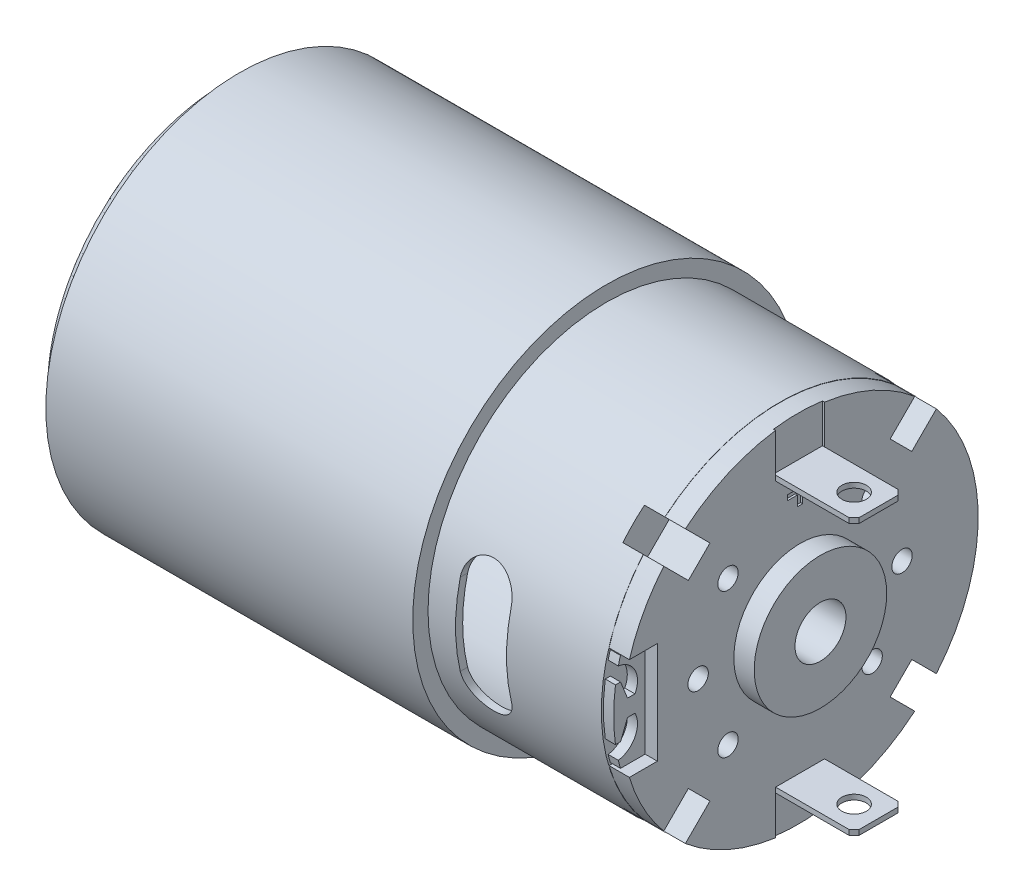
ISO-10303-21;
HEADER;
FILE_DESCRIPTION(('STEP AP214'),'2;1');
FILE_NAME('part.step','',(''),(''),'','','');
FILE_SCHEMA(('AUTOMOTIVE_DESIGN { 1 0 10303 214 1 1 1 1 }'));
ENDSEC;
DATA;
#1=APPLICATION_CONTEXT('core data for automotive mechanical design processes');
#2=APPLICATION_PROTOCOL_DEFINITION('international standard','automotive_design',2000,#1);
#3=PRODUCT_CONTEXT('',#1,'mechanical');
#4=PRODUCT('Part','Part','',(#3));
#5=PRODUCT_RELATED_PRODUCT_CATEGORY('part','',(#4));
#6=PRODUCT_DEFINITION_FORMATION('','',#4);
#7=PRODUCT_DEFINITION_CONTEXT('part definition',#1,'design');
#8=PRODUCT_DEFINITION('design','',#6,#7);
#9=PRODUCT_DEFINITION_SHAPE('','',#8);
#10=(LENGTH_UNIT() NAMED_UNIT(*) SI_UNIT(.MILLI.,.METRE.));
#11=(NAMED_UNIT(*) PLANE_ANGLE_UNIT() SI_UNIT($,.RADIAN.));
#12=(NAMED_UNIT(*) SI_UNIT($,.STERADIAN.) SOLID_ANGLE_UNIT());
#13=UNCERTAINTY_MEASURE_WITH_UNIT(LENGTH_MEASURE(1.E-05),#10,'distance_accuracy_value','');
#14=(GEOMETRIC_REPRESENTATION_CONTEXT(3) GLOBAL_UNCERTAINTY_ASSIGNED_CONTEXT((#13)) GLOBAL_UNIT_ASSIGNED_CONTEXT((#10,
#11,#12)) REPRESENTATION_CONTEXT('',''));
#15=CARTESIAN_POINT('',(0.,0.,0.));
#16=DIRECTION('',(0.,0.,1.));
#17=DIRECTION('',(1.,0.,0.));
#18=AXIS2_PLACEMENT_3D('',#15,#16,#17);
#19=CARTESIAN_POINT('',(51.7,-7.071067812,7.071067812));
#20=DIRECTION('',(-1.,0.,0.));
#21=DIRECTION('',(0.,-1.,0.));
#22=AXIS2_PLACEMENT_3D('',#19,#20,#21);
#23=CYLINDRICAL_SURFACE('',#22,1.);
#24=CARTESIAN_POINT('',(72.3,-7.07106781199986,7.071067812));
#25=DIRECTION('',(-1.,0.,0.));
#26=DIRECTION('',(0.,-1.,0.));
#27=AXIS2_PLACEMENT_3D('',#24,#25,#26);
#28=CIRCLE('',#27,1.);
#29=CARTESIAN_POINT('',(72.3,-8.07106781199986,7.071067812));
#30=VERTEX_POINT('',#29);
#31=EDGE_CURVE('E636',#30,#30,#28,.F.);
#32=ORIENTED_EDGE('',*,*,#31,.T.);
#33=EDGE_LOOP('',(#32));
#34=FACE_BOUND('',#33,.T.);
#35=CARTESIAN_POINT('',(67.3,-7.07106781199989,7.071067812));
#36=DIRECTION('',(-1.,0.,0.));
#37=DIRECTION('',(0.,0.,1.));
#38=AXIS2_PLACEMENT_3D('',#35,#36,#37);
#39=CIRCLE('',#38,1.);
#40=CARTESIAN_POINT('',(67.3,-7.07106781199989,8.071067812));
#41=VERTEX_POINT('',#40);
#42=EDGE_CURVE('E746',#41,#41,#39,.F.);
#43=ORIENTED_EDGE('',*,*,#42,.F.);
#44=EDGE_LOOP('',(#43));
#45=FACE_BOUND('',#44,.T.);
#46=ADVANCED_FACE('F40',(#34,#45),#23,.F.);
#47=CARTESIAN_POINT('',(51.7,-7.071067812,-7.071067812));
#48=DIRECTION('',(-1.,0.,0.));
#49=DIRECTION('',(0.,0.,1.));
#50=AXIS2_PLACEMENT_3D('',#47,#48,#49);
#51=CYLINDRICAL_SURFACE('',#50,1.);
#52=CARTESIAN_POINT('',(72.3,-7.071067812,-7.071067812));
#53=DIRECTION('',(-1.,0.,0.));
#54=DIRECTION('',(0.,0.,1.));
#55=AXIS2_PLACEMENT_3D('',#52,#53,#54);
#56=CIRCLE('',#55,1.);
#57=CARTESIAN_POINT('',(72.3,-7.071067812,-6.071067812));
#58=VERTEX_POINT('',#57);
#59=EDGE_CURVE('E640',#58,#58,#56,.F.);
#60=ORIENTED_EDGE('',*,*,#59,.T.);
#61=EDGE_LOOP('',(#60));
#62=FACE_BOUND('',#61,.T.);
#63=CARTESIAN_POINT('',(67.3,-7.071067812,-7.071067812));
#64=DIRECTION('',(-1.,0.,0.));
#65=DIRECTION('',(0.,0.,1.));
#66=AXIS2_PLACEMENT_3D('',#63,#64,#65);
#67=CIRCLE('',#66,1.);
#68=CARTESIAN_POINT('',(67.3,-7.071067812,-6.071067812));
#69=VERTEX_POINT('',#68);
#70=EDGE_CURVE('E2015',#69,#69,#67,.F.);
#71=ORIENTED_EDGE('',*,*,#70,.F.);
#72=EDGE_LOOP('',(#71));
#73=FACE_BOUND('',#72,.T.);
#74=ADVANCED_FACE('F1062',(#62,#73),#51,.F.);
#75=CARTESIAN_POINT('',(51.7,7.071067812,7.071067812));
#76=DIRECTION('',(-1.,0.,0.));
#77=DIRECTION('',(0.,-1.,0.));
#78=AXIS2_PLACEMENT_3D('',#75,#76,#77);
#79=CYLINDRICAL_SURFACE('',#78,0.999999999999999);
#80=CARTESIAN_POINT('',(72.3,7.07106781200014,7.071067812));
#81=DIRECTION('',(-1.,0.,0.));
#82=DIRECTION('',(0.,-1.,0.));
#83=AXIS2_PLACEMENT_3D('',#80,#81,#82);
#84=CIRCLE('',#83,0.999999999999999);
#85=CARTESIAN_POINT('',(72.3,6.07106781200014,7.071067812));
#86=VERTEX_POINT('',#85);
#87=EDGE_CURVE('E630',#86,#86,#84,.T.);
#88=ORIENTED_EDGE('',*,*,#87,.F.);
#89=EDGE_LOOP('',(#88));
#90=FACE_BOUND('',#89,.T.);
#91=CARTESIAN_POINT('',(67.3,7.07106781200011,7.071067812));
#92=DIRECTION('',(-1.,0.,0.));
#93=DIRECTION('',(0.,0.,1.));
#94=AXIS2_PLACEMENT_3D('',#91,#92,#93);
#95=CIRCLE('',#94,0.999999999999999);
#96=CARTESIAN_POINT('',(67.3,7.07106781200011,8.071067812));
#97=VERTEX_POINT('',#96);
#98=EDGE_CURVE('E2011',#97,#97,#95,.F.);
#99=ORIENTED_EDGE('',*,*,#98,.F.);
#100=EDGE_LOOP('',(#99));
#101=FACE_BOUND('',#100,.T.);
#102=ADVANCED_FACE('F1058',(#90,#101),#79,.F.);
#103=CARTESIAN_POINT('',(51.7,7.071067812,-7.071067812));
#104=DIRECTION('',(-1.,0.,0.));
#105=DIRECTION('',(0.,0.,1.));
#106=AXIS2_PLACEMENT_3D('',#103,#104,#105);
#107=CYLINDRICAL_SURFACE('',#106,1.);
#108=CARTESIAN_POINT('',(72.3,7.071067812,-7.071067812));
#109=DIRECTION('',(-1.,0.,0.));
#110=DIRECTION('',(0.,0.,1.));
#111=AXIS2_PLACEMENT_3D('',#108,#109,#110);
#112=CIRCLE('',#111,1.);
#113=CARTESIAN_POINT('',(72.3,7.071067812,-6.071067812));
#114=VERTEX_POINT('',#113);
#115=EDGE_CURVE('E627',#114,#114,#112,.T.);
#116=ORIENTED_EDGE('',*,*,#115,.F.);
#117=EDGE_LOOP('',(#116));
#118=FACE_BOUND('',#117,.T.);
#119=CARTESIAN_POINT('',(67.3,7.071067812,-7.071067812));
#120=DIRECTION('',(-1.,0.,0.));
#121=DIRECTION('',(0.,0.,1.));
#122=AXIS2_PLACEMENT_3D('',#119,#120,#121);
#123=CIRCLE('',#122,1.);
#124=CARTESIAN_POINT('',(67.3,7.071067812,-6.071067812));
#125=VERTEX_POINT('',#124);
#126=EDGE_CURVE('E2009',#125,#125,#123,.F.);
#127=ORIENTED_EDGE('',*,*,#126,.F.);
#128=EDGE_LOOP('',(#127));
#129=FACE_BOUND('',#128,.T.);
#130=ADVANCED_FACE('F1054',(#118,#129),#107,.F.);
#131=CARTESIAN_POINT('',(56.,4.,-17.71));
#132=DIRECTION('',(-1.,0.,0.));
#133=DIRECTION('',(0.,0.,1.));
#134=AXIS2_PLACEMENT_3D('',#131,#132,#133);
#135=PLANE('',#134);
#136=DIRECTION('',(0.,0.,1.));
#137=VECTOR('',#136,1.);
#138=CARTESIAN_POINT('',(56.,3.99999999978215,-17.71));
#139=LINE('',#138,#137);
#140=CARTESIAN_POINT('',(55.99999999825,3.99999999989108,-17.0367250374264));
#141=VERTEX_POINT('',#140);
#142=CARTESIAN_POINT('',(56.,3.99999999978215,-16.3168624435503));
#143=VERTEX_POINT('',#142);
#144=EDGE_CURVE('E572',#141,#143,#139,.T.);
#145=ORIENTED_EDGE('',*,*,#144,.T.);
#146=CARTESIAN_POINT('',(56.,0.,0.));
#147=DIRECTION('',(-1.,0.,0.));
#148=DIRECTION('',(0.,0.,1.));
#149=AXIS2_PLACEMENT_3D('',#146,#147,#148);
#150=CIRCLE('',#149,16.8);
#151=CARTESIAN_POINT('',(56.,-4.00000000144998,-16.3168624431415));
#152=VERTEX_POINT('',#151);
#153=EDGE_CURVE('E65',#143,#152,#150,.T.);
#154=ORIENTED_EDGE('',*,*,#153,.T.);
#155=DIRECTION('',(0.,0.,1.));
#156=VECTOR('',#155,1.);
#157=CARTESIAN_POINT('',(56.,-4.00000000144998,-17.71));
#158=LINE('',#157,#156);
#159=CARTESIAN_POINT('',(55.9999999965,-4.00000000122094,-17.0367250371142));
#160=VERTEX_POINT('',#159);
#161=EDGE_CURVE('E573',#160,#152,#158,.T.);
#162=ORIENTED_EDGE('',*,*,#161,.F.);
#163=CARTESIAN_POINT('',(55.9999999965,0.,0.));
#164=DIRECTION('',(1.,0.,0.));
#165=DIRECTION('',(0.,0.,-1.));
#166=AXIS2_PLACEMENT_3D('',#163,#164,#165);
#167=CIRCLE('',#166,17.5);
#168=EDGE_CURVE('E957',#141,#160,#167,.F.);
#169=ORIENTED_EDGE('',*,*,#168,.F.);
#170=EDGE_LOOP('',(#145,#154,#162,#169));
#171=FACE_BOUND('',#170,.T.);
#172=ADVANCED_FACE('F1057',(#171),#135,.F.);
#173=CARTESIAN_POINT('',(61.,-4.,17.71));
#174=DIRECTION('',(1.,0.,0.));
#175=DIRECTION('',(0.,0.,-1.));
#176=AXIS2_PLACEMENT_3D('',#173,#174,#175);
#177=PLANE('',#176);
#178=DIRECTION('',(0.,0.,-1.));
#179=VECTOR('',#178,1.);
#180=CARTESIAN_POINT('',(61.,4.00000000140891,17.71));
#181=LINE('',#180,#179);
#182=CARTESIAN_POINT('',(61.,4.00000000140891,16.3168624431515));
#183=VERTEX_POINT('',#182);
#184=CARTESIAN_POINT('',(60.999999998,4.00000000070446,17.0367250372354));
#185=VERTEX_POINT('',#184);
#186=EDGE_CURVE('E576',#183,#185,#181,.F.);
#187=ORIENTED_EDGE('',*,*,#186,.F.);
#188=CARTESIAN_POINT('',(61.,0.,0.));
#189=DIRECTION('',(1.,0.,0.));
#190=DIRECTION('',(0.,0.,-1.));
#191=AXIS2_PLACEMENT_3D('',#188,#189,#190);
#192=CIRCLE('',#191,16.8);
#193=CARTESIAN_POINT('',(61.,-4.00000000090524,16.316862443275));
#194=VERTEX_POINT('',#193);
#195=EDGE_CURVE('E57',#183,#194,#192,.T.);
#196=ORIENTED_EDGE('',*,*,#195,.T.);
#197=DIRECTION('',(0.,0.,-1.));
#198=VECTOR('',#197,1.);
#199=CARTESIAN_POINT('',(61.,-4.00000000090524,17.71));
#200=LINE('',#199,#198);
#201=CARTESIAN_POINT('',(60.999999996,-4.00000000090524,17.0367250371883));
#202=VERTEX_POINT('',#201);
#203=EDGE_CURVE('E2068',#202,#194,#200,.T.);
#204=ORIENTED_EDGE('',*,*,#203,.F.);
#205=CARTESIAN_POINT('',(60.999999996,0.,0.));
#206=DIRECTION('',(1.,0.,0.));
#207=DIRECTION('',(0.,0.,-1.));
#208=AXIS2_PLACEMENT_3D('',#205,#206,#207);
#209=CIRCLE('',#208,17.5);
#210=EDGE_CURVE('E2061',#185,#202,#209,.T.);
#211=ORIENTED_EDGE('',*,*,#210,.F.);
#212=EDGE_LOOP('',(#187,#196,#204,#211));
#213=FACE_BOUND('',#212,.T.);
#214=ADVANCED_FACE('F1338',(#213),#177,.F.);
#215=CARTESIAN_POINT('',(74.3,0.,0.));
#216=DIRECTION('',(1.,0.,0.));
#217=DIRECTION('',(0.,0.,-1.));
#218=AXIS2_PLACEMENT_3D('',#215,#216,#217);
#219=CYLINDRICAL_SURFACE('',#218,2.5);
#220=CARTESIAN_POINT('',(74.3,0.,0.));
#221=DIRECTION('',(1.,0.,0.));
#222=DIRECTION('',(0.,0.,-1.));
#223=AXIS2_PLACEMENT_3D('',#220,#221,#222);
#224=CIRCLE('',#223,2.5);
#225=CARTESIAN_POINT('',(74.3,0.,-2.5));
#226=VERTEX_POINT('',#225);
#227=EDGE_CURVE('E719',#226,#226,#224,.T.);
#228=ORIENTED_EDGE('',*,*,#227,.T.);
#229=EDGE_LOOP('',(#228));
#230=FACE_BOUND('',#229,.T.);
#231=CARTESIAN_POINT('',(67.3,0.,0.));
#232=DIRECTION('',(-1.,0.,0.));
#233=DIRECTION('',(0.,0.,1.));
#234=AXIS2_PLACEMENT_3D('',#231,#232,#233);
#235=CIRCLE('',#234,2.5);
#236=CARTESIAN_POINT('',(67.3,0.,2.5));
#237=VERTEX_POINT('',#236);
#238=EDGE_CURVE('E2012',#237,#237,#235,.F.);
#239=ORIENTED_EDGE('',*,*,#238,.F.);
#240=EDGE_LOOP('',(#239));
#241=FACE_BOUND('',#240,.T.);
#242=ADVANCED_FACE('F42',(#230,#241),#219,.F.);
#243=CARTESIAN_POINT('',(61.,0.,-10.));
#244=DIRECTION('',(-1.,0.,0.));
#245=DIRECTION('',(0.,0.,1.));
#246=AXIS2_PLACEMENT_3D('',#243,#244,#245);
#247=CYLINDRICAL_SURFACE('',#246,0.999999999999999);
#248=CARTESIAN_POINT('',(72.3,0.,-10.));
#249=DIRECTION('',(-1.,0.,0.));
#250=DIRECTION('',(0.,0.,1.));
#251=AXIS2_PLACEMENT_3D('',#248,#249,#250);
#252=CIRCLE('',#251,0.999999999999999);
#253=CARTESIAN_POINT('',(72.3,0.,-9.));
#254=VERTEX_POINT('',#253);
#255=EDGE_CURVE('E624',#254,#254,#252,.T.);
#256=ORIENTED_EDGE('',*,*,#255,.F.);
#257=EDGE_LOOP('',(#256));
#258=FACE_BOUND('',#257,.T.);
#259=CARTESIAN_POINT('',(67.3,0.,-10.));
#260=DIRECTION('',(-1.,0.,0.));
#261=DIRECTION('',(0.,0.,1.));
#262=AXIS2_PLACEMENT_3D('',#259,#260,#261);
#263=CIRCLE('',#262,0.999999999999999);
#264=CARTESIAN_POINT('',(67.3,0.,-9.));
#265=VERTEX_POINT('',#264);
#266=EDGE_CURVE('E2018',#265,#265,#263,.F.);
#267=ORIENTED_EDGE('',*,*,#266,.F.);
#268=EDGE_LOOP('',(#267));
#269=FACE_BOUND('',#268,.T.);
#270=ADVANCED_FACE('F1049',(#258,#269),#247,.F.);
#271=CARTESIAN_POINT('',(61.,0.,10.));
#272=DIRECTION('',(-1.,0.,0.));
#273=DIRECTION('',(0.,0.,1.));
#274=AXIS2_PLACEMENT_3D('',#271,#272,#273);
#275=CYLINDRICAL_SURFACE('',#274,0.999999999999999);
#276=CARTESIAN_POINT('',(72.3,0.,10.));
#277=DIRECTION('',(-1.,0.,0.));
#278=DIRECTION('',(0.,0.,1.));
#279=AXIS2_PLACEMENT_3D('',#276,#277,#278);
#280=CIRCLE('',#279,0.999999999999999);
#281=CARTESIAN_POINT('',(72.3,0.,11.));
#282=VERTEX_POINT('',#281);
#283=EDGE_CURVE('E620',#282,#282,#280,.T.);
#284=ORIENTED_EDGE('',*,*,#283,.F.);
#285=EDGE_LOOP('',(#284));
#286=FACE_BOUND('',#285,.T.);
#287=CARTESIAN_POINT('',(67.3,0.,10.));
#288=DIRECTION('',(-1.,0.,0.));
#289=DIRECTION('',(0.,0.,1.));
#290=AXIS2_PLACEMENT_3D('',#287,#288,#289);
#291=CIRCLE('',#290,0.999999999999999);
#292=CARTESIAN_POINT('',(67.3,0.,11.));
#293=VERTEX_POINT('',#292);
#294=EDGE_CURVE('E44',#293,#293,#291,.F.);
#295=ORIENTED_EDGE('',*,*,#294,.F.);
#296=EDGE_LOOP('',(#295));
#297=FACE_BOUND('',#296,.T.);
#298=ADVANCED_FACE('F1046',(#286,#297),#275,.F.);
#299=CARTESIAN_POINT('',(58.5,-4.,-17.241165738));
#300=DIRECTION('',(0.,0.,-1.));
#301=DIRECTION('',(-1.,0.,0.));
#302=AXIS2_PLACEMENT_3D('',#299,#300,#301);
#303=CYLINDRICAL_SURFACE('',#302,2.5);
#304=ORIENTED_EDGE('',*,*,#161,.T.);
#305=CARTESIAN_POINT('',(56.,-4.00000000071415,-16.3168624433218));
#306=CARTESIAN_POINT('',(56.0000011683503,-4.0731232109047,-16.2989395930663));
#307=CARTESIAN_POINT('',(56.0032097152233,-4.14608473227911,-16.2805287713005));
#308=CARTESIAN_POINT('',(56.0159507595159,-4.29122250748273,-16.2428758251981));
#309=CARTESIAN_POINT('',(56.0254820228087,-4.36339891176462,-16.2236338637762));
#310=CARTESIAN_POINT('',(56.0633792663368,-4.57783834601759,-16.1649391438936));
#311=CARTESIAN_POINT('',(56.1010494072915,-4.71828289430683,-16.1244508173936));
#312=CARTESIAN_POINT('',(56.1998864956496,-4.99016569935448,-16.0423958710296));
#313=CARTESIAN_POINT('',(56.2610478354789,-5.12160609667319,-16.000829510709));
#314=CARTESIAN_POINT('',(56.4052551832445,-5.37220032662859,-15.9184440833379));
#315=CARTESIAN_POINT('',(56.4883047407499,-5.49135216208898,-15.8776251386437));
#316=CARTESIAN_POINT('',(56.6752149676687,-5.71511332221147,-15.7984720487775));
#317=CARTESIAN_POINT('',(56.7792652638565,-5.81957424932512,-15.7601650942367));
#318=CARTESIAN_POINT('',(57.0051967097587,-6.00930485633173,-15.6888033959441));
#319=CARTESIAN_POINT('',(57.1270752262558,-6.09457736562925,-15.6557478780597));
#320=CARTESIAN_POINT('',(57.3804874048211,-6.23991090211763,-15.5983783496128));
#321=CARTESIAN_POINT('',(57.5114726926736,-6.30081224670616,-15.5737780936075));
#322=CARTESIAN_POINT('',(57.7831878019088,-6.39938106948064,-15.5335376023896));
#323=CARTESIAN_POINT('',(57.923911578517,-6.43706281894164,-15.5178918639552));
#324=CARTESIAN_POINT('',(58.2001844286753,-6.48562951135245,-15.4976530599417));
#325=CARTESIAN_POINT('',(58.3353782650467,-6.49824607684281,-15.4923462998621));
#326=CARTESIAN_POINT('',(58.606055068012,-6.50141090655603,-15.4910188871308));
#327=CARTESIAN_POINT('',(58.7415379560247,-6.49196455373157,-15.4949959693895));
#328=CARTESIAN_POINT('',(59.0032828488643,-6.45225124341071,-15.5115723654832));
#329=CARTESIAN_POINT('',(59.1296971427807,-6.42282916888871,-15.5238216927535));
#330=CARTESIAN_POINT('',(59.375614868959,-6.34519303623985,-15.5557151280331));
#331=CARTESIAN_POINT('',(59.4951175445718,-6.29697692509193,-15.5753600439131));
#332=CARTESIAN_POINT('',(59.7276532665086,-6.18178444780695,-15.6214429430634));
#333=CARTESIAN_POINT('',(59.8404045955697,-6.11431225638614,-15.6480586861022));
#334=CARTESIAN_POINT('',(60.0531669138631,-5.96333950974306,-15.7062125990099));
#335=CARTESIAN_POINT('',(60.1531747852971,-5.87983504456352,-15.7377519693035));
#336=CARTESIAN_POINT('',(60.3448435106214,-5.69283141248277,-15.8063985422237));
#337=CARTESIAN_POINT('',(60.4354695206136,-5.58835684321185,-15.8437387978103));
#338=CARTESIAN_POINT('',(60.598108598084,-5.36634239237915,-15.9203063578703));
#339=CARTESIAN_POINT('',(60.6701096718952,-5.24879416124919,-15.9595348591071));
#340=CARTESIAN_POINT('',(60.7972188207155,-4.99687548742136,-16.0402510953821));
#341=CARTESIAN_POINT('',(60.8512004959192,-4.86193871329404,-16.0817460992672));
#342=CARTESIAN_POINT('',(60.9350358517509,-4.58441594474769,-16.1630423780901));
#343=CARTESIAN_POINT('',(60.9649274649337,-4.44184235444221,-16.2028462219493));
#344=CARTESIAN_POINT('',(60.9881443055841,-4.24822436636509,-16.2540832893));
#345=CARTESIAN_POINT('',(60.9925872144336,-4.19871783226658,-16.2669420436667));
#346=CARTESIAN_POINT('',(60.9985114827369,-4.09949990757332,-16.2922284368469));
#347=CARTESIAN_POINT('',(60.9999973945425,-4.04978895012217,-16.3046567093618));
#348=CARTESIAN_POINT('',(61.,-4.00000000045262,-16.316862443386));
#349=B_SPLINE_CURVE_WITH_KNOTS('',3,(#305,#306,#307,#308,#309,#310,#311,#312,#313,#314,#315,
#316,#317,#318,#319,#320,#321,#322,#323,#324,#325,#326,#327,#328,#329,#330,#331,#332,#333,#334,
#335,#336,#337,#338,#339,#340,#341,#342,#343,#344,#345,#346,#347,#348),.UNSPECIFIED.,.F.,.F.,(4,
2,2,2,2,2,2,2,2,2,2,2,2,2,2,2,2,2,2,2,2,4),(0.,0.225714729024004,0.451385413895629,
0.901899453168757,1.35230601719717,1.80278566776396,2.25753120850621,2.71220965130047,
3.14947870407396,3.58647873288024,3.99206393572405,4.39755019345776,4.78687442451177,
5.17624119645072,5.57671274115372,5.9772820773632,6.40517783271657,6.83334845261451,
7.28471354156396,7.73536650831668,7.88932652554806,8.0430493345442),.UNSPECIFIED.);
#350=CARTESIAN_POINT('',(61.,-4.00000000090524,-16.316862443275));
#351=VERTEX_POINT('',#350);
#352=EDGE_CURVE('E926',#152,#351,#349,.T.);
#353=ORIENTED_EDGE('',*,*,#352,.T.);
#354=CARTESIAN_POINT('',(60.999999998,-4.00000000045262,-17.0367250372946));
#355=VERTEX_POINT('',#354);
#356=EDGE_CURVE('E2065',#351,#355,#200,.T.);
#357=ORIENTED_EDGE('',*,*,#356,.T.);
#358=CARTESIAN_POINT('',(55.9999999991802,-4.00000000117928,-17.036725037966));
#359=CARTESIAN_POINT('',(56.0000011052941,-4.07289462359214,-17.0196131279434));
#360=CARTESIAN_POINT('',(56.0031897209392,-4.14563887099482,-17.0020367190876));
#361=CARTESIAN_POINT('',(56.0158566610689,-4.29036692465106,-16.9660925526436));
#362=CARTESIAN_POINT('',(56.0253338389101,-4.36235086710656,-16.9477249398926));
#363=CARTESIAN_POINT('',(56.063026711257,-4.57625547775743,-16.8916994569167));
#364=CARTESIAN_POINT('',(56.1005043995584,-4.71639489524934,-16.8530562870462));
#365=CARTESIAN_POINT('',(56.1988744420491,-4.98776493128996,-16.774748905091));
#366=CARTESIAN_POINT('',(56.2597626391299,-5.1189971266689,-16.735084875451));
#367=CARTESIAN_POINT('',(56.4033384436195,-5.36923674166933,-16.6564851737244));
#368=CARTESIAN_POINT('',(56.4860287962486,-5.48824261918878,-16.6175495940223));
#369=CARTESIAN_POINT('',(56.6720165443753,-5.7116614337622,-16.5420968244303));
#370=CARTESIAN_POINT('',(56.7754831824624,-5.81594168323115,-16.5056030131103));
#371=CARTESIAN_POINT('',(57.0000675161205,-6.0054359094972,-16.4376061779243));
#372=CARTESIAN_POINT('',(57.1211830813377,-6.09065218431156,-16.4061025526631));
#373=CARTESIAN_POINT('',(57.3733275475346,-6.23630403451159,-16.3512806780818));
#374=CARTESIAN_POINT('',(57.503859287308,-6.29750441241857,-16.3277139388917));
#375=CARTESIAN_POINT('',(57.7746047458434,-6.39678083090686,-16.2890780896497));
#376=CARTESIAN_POINT('',(57.9148130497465,-6.4348696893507,-16.2740042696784));
#377=CARTESIAN_POINT('',(58.1909848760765,-6.48452988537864,-16.2542775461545));
#378=CARTESIAN_POINT('',(58.3266213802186,-6.49768006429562,-16.2490046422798));
#379=CARTESIAN_POINT('',(58.5982678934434,-6.50175574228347,-16.247374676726));
#380=CARTESIAN_POINT('',(58.7342778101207,-6.49268631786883,-16.2510155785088));
#381=CARTESIAN_POINT('',(58.9975412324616,-6.45347027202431,-16.2666262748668));
#382=CARTESIAN_POINT('',(59.1249326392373,-6.42411405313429,-16.2782836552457));
#383=CARTESIAN_POINT('',(59.372813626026,-6.34629013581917,-16.308780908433));
#384=CARTESIAN_POINT('',(59.4933025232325,-6.29782055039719,-16.3276214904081));
#385=CARTESIAN_POINT('',(59.7274356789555,-6.18194874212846,-16.3718488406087));
#386=CARTESIAN_POINT('',(59.8408256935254,-6.11409353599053,-16.3973908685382));
#387=CARTESIAN_POINT('',(60.0547797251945,-5.96211417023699,-16.4532591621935));
#388=CARTESIAN_POINT('',(60.1553408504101,-5.87798635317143,-16.4835865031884));
#389=CARTESIAN_POINT('',(60.3474482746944,-5.69000107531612,-16.5494530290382));
#390=CARTESIAN_POINT('',(60.4380389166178,-5.58523938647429,-16.5851994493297));
#391=CARTESIAN_POINT('',(60.6005490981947,-5.36260844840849,-16.658516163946));
#392=CARTESIAN_POINT('',(60.6724570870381,-5.2447311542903,-16.6960875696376));
#393=CARTESIAN_POINT('',(60.7990150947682,-4.99267453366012,-16.7732351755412));
#394=CARTESIAN_POINT('',(60.8526264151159,-4.85797553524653,-16.812817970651));
#395=CARTESIAN_POINT('',(60.9358211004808,-4.58104168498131,-16.8903711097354));
#396=CARTESIAN_POINT('',(60.9654420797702,-4.43881900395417,-16.9283438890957));
#397=CARTESIAN_POINT('',(60.9883537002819,-4.24603028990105,-16.9771552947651));
#398=CARTESIAN_POINT('',(60.9927186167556,-4.19695245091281,-16.9893544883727));
#399=CARTESIAN_POINT('',(60.9985382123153,-4.09860683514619,-17.0133468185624));
#400=CARTESIAN_POINT('',(60.9999974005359,-4.04933947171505,-17.025140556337));
#401=CARTESIAN_POINT('',(61.,-4.00000000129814,-17.036725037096));
#402=B_SPLINE_CURVE_WITH_KNOTS('',3,(#358,#359,#360,#361,#362,#363,#364,#365,#366,#367,#368,
#369,#370,#371,#372,#373,#374,#375,#376,#377,#378,#379,#380,#381,#382,#383,#384,#385,#386,#387,
#388,#389,#390,#391,#392,#393,#394,#395,#396,#397,#398,#399,#400,#401),.UNSPECIFIED.,.F.,.F.,(4,
2,2,2,2,2,2,2,2,2,2,2,2,2,2,2,2,2,2,2,2,4),(0.,0.224481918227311,0.448922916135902,
0.896995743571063,1.34498904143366,1.79303877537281,2.24489826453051,2.69670325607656,
3.13265019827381,3.56835513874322,3.97541298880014,4.38237784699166,4.7743199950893,
5.16630084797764,5.5683181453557,5.97042590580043,6.39765447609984,6.82514656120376,
7.27394380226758,7.72203600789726,7.87425038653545,8.02622837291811),.UNSPECIFIED.);
#403=EDGE_CURVE('E992',#160,#355,#402,.T.);
#404=ORIENTED_EDGE('',*,*,#403,.F.);
#405=EDGE_LOOP('',(#304,#353,#357,#404));
#406=FACE_BOUND('',#405,.T.);
#407=ADVANCED_FACE('F1013',(#406),#303,.F.);
#408=CARTESIAN_POINT('',(58.5,4.,-17.241165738));
#409=DIRECTION('',(0.,0.,-1.));
#410=DIRECTION('',(-1.,0.,0.));
#411=AXIS2_PLACEMENT_3D('',#408,#409,#410);
#412=CYLINDRICAL_SURFACE('',#411,2.5);
#413=CARTESIAN_POINT('',(60.999999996,4.00000000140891,-17.03672503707));
#414=VERTEX_POINT('',#413);
#415=CARTESIAN_POINT('',(61.,4.00000000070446,-16.3168624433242));
#416=VERTEX_POINT('',#415);
#417=EDGE_CURVE('E2062',#414,#416,#181,.F.);
#418=ORIENTED_EDGE('',*,*,#417,.T.);
#419=CARTESIAN_POINT('',(61.,4.00000000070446,-16.3168624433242));
#420=CARTESIAN_POINT('',(60.99999883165,4.073123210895,-16.2989395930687));
#421=CARTESIAN_POINT('',(60.9967902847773,4.14608473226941,-16.280528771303));
#422=CARTESIAN_POINT('',(60.9840492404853,4.29122250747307,-16.2428758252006));
#423=CARTESIAN_POINT('',(60.9745179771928,4.36339891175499,-16.2236338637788));
#424=CARTESIAN_POINT('',(60.9366207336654,4.57783834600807,-16.1649391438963));
#425=CARTESIAN_POINT('',(60.8989505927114,4.71828289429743,-16.1244508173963));
#426=CARTESIAN_POINT('',(60.8001135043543,4.99016569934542,-16.0423958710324));
#427=CARTESIAN_POINT('',(60.7389521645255,5.12160609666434,-16.0008295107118));
#428=CARTESIAN_POINT('',(60.594744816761,5.37220032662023,-15.9184440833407));
#429=CARTESIAN_POINT('',(60.5116952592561,5.49135216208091,-15.8776251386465));
#430=CARTESIAN_POINT('',(60.3247850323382,5.71511332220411,-15.7984720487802));
#431=CARTESIAN_POINT('',(60.2207347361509,5.81957424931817,-15.7601650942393));
#432=CARTESIAN_POINT('',(59.9948032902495,6.00930485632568,-15.6888033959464));
#433=CARTESIAN_POINT('',(59.8729247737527,6.09457736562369,-15.6557478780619));
#434=CARTESIAN_POINT('',(59.6195125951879,6.23991090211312,-15.5983783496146));
#435=CARTESIAN_POINT('',(59.4885273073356,6.30081224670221,-15.5737780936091));
#436=CARTESIAN_POINT('',(59.2168121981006,6.39938106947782,-15.5335376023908));
#437=CARTESIAN_POINT('',(59.0760884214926,6.4370628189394,-15.5178918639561));
#438=CARTESIAN_POINT('',(58.7998155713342,6.48562951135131,-15.4976530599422));
#439=CARTESIAN_POINT('',(58.6646217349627,6.49824607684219,-15.4923462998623));
#440=CARTESIAN_POINT('',(58.3939449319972,6.50141090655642,-15.4910188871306));
#441=CARTESIAN_POINT('',(58.2584620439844,6.49196455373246,-15.4949959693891));
#442=CARTESIAN_POINT('',(57.9967171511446,6.45225124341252,-15.5115723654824));
#443=CARTESIAN_POINT('',(57.870302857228,6.42282916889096,-15.5238216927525));
#444=CARTESIAN_POINT('',(57.6243851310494,6.34519303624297,-15.5557151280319));
#445=CARTESIAN_POINT('',(57.5048824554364,6.29697692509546,-15.5753600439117));
#446=CARTESIAN_POINT('',(57.2723467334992,6.18178444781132,-15.6214429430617));
#447=CARTESIAN_POINT('',(57.159595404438,6.11431225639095,-15.6480586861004));
#448=CARTESIAN_POINT('',(56.9468330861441,5.9633395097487,-15.7062125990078));
#449=CARTESIAN_POINT('',(56.8468252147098,5.87983504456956,-15.7377519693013));
#450=CARTESIAN_POINT('',(56.6551564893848,5.69283141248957,-15.8063985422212));
#451=CARTESIAN_POINT('',(56.5645304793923,5.58835684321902,-15.8437387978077));
#452=CARTESIAN_POINT('',(56.4018914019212,5.36634239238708,-15.9203063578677));
#453=CARTESIAN_POINT('',(56.3298903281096,5.24879416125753,-15.9595348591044));
#454=CARTESIAN_POINT('',(56.2027811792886,4.99687548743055,-16.0402510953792));
#455=CARTESIAN_POINT('',(56.1487995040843,4.86193871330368,-16.0817460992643));
#456=CARTESIAN_POINT('',(56.0649641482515,4.58441594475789,-16.1630423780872));
#457=CARTESIAN_POINT('',(56.0350725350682,4.4418423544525,-16.2028462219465));
#458=CARTESIAN_POINT('',(56.0118556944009,4.24822436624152,-16.2540832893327));
#459=CARTESIAN_POINT('',(56.0074127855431,4.19871783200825,-16.2669420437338));
#460=CARTESIAN_POINT('',(56.0014885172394,4.09949990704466,-16.2922284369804));
#461=CARTESIAN_POINT('',(56.0000026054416,4.04978894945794,-16.3046567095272));
#462=CARTESIAN_POINT('',(56.,3.99999999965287,-16.316862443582));
#463=B_SPLINE_CURVE_WITH_KNOTS('',3,(#419,#420,#421,#422,#423,#424,#425,#426,#427,#428,#429,
#430,#431,#432,#433,#434,#435,#436,#437,#438,#439,#440,#441,#442,#443,#444,#445,#446,#447,#448,
#449,#450,#451,#452,#453,#454,#455,#456,#457,#458,#459,#460,#461,#462),.UNSPECIFIED.,.F.,.F.,(4,
2,2,2,2,2,2,2,2,2,2,2,2,2,2,2,2,2,2,2,2,4),(0.,0.225714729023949,0.451385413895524,
0.901899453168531,1.35230601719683,1.80278566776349,2.2575312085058,2.7122096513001,
3.14947870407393,3.58647873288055,3.99206393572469,4.39755019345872,4.78687442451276,
5.17624119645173,5.57671274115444,5.9772820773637,6.40517783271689,6.83334845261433,
7.28471354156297,7.73536650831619,7.88932652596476,8.04304933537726),.UNSPECIFIED.);
#464=EDGE_CURVE('E920',#416,#143,#463,.T.);
#465=ORIENTED_EDGE('',*,*,#464,.T.);
#466=ORIENTED_EDGE('',*,*,#144,.F.);
#467=CARTESIAN_POINT('',(61.,4.00000000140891,-17.03672503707));
#468=CARTESIAN_POINT('',(60.9999988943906,4.07289462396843,-17.0196131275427));
#469=CARTESIAN_POINT('',(60.9968102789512,4.14563887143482,-17.0020367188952));
#470=CARTESIAN_POINT('',(60.9841433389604,4.29036692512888,-16.9660925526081));
#471=CARTESIAN_POINT('',(60.9746661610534,4.36235086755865,-16.947724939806));
#472=CARTESIAN_POINT('',(60.9369732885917,4.57625547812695,-16.8916994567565));
#473=CARTESIAN_POINT('',(60.8994956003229,4.71639489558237,-16.8530562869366));
#474=CARTESIAN_POINT('',(60.8011255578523,4.98776493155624,-16.7747489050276));
#475=CARTESIAN_POINT('',(60.740237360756,5.11899712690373,-16.7350848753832));
#476=CARTESIAN_POINT('',(60.5966615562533,5.36923674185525,-16.65648517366));
#477=CARTESIAN_POINT('',(60.5139712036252,5.48824261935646,-16.6175495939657));
#478=CARTESIAN_POINT('',(60.327983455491,5.71166143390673,-16.5420968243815));
#479=CARTESIAN_POINT('',(60.2245168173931,5.81594168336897,-16.505603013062));
#480=CARTESIAN_POINT('',(59.9999324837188,6.00543590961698,-16.4376061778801));
#481=CARTESIAN_POINT('',(59.8788169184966,6.0906521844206,-16.4061025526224));
#482=CARTESIAN_POINT('',(59.6266724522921,6.23630403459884,-16.3512806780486));
#483=CARTESIAN_POINT('',(59.4961407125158,6.29750441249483,-16.3277139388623));
#484=CARTESIAN_POINT('',(59.2253952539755,6.3967808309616,-16.2890780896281));
#485=CARTESIAN_POINT('',(59.0851869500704,6.43486968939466,-16.274004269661));
#486=CARTESIAN_POINT('',(58.8090151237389,6.48452988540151,-16.2542775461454));
#487=CARTESIAN_POINT('',(58.6733786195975,6.4976800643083,-16.2490046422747));
#488=CARTESIAN_POINT('',(58.4017321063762,6.50175574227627,-16.2473746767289));
#489=CARTESIAN_POINT('',(58.2657221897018,6.49268631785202,-16.2510155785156));
#490=CARTESIAN_POINT('',(58.0024587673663,6.45347027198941,-16.2666262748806));
#491=CARTESIAN_POINT('',(57.8750673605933,6.42411405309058,-16.2782836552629));
#492=CARTESIAN_POINT('',(57.6271863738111,6.34629013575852,-16.3087809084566));
#493=CARTESIAN_POINT('',(57.5066974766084,6.29782055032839,-16.3276214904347));
#494=CARTESIAN_POINT('',(57.272564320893,6.1819487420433,-16.3718488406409));
#495=CARTESIAN_POINT('',(57.1591743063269,6.11409353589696,-16.3973908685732));
#496=CARTESIAN_POINT('',(56.9452202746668,5.96211417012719,-16.4532591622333));
#497=CARTESIAN_POINT('',(56.8446591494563,5.87798635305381,-16.4835865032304));
#498=CARTESIAN_POINT('',(56.6525517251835,5.69000107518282,-16.549453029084));
#499=CARTESIAN_POINT('',(56.5619610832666,5.58523938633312,-16.5851994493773));
#500=CARTESIAN_POINT('',(56.3994509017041,5.36260844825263,-16.6585161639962));
#501=CARTESIAN_POINT('',(56.3275429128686,5.24473115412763,-16.6960875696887));
#502=CARTESIAN_POINT('',(56.2009849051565,4.99267453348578,-16.7732351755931));
#503=CARTESIAN_POINT('',(56.1473735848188,4.85797553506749,-16.8128179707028));
#504=CARTESIAN_POINT('',(56.0641788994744,4.58104168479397,-16.8903711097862));
#505=CARTESIAN_POINT('',(56.0345579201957,4.43881900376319,-16.9283438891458));
#506=CARTESIAN_POINT('',(56.0116462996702,4.24603028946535,-16.9771552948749));
#507=CARTESIAN_POINT('',(56.0072813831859,4.19695245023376,-16.9893544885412));
#508=CARTESIAN_POINT('',(56.0014617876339,4.09860683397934,-17.0133468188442));
#509=CARTESIAN_POINT('',(56.0000025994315,4.04933947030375,-17.0251405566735));
#510=CARTESIAN_POINT('',(56.,3.99999999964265,-17.0367250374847));
#511=B_SPLINE_CURVE_WITH_KNOTS('',3,(#467,#468,#469,#470,#471,#472,#473,#474,#475,#476,#477,
#478,#479,#480,#481,#482,#483,#484,#485,#486,#487,#488,#489,#490,#491,#492,#493,#494,#495,#496,
#497,#498,#499,#500,#501,#502,#503,#504,#505,#506,#507,#508,#509,#510),.UNSPECIFIED.,.F.,.F.,(4,
2,2,2,2,2,2,2,2,2,2,2,2,2,2,2,2,2,2,2,2,4),(0.,0.224481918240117,0.448922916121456,
0.896995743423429,1.34498904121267,1.79303877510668,2.24489826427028,2.69670325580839,
3.13265019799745,3.56835513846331,3.97541298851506,4.38237784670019,4.7743199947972,
5.16630084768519,5.56831814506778,5.97042590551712,6.39765447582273,6.82514656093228,
7.27394380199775,7.72203600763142,7.87425038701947,8.02622837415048),.UNSPECIFIED.);
#512=EDGE_CURVE('E949',#414,#141,#511,.T.);
#513=ORIENTED_EDGE('',*,*,#512,.F.);
#514=EDGE_LOOP('',(#418,#465,#466,#513));
#515=FACE_BOUND('',#514,.T.);
#516=ADVANCED_FACE('F936',(#515),#412,.F.);
#517=CARTESIAN_POINT('',(10.8,-6.3756,6.3756));
#518=DIRECTION('',(1.,0.,0.));
#519=DIRECTION('',(0.,0.,-1.));
#520=AXIS2_PLACEMENT_3D('',#517,#518,#519);
#521=PLANE('',#520);
#522=CARTESIAN_POINT('',(10.8000000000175,0.,0.));
#523=DIRECTION('',(1.,0.,0.));
#524=DIRECTION('',(0.,0.,-1.));
#525=AXIS2_PLACEMENT_3D('',#522,#523,#524);
#526=CIRCLE('',#525,6.30000000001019);
#527=CARTESIAN_POINT('',(10.8000000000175,0.,-6.30000000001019));
#528=VERTEX_POINT('',#527);
#529=EDGE_CURVE('E700',#528,#528,#526,.T.);
#530=ORIENTED_EDGE('',*,*,#529,.F.);
#531=EDGE_LOOP('',(#530));
#532=FACE_BOUND('',#531,.T.);
#533=CARTESIAN_POINT('',(10.8,0.,0.));
#534=DIRECTION('',(1.,0.,0.));
#535=DIRECTION('',(0.,0.,-1.));
#536=AXIS2_PLACEMENT_3D('',#533,#534,#535);
#537=CIRCLE('',#536,2.5);
#538=CARTESIAN_POINT('',(10.8,0.,-2.5));
#539=VERTEX_POINT('',#538);
#540=EDGE_CURVE('E765',#539,#539,#537,.F.);
#541=ORIENTED_EDGE('',*,*,#540,.F.);
#542=EDGE_LOOP('',(#541));
#543=FACE_BOUND('',#542,.T.);
#544=ADVANCED_FACE('F1270',(#532,#543),#521,.F.);
#545=CARTESIAN_POINT('',(56.,-4.00000000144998,16.3168624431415));
#546=VERTEX_POINT('',#545);
#547=CARTESIAN_POINT('',(55.99999999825,-4.00000000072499,17.0367250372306));
#548=VERTEX_POINT('',#547);
#549=EDGE_CURVE('E565',#546,#548,#158,.T.);
#550=ORIENTED_EDGE('',*,*,#549,.F.);
#551=CARTESIAN_POINT('',(56.,3.99999999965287,16.316862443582));
#552=VERTEX_POINT('',#551);
#553=EDGE_CURVE('E552',#546,#552,#150,.T.);
#554=ORIENTED_EDGE('',*,*,#553,.T.);
#555=CARTESIAN_POINT('',(55.9999999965,3.99999999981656,17.0367250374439));
#556=VERTEX_POINT('',#555);
#557=EDGE_CURVE('E563',#552,#556,#139,.T.);
#558=ORIENTED_EDGE('',*,*,#557,.T.);
#559=CARTESIAN_POINT('',(55.999999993,0.,0.));
#560=DIRECTION('',(1.,0.,0.));
#561=DIRECTION('',(0.,0.,-1.));
#562=AXIS2_PLACEMENT_3D('',#559,#560,#561);
#563=CIRCLE('',#562,17.5);
#564=EDGE_CURVE('E3928',#548,#556,#563,.F.);
#565=ORIENTED_EDGE('',*,*,#564,.F.);
#566=EDGE_LOOP('',(#550,#554,#558,#565));
#567=FACE_BOUND('',#566,.T.);
#568=ADVANCED_FACE('F561',(#567),#135,.F.);
#569=ORIENTED_EDGE('',*,*,#356,.F.);
#570=EDGE_CURVE('E925',#351,#416,#192,.T.);
#571=ORIENTED_EDGE('',*,*,#570,.T.);
#572=ORIENTED_EDGE('',*,*,#417,.F.);
#573=CARTESIAN_POINT('',(60.999999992,0.,0.));
#574=DIRECTION('',(1.,0.,0.));
#575=DIRECTION('',(0.,0.,-1.));
#576=AXIS2_PLACEMENT_3D('',#573,#574,#575);
#577=CIRCLE('',#576,17.5);
#578=EDGE_CURVE('E958',#355,#414,#577,.T.);
#579=ORIENTED_EDGE('',*,*,#578,.F.);
#580=EDGE_LOOP('',(#569,#571,#572,#579));
#581=FACE_BOUND('',#580,.T.);
#582=ADVANCED_FACE('F815',(#581),#177,.F.);
#583=CARTESIAN_POINT('',(80.,-13.5,-2.4));
#584=DIRECTION('',(0.,-1.,0.));
#585=DIRECTION('',(0.,0.,-1.));
#586=AXIS2_PLACEMENT_3D('',#583,#584,#585);
#587=PLANE('',#586);
#588=CARTESIAN_POINT('',(77.6,-13.5,0.));
#589=DIRECTION('',(0.,-1.,0.));
#590=DIRECTION('',(1.,0.,0.));
#591=AXIS2_PLACEMENT_3D('',#588,#589,#590);
#592=CIRCLE('',#591,1.20000000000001);
#593=CARTESIAN_POINT('',(78.8,-13.5,0.));
#594=VERTEX_POINT('',#593);
#595=EDGE_CURVE('E723',#594,#594,#592,.F.);
#596=ORIENTED_EDGE('',*,*,#595,.T.);
#597=EDGE_LOOP('',(#596));
#598=FACE_BOUND('',#597,.T.);
#599=DIRECTION('',(0.,0.,-1.));
#600=VECTOR('',#599,1.);
#601=CARTESIAN_POINT('',(80.,-13.5,1.9));
#602=LINE('',#601,#600);
#603=CARTESIAN_POINT('',(80.0000000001,-13.5,1.8999999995));
#604=VERTEX_POINT('',#603);
#605=CARTESIAN_POINT('',(80.,-13.5,-1.8999999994));
#606=VERTEX_POINT('',#605);
#607=EDGE_CURVE('E1342',#604,#606,#602,.T.);
#608=ORIENTED_EDGE('',*,*,#607,.F.);
#609=DIRECTION('',(0.707106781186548,0.,-0.707106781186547));
#610=VECTOR('',#609,1.);
#611=CARTESIAN_POINT('',(79.5,-13.5,2.4));
#612=LINE('',#611,#610);
#613=CARTESIAN_POINT('',(79.500000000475,-13.4999999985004,2.4));
#614=VERTEX_POINT('',#613);
#615=EDGE_CURVE('E1346',#614,#604,#612,.T.);
#616=ORIENTED_EDGE('',*,*,#615,.F.);
#617=DIRECTION('',(1.,0.,0.));
#618=VECTOR('',#617,1.);
#619=CARTESIAN_POINT('',(72.3,-13.4999999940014,2.4));
#620=LINE('',#619,#618);
#621=CARTESIAN_POINT('',(72.3,-13.4999999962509,2.40000000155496));
#622=VERTEX_POINT('',#621);
#623=EDGE_CURVE('E726',#622,#614,#620,.T.);
#624=ORIENTED_EDGE('',*,*,#623,.F.);
#625=DIRECTION('',(1.,0.,0.));
#626=VECTOR('',#625,1.);
#627=CARTESIAN_POINT('',(80.,-13.5,2.40000000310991));
#628=LINE('',#627,#626);
#629=CARTESIAN_POINT('',(72.1,-13.4999999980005,2.40000000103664));
#630=VERTEX_POINT('',#629);
#631=EDGE_CURVE('E768',#622,#630,#628,.F.);
#632=ORIENTED_EDGE('',*,*,#631,.T.);
#633=DIRECTION('',(0.,0.,1.));
#634=VECTOR('',#633,1.);
#635=CARTESIAN_POINT('',(72.1,-13.5,-2.4));
#636=LINE('',#635,#634);
#637=CARTESIAN_POINT('',(72.1,-13.5,-2.4));
#638=VERTEX_POINT('',#637);
#639=EDGE_CURVE('E722',#630,#638,#636,.F.);
#640=ORIENTED_EDGE('',*,*,#639,.T.);
#641=DIRECTION('',(1.,0.,0.));
#642=VECTOR('',#641,1.);
#643=CARTESIAN_POINT('',(80.,-13.5,-2.4));
#644=LINE('',#643,#642);
#645=CARTESIAN_POINT('',(72.3,-13.4999999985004,-2.39999999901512));
#646=VERTEX_POINT('',#645);
#647=EDGE_CURVE('E1381',#638,#646,#644,.T.);
#648=ORIENTED_EDGE('',*,*,#647,.T.);
#649=DIRECTION('',(-1.,0.,0.));
#650=VECTOR('',#649,1.);
#651=CARTESIAN_POINT('',(79.5,-13.5,-2.4));
#652=LINE('',#651,#650);
#653=CARTESIAN_POINT('',(79.5000000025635,-13.5,-2.4));
#654=VERTEX_POINT('',#653);
#655=EDGE_CURVE('E729',#654,#646,#652,.T.);
#656=ORIENTED_EDGE('',*,*,#655,.F.);
#657=DIRECTION('',(-0.707106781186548,0.,-0.707106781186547));
#658=VECTOR('',#657,1.);
#659=CARTESIAN_POINT('',(80.,-13.5,-1.9));
#660=LINE('',#659,#658);
#661=EDGE_CURVE('E1349',#606,#654,#660,.T.);
#662=ORIENTED_EDGE('',*,*,#661,.F.);
#663=EDGE_LOOP('',(#608,#616,#624,#632,#640,#648,#656,#662));
#664=FACE_BOUND('',#663,.T.);
#665=ADVANCED_FACE('F887',(#598,#664),#587,.T.);
#666=CARTESIAN_POINT('',(72.1,13.5,-2.4));
#667=DIRECTION('',(0.,1.,0.));
#668=DIRECTION('',(0.,0.,1.));
#669=AXIS2_PLACEMENT_3D('',#666,#667,#668);
#670=PLANE('',#669);
#671=CARTESIAN_POINT('',(77.6,13.5,0.));
#672=DIRECTION('',(0.,1.,0.));
#673=DIRECTION('',(-1.,0.,0.));
#674=AXIS2_PLACEMENT_3D('',#671,#672,#673);
#675=CIRCLE('',#674,1.20000000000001);
#676=CARTESIAN_POINT('',(76.4,13.5,0.));
#677=VERTEX_POINT('',#676);
#678=EDGE_CURVE('E727',#677,#677,#675,.F.);
#679=ORIENTED_EDGE('',*,*,#678,.T.);
#680=EDGE_LOOP('',(#679));
#681=FACE_BOUND('',#680,.T.);
#682=DIRECTION('',(0.,0.,1.));
#683=VECTOR('',#682,1.);
#684=CARTESIAN_POINT('',(80.,13.5,-1.9));
#685=LINE('',#684,#683);
#686=CARTESIAN_POINT('',(80.0000000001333,13.5,1.89999999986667));
#687=VERTEX_POINT('',#686);
#688=CARTESIAN_POINT('',(80.,13.5,-1.89999999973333));
#689=VERTEX_POINT('',#688);
#690=EDGE_CURVE('E1463',#687,#689,#685,.F.);
#691=ORIENTED_EDGE('',*,*,#690,.T.);
#692=DIRECTION('',(0.707106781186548,0.,0.707106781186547));
#693=VECTOR('',#692,1.);
#694=CARTESIAN_POINT('',(79.5,13.5,-2.4));
#695=LINE('',#694,#693);
#696=CARTESIAN_POINT('',(79.5000000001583,13.5,-2.39999999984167));
#697=VERTEX_POINT('',#696);
#698=EDGE_CURVE('E1450',#689,#697,#695,.F.);
#699=ORIENTED_EDGE('',*,*,#698,.T.);
#700=DIRECTION('',(1.,0.,0.));
#701=VECTOR('',#700,1.);
#702=CARTESIAN_POINT('',(72.3,13.5,-2.4));
#703=LINE('',#702,#701);
#704=CARTESIAN_POINT('',(72.3,13.4999999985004,-2.39999999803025));
#705=VERTEX_POINT('',#704);
#706=EDGE_CURVE('E1429',#697,#705,#703,.F.);
#707=ORIENTED_EDGE('',*,*,#706,.T.);
#708=DIRECTION('',(1.,0.,0.));
#709=VECTOR('',#708,1.);
#710=CARTESIAN_POINT('',(72.1,13.5,-2.3999999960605));
#711=LINE('',#710,#709);
#712=CARTESIAN_POINT('',(72.1,13.4999999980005,-2.39999999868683));
#713=VERTEX_POINT('',#712);
#714=EDGE_CURVE('E1377',#705,#713,#711,.F.);
#715=ORIENTED_EDGE('',*,*,#714,.T.);
#716=DIRECTION('',(0.,0.,-1.));
#717=VECTOR('',#716,1.);
#718=CARTESIAN_POINT('',(72.1,13.5,2.4));
#719=LINE('',#718,#717);
#720=CARTESIAN_POINT('',(72.1,13.5,2.40000000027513));
#721=VERTEX_POINT('',#720);
#722=EDGE_CURVE('E1368',#721,#713,#719,.T.);
#723=ORIENTED_EDGE('',*,*,#722,.F.);
#724=DIRECTION('',(1.,0.,0.));
#725=VECTOR('',#724,1.);
#726=CARTESIAN_POINT('',(72.1,13.5,2.4));
#727=LINE('',#726,#725);
#728=CARTESIAN_POINT('',(72.3,13.4999999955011,2.40000000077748));
#729=VERTEX_POINT('',#728);
#730=EDGE_CURVE('E1374',#721,#729,#727,.T.);
#731=ORIENTED_EDGE('',*,*,#730,.T.);
#732=DIRECTION('',(-1.,0.,0.));
#733=VECTOR('',#732,1.);
#734=CARTESIAN_POINT('',(79.5,13.4999999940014,2.4));
#735=LINE('',#734,#733);
#736=CARTESIAN_POINT('',(79.5000000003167,13.4999999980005,2.4));
#737=VERTEX_POINT('',#736);
#738=EDGE_CURVE('E1376',#729,#737,#735,.F.);
#739=ORIENTED_EDGE('',*,*,#738,.T.);
#740=DIRECTION('',(-0.707106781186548,0.,0.707106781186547));
#741=VECTOR('',#740,1.);
#742=CARTESIAN_POINT('',(80.,13.5,1.9));
#743=LINE('',#742,#741);
#744=EDGE_CURVE('E1476',#737,#687,#743,.F.);
#745=ORIENTED_EDGE('',*,*,#744,.T.);
#746=EDGE_LOOP('',(#691,#699,#707,#715,#723,#731,#739,#745));
#747=FACE_BOUND('',#746,.T.);
#748=ADVANCED_FACE('F1328',(#681,#747),#670,.T.);
#749=CARTESIAN_POINT('',(79.5,13.,2.4));
#750=DIRECTION('',(0.,0.,-1.));
#751=DIRECTION('',(-1.,0.,0.));
#752=AXIS2_PLACEMENT_3D('',#749,#750,#751);
#753=PLANE('',#752);
#754=DIRECTION('',(1.,0.,0.));
#755=VECTOR('',#754,1.);
#756=CARTESIAN_POINT('',(72.3,13.,2.40000000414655));
#757=LINE('',#756,#755);
#758=CARTESIAN_POINT('',(72.3,12.9999999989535,2.40000000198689));
#759=VERTEX_POINT('',#758);
#760=CARTESIAN_POINT('',(79.4999999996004,13.,2.40000000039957));
#761=VERTEX_POINT('',#760);
#762=EDGE_CURVE('E1484',#759,#761,#757,.T.);
#763=ORIENTED_EDGE('',*,*,#762,.T.);
#764=DIRECTION('',(0.,1.,0.));
#765=VECTOR('',#764,1.);
#766=CARTESIAN_POINT('',(79.5,13.,2.4));
#767=LINE('',#766,#765);
#768=EDGE_CURVE('E1480',#761,#737,#767,.T.);
#769=ORIENTED_EDGE('',*,*,#768,.T.);
#770=ORIENTED_EDGE('',*,*,#738,.F.);
#771=DIRECTION('',(0.,1.,0.));
#772=VECTOR('',#771,1.);
#773=CARTESIAN_POINT('',(72.3,13.,2.4));
#774=LINE('',#773,#772);
#775=EDGE_CURVE('E1489',#759,#729,#774,.T.);
#776=ORIENTED_EDGE('',*,*,#775,.F.);
#777=EDGE_LOOP('',(#763,#769,#770,#776));
#778=FACE_BOUND('',#777,.T.);
#779=ADVANCED_FACE('F1324',(#778),#753,.F.);
#780=CARTESIAN_POINT('',(80.,13.,1.9));
#781=DIRECTION('',(-0.707106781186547,0.,-0.707106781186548));
#782=DIRECTION('',(-0.707106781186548,0.,0.707106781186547));
#783=AXIS2_PLACEMENT_3D('',#780,#781,#782);
#784=PLANE('',#783);
#785=ORIENTED_EDGE('',*,*,#744,.F.);
#786=ORIENTED_EDGE('',*,*,#768,.F.);
#787=DIRECTION('',(0.707106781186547,0.,-0.707106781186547));
#788=VECTOR('',#787,1.);
#789=CARTESIAN_POINT('',(79.5,13.,2.4));
#790=LINE('',#789,#788);
#791=CARTESIAN_POINT('',(80.,13.,1.8999999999));
#792=VERTEX_POINT('',#791);
#793=EDGE_CURVE('E1471',#761,#792,#790,.T.);
#794=ORIENTED_EDGE('',*,*,#793,.T.);
#795=DIRECTION('',(0.,1.,0.));
#796=VECTOR('',#795,1.);
#797=CARTESIAN_POINT('',(80.,13.,1.9));
#798=LINE('',#797,#796);
#799=EDGE_CURVE('E1467',#792,#687,#798,.T.);
#800=ORIENTED_EDGE('',*,*,#799,.T.);
#801=EDGE_LOOP('',(#785,#786,#794,#800));
#802=FACE_BOUND('',#801,.T.);
#803=ADVANCED_FACE('F1320',(#802),#784,.F.);
#804=CARTESIAN_POINT('',(80.,13.,-1.9));
#805=DIRECTION('',(-1.,0.,0.));
#806=DIRECTION('',(0.,0.,1.));
#807=AXIS2_PLACEMENT_3D('',#804,#805,#806);
#808=PLANE('',#807);
#809=ORIENTED_EDGE('',*,*,#690,.F.);
#810=ORIENTED_EDGE('',*,*,#799,.F.);
#811=DIRECTION('',(0.,0.,1.));
#812=VECTOR('',#811,1.);
#813=CARTESIAN_POINT('',(80.,13.,-2.4));
#814=LINE('',#813,#812);
#815=CARTESIAN_POINT('',(80.0000000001,13.,-1.8999999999));
#816=VERTEX_POINT('',#815);
#817=EDGE_CURVE('E1458',#792,#816,#814,.F.);
#818=ORIENTED_EDGE('',*,*,#817,.T.);
#819=DIRECTION('',(0.,1.,0.));
#820=VECTOR('',#819,1.);
#821=CARTESIAN_POINT('',(80.,13.,-1.9));
#822=LINE('',#821,#820);
#823=EDGE_CURVE('E1454',#816,#689,#822,.T.);
#824=ORIENTED_EDGE('',*,*,#823,.T.);
#825=EDGE_LOOP('',(#809,#810,#818,#824));
#826=FACE_BOUND('',#825,.T.);
#827=ADVANCED_FACE('F1316',(#826),#808,.F.);
#828=CARTESIAN_POINT('',(79.5,13.,-2.4));
#829=DIRECTION('',(-0.707106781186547,0.,0.707106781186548));
#830=DIRECTION('',(0.707106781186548,0.,0.707106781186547));
#831=AXIS2_PLACEMENT_3D('',#828,#829,#830);
#832=PLANE('',#831);
#833=ORIENTED_EDGE('',*,*,#698,.F.);
#834=ORIENTED_EDGE('',*,*,#823,.F.);
#835=DIRECTION('',(-0.707106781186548,0.,-0.707106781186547));
#836=VECTOR('',#835,1.);
#837=CARTESIAN_POINT('',(80.,13.,-1.9));
#838=LINE('',#837,#836);
#839=CARTESIAN_POINT('',(79.5000000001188,12.9999999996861,-2.4));
#840=VERTEX_POINT('',#839);
#841=EDGE_CURVE('E1440',#816,#840,#838,.T.);
#842=ORIENTED_EDGE('',*,*,#841,.T.);
#843=DIRECTION('',(0.,1.,0.));
#844=VECTOR('',#843,1.);
#845=CARTESIAN_POINT('',(79.5,13.,-2.4));
#846=LINE('',#845,#844);
#847=EDGE_CURVE('E1432',#840,#697,#846,.T.);
#848=ORIENTED_EDGE('',*,*,#847,.T.);
#849=EDGE_LOOP('',(#833,#834,#842,#848));
#850=FACE_BOUND('',#849,.T.);
#851=ADVANCED_FACE('F1312',(#850),#832,.F.);
#852=CARTESIAN_POINT('',(72.3,13.,-2.4));
#853=DIRECTION('',(0.,0.,1.));
#854=DIRECTION('',(1.,0.,0.));
#855=AXIS2_PLACEMENT_3D('',#852,#853,#854);
#856=PLANE('',#855);
#857=ORIENTED_EDGE('',*,*,#706,.F.);
#858=ORIENTED_EDGE('',*,*,#847,.F.);
#859=DIRECTION('',(1.,0.,0.));
#860=VECTOR('',#859,1.);
#861=CARTESIAN_POINT('',(72.3,13.,-2.4));
#862=LINE('',#861,#860);
#863=CARTESIAN_POINT('',(72.3,12.9999999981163,-2.4));
#864=VERTEX_POINT('',#863);
#865=EDGE_CURVE('E718',#840,#864,#862,.F.);
#866=ORIENTED_EDGE('',*,*,#865,.T.);
#867=DIRECTION('',(0.,1.,0.));
#868=VECTOR('',#867,1.);
#869=CARTESIAN_POINT('',(72.3,13.,-2.4));
#870=LINE('',#869,#868);
#871=EDGE_CURVE('E730',#705,#864,#870,.F.);
#872=ORIENTED_EDGE('',*,*,#871,.F.);
#873=EDGE_LOOP('',(#857,#858,#866,#872));
#874=FACE_BOUND('',#873,.T.);
#875=ADVANCED_FACE('F1308',(#874),#856,.F.);
#876=CARTESIAN_POINT('',(77.6,13.5,0.));
#877=DIRECTION('',(0.,1.,0.));
#878=DIRECTION('',(-1.,0.,0.));
#879=AXIS2_PLACEMENT_3D('',#876,#877,#878);
#880=CYLINDRICAL_SURFACE('',#879,1.20000000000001);
#881=ORIENTED_EDGE('',*,*,#678,.F.);
#882=EDGE_LOOP('',(#881));
#883=FACE_BOUND('',#882,.T.);
#884=CARTESIAN_POINT('',(77.6,13.,0.));
#885=DIRECTION('',(0.,1.,0.));
#886=DIRECTION('',(-1.,0.,0.));
#887=AXIS2_PLACEMENT_3D('',#884,#885,#886);
#888=CIRCLE('',#887,1.20000000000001);
#889=CARTESIAN_POINT('',(76.4,13.,0.));
#890=VERTEX_POINT('',#889);
#891=EDGE_CURVE('E714',#890,#890,#888,.F.);
#892=ORIENTED_EDGE('',*,*,#891,.T.);
#893=EDGE_LOOP('',(#892));
#894=FACE_BOUND('',#893,.T.);
#895=ADVANCED_FACE('F1304',(#883,#894),#880,.F.);
#896=CARTESIAN_POINT('',(79.5,-13.5,-2.4));
#897=DIRECTION('',(0.,0.,-1.));
#898=DIRECTION('',(-1.,0.,0.));
#899=AXIS2_PLACEMENT_3D('',#896,#897,#898);
#900=PLANE('',#899);
#901=DIRECTION('',(0.,1.,0.));
#902=VECTOR('',#901,1.);
#903=CARTESIAN_POINT('',(72.3,-13.5,-2.4));
#904=LINE('',#903,#902);
#905=CARTESIAN_POINT('',(72.3,-12.9999999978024,-2.39999999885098));
#906=VERTEX_POINT('',#905);
#907=EDGE_CURVE('E1410',#646,#906,#904,.T.);
#908=ORIENTED_EDGE('',*,*,#907,.T.);
#909=DIRECTION('',(1.,0.,0.));
#910=VECTOR('',#909,1.);
#911=CARTESIAN_POINT('',(80.,-13.,-2.39999999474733));
#912=LINE('',#911,#910);
#913=CARTESIAN_POINT('',(79.5000000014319,-12.9999999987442,-2.39999999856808));
#914=VERTEX_POINT('',#913);
#915=EDGE_CURVE('E1416',#906,#914,#912,.T.);
#916=ORIENTED_EDGE('',*,*,#915,.T.);
#917=DIRECTION('',(0.,1.,0.));
#918=VECTOR('',#917,1.);
#919=CARTESIAN_POINT('',(79.500000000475,-13.5,-2.399999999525));
#920=LINE('',#919,#918);
#921=EDGE_CURVE('E1353',#654,#914,#920,.T.);
#922=ORIENTED_EDGE('',*,*,#921,.F.);
#923=ORIENTED_EDGE('',*,*,#655,.T.);
#924=EDGE_LOOP('',(#908,#916,#922,#923));
#925=FACE_BOUND('',#924,.T.);
#926=ADVANCED_FACE('F1300',(#925),#900,.T.);
#927=CARTESIAN_POINT('',(80.,-13.5,-1.9));
#928=DIRECTION('',(0.707106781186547,0.,-0.707106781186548));
#929=DIRECTION('',(-0.707106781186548,0.,-0.707106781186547));
#930=AXIS2_PLACEMENT_3D('',#927,#928,#929);
#931=PLANE('',#930);
#932=DIRECTION('',(0.707106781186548,0.,0.707106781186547));
#933=VECTOR('',#932,1.);
#934=CARTESIAN_POINT('',(79.5,-13.,-2.4));
#935=LINE('',#934,#933);
#936=CARTESIAN_POINT('',(80.,-13.,-1.8999999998));
#937=VERTEX_POINT('',#936);
#938=EDGE_CURVE('E1418',#914,#937,#935,.T.);
#939=ORIENTED_EDGE('',*,*,#938,.T.);
#940=DIRECTION('',(0.,1.,0.));
#941=VECTOR('',#940,1.);
#942=CARTESIAN_POINT('',(80.,-13.5,-1.8999999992));
#943=LINE('',#942,#941);
#944=EDGE_CURVE('E1352',#606,#937,#943,.T.);
#945=ORIENTED_EDGE('',*,*,#944,.F.);
#946=ORIENTED_EDGE('',*,*,#661,.T.);
#947=ORIENTED_EDGE('',*,*,#921,.T.);
#948=EDGE_LOOP('',(#939,#945,#946,#947));
#949=FACE_BOUND('',#948,.T.);
#950=ADVANCED_FACE('F1296',(#949),#931,.T.);
#951=CARTESIAN_POINT('',(80.,-13.5,1.9));
#952=DIRECTION('',(1.,0.,0.));
#953=DIRECTION('',(0.,0.,-1.));
#954=AXIS2_PLACEMENT_3D('',#951,#952,#953);
#955=PLANE('',#954);
#956=DIRECTION('',(0.,0.,-1.));
#957=VECTOR('',#956,1.);
#958=CARTESIAN_POINT('',(80.,-13.,-2.4));
#959=LINE('',#958,#957);
#960=CARTESIAN_POINT('',(80.0000000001,-13.,1.8999999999));
#961=VERTEX_POINT('',#960);
#962=EDGE_CURVE('E1358',#937,#961,#959,.F.);
#963=ORIENTED_EDGE('',*,*,#962,.T.);
#964=DIRECTION('',(0.,1.,0.));
#965=VECTOR('',#964,1.);
#966=CARTESIAN_POINT('',(80.0000000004,-13.5,1.8999999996));
#967=LINE('',#966,#965);
#968=EDGE_CURVE('E1356',#604,#961,#967,.T.);
#969=ORIENTED_EDGE('',*,*,#968,.F.);
#970=ORIENTED_EDGE('',*,*,#607,.T.);
#971=ORIENTED_EDGE('',*,*,#944,.T.);
#972=EDGE_LOOP('',(#963,#969,#970,#971));
#973=FACE_BOUND('',#972,.T.);
#974=ADVANCED_FACE('F1292',(#973),#955,.T.);
#975=CARTESIAN_POINT('',(79.5,-13.5,2.4));
#976=DIRECTION('',(0.707106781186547,0.,0.707106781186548));
#977=DIRECTION('',(0.707106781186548,0.,-0.707106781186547));
#978=AXIS2_PLACEMENT_3D('',#975,#976,#977);
#979=PLANE('',#978);
#980=DIRECTION('',(-0.707106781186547,0.,0.707106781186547));
#981=VECTOR('',#980,1.);
#982=CARTESIAN_POINT('',(80.,-13.,1.9));
#983=LINE('',#982,#981);
#984=CARTESIAN_POINT('',(79.5000000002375,-13.,2.4));
#985=VERTEX_POINT('',#984);
#986=EDGE_CURVE('E1400',#961,#985,#983,.T.);
#987=ORIENTED_EDGE('',*,*,#986,.T.);
#988=DIRECTION('',(0.,1.,0.));
#989=VECTOR('',#988,1.);
#990=CARTESIAN_POINT('',(79.50000000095,-13.5,2.4));
#991=LINE('',#990,#989);
#992=EDGE_CURVE('E1360',#614,#985,#991,.T.);
#993=ORIENTED_EDGE('',*,*,#992,.F.);
#994=ORIENTED_EDGE('',*,*,#615,.T.);
#995=ORIENTED_EDGE('',*,*,#968,.T.);
#996=EDGE_LOOP('',(#987,#993,#994,#995));
#997=FACE_BOUND('',#996,.T.);
#998=ADVANCED_FACE('F1288',(#997),#979,.T.);
#999=CARTESIAN_POINT('',(72.3,-13.5,2.4));
#1000=DIRECTION('',(0.,0.,1.));
#1001=DIRECTION('',(1.,0.,0.));
#1002=AXIS2_PLACEMENT_3D('',#999,#1000,#1001);
#1003=PLANE('',#1002);
#1004=DIRECTION('',(0.,1.,0.));
#1005=VECTOR('',#1004,1.);
#1006=CARTESIAN_POINT('',(72.3,-13.5,2.4));
#1007=LINE('',#1006,#1005);
#1008=CARTESIAN_POINT('',(72.3,-12.9999999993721,2.4));
#1009=VERTEX_POINT('',#1008);
#1010=EDGE_CURVE('E1391',#1009,#622,#1007,.F.);
#1011=ORIENTED_EDGE('',*,*,#1010,.T.);
#1012=ORIENTED_EDGE('',*,*,#623,.T.);
#1013=ORIENTED_EDGE('',*,*,#992,.T.);
#1014=DIRECTION('',(1.,0.,0.));
#1015=VECTOR('',#1014,1.);
#1016=CARTESIAN_POINT('',(80.,-13.,2.4));
#1017=LINE('',#1016,#1015);
#1018=EDGE_CURVE('E713',#985,#1009,#1017,.F.);
#1019=ORIENTED_EDGE('',*,*,#1018,.T.);
#1020=EDGE_LOOP('',(#1011,#1012,#1013,#1019));
#1021=FACE_BOUND('',#1020,.T.);
#1022=ADVANCED_FACE('F1284',(#1021),#1003,.T.);
#1023=CARTESIAN_POINT('',(77.6,-13.5,0.));
#1024=DIRECTION('',(0.,-1.,0.));
#1025=DIRECTION('',(1.,0.,0.));
#1026=AXIS2_PLACEMENT_3D('',#1023,#1024,#1025);
#1027=CYLINDRICAL_SURFACE('',#1026,1.20000000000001);
#1028=ORIENTED_EDGE('',*,*,#595,.F.);
#1029=EDGE_LOOP('',(#1028));
#1030=FACE_BOUND('',#1029,.T.);
#1031=CARTESIAN_POINT('',(77.6,-13.,0.));
#1032=DIRECTION('',(0.,-1.,0.));
#1033=DIRECTION('',(1.,0.,0.));
#1034=AXIS2_PLACEMENT_3D('',#1031,#1032,#1033);
#1035=CIRCLE('',#1034,1.20000000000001);
#1036=CARTESIAN_POINT('',(78.8,-13.,0.));
#1037=VERTEX_POINT('',#1036);
#1038=EDGE_CURVE('E710',#1037,#1037,#1035,.F.);
#1039=ORIENTED_EDGE('',*,*,#1038,.T.);
#1040=EDGE_LOOP('',(#1039));
#1041=FACE_BOUND('',#1040,.T.);
#1042=ADVANCED_FACE('F1280',(#1030,#1041),#1027,.F.);
#1043=CARTESIAN_POINT('',(74.3,-6.578,-6.578));
#1044=DIRECTION('',(-1.,0.,0.));
#1045=DIRECTION('',(0.,0.,1.));
#1046=AXIS2_PLACEMENT_3D('',#1043,#1044,#1045);
#1047=PLANE('',#1046);
#1048=ORIENTED_EDGE('',*,*,#227,.F.);
#1049=EDGE_LOOP('',(#1048));
#1050=FACE_BOUND('',#1049,.T.);
#1051=CARTESIAN_POINT('',(74.3,0.,0.));
#1052=DIRECTION('',(1.,0.,0.));
#1053=DIRECTION('',(0.,0.,-1.));
#1054=AXIS2_PLACEMENT_3D('',#1051,#1052,#1053);
#1055=CIRCLE('',#1054,6.5);
#1056=CARTESIAN_POINT('',(74.3,0.,-6.5));
#1057=VERTEX_POINT('',#1056);
#1058=EDGE_CURVE('E705',#1057,#1057,#1055,.F.);
#1059=ORIENTED_EDGE('',*,*,#1058,.F.);
#1060=EDGE_LOOP('',(#1059));
#1061=FACE_BOUND('',#1060,.T.);
#1062=ADVANCED_FACE('F1276',(#1050,#1061),#1047,.F.);
#1063=CARTESIAN_POINT('',(72.1,9.75,-1.25));
#1064=DIRECTION('',(-1.,0.,0.));
#1065=DIRECTION('',(0.,0.,1.));
#1066=AXIS2_PLACEMENT_3D('',#1063,#1064,#1065);
#1067=PLANE('',#1066);
#1068=DIRECTION('',(0.,0.,1.));
#1069=VECTOR('',#1068,1.);
#1070=CARTESIAN_POINT('',(72.1,11.25,0.25));
#1071=LINE('',#1070,#1069);
#1072=CARTESIAN_POINT('',(72.1,11.25,0.250000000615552));
#1073=VERTEX_POINT('',#1072);
#1074=CARTESIAN_POINT('',(72.1,11.25000000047,1.25));
#1075=VERTEX_POINT('',#1074);
#1076=EDGE_CURVE('E1728',#1073,#1075,#1071,.T.);
#1077=ORIENTED_EDGE('',*,*,#1076,.T.);
#1078=DIRECTION('',(0.,1.,0.));
#1079=VECTOR('',#1078,1.);
#1080=CARTESIAN_POINT('',(72.1,10.75,1.25));
#1081=LINE('',#1080,#1079);
#1082=CARTESIAN_POINT('',(72.1,10.75,1.24999999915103));
#1083=VERTEX_POINT('',#1082);
#1084=EDGE_CURVE('E1723',#1075,#1083,#1081,.F.);
#1085=ORIENTED_EDGE('',*,*,#1084,.T.);
#1086=DIRECTION('',(0.,0.,-1.));
#1087=VECTOR('',#1086,1.);
#1088=CARTESIAN_POINT('',(72.1,10.75,1.25));
#1089=LINE('',#1088,#1087);
#1090=CARTESIAN_POINT('',(72.1,10.7500000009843,0.25));
#1091=VERTEX_POINT('',#1090);
#1092=EDGE_CURVE('E1718',#1083,#1091,#1089,.T.);
#1093=ORIENTED_EDGE('',*,*,#1092,.T.);
#1094=DIRECTION('',(0.,1.,0.));
#1095=VECTOR('',#1094,1.);
#1096=CARTESIAN_POINT('',(72.1,9.75,0.25));
#1097=LINE('',#1096,#1095);
#1098=CARTESIAN_POINT('',(72.1,9.75,0.250000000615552));
#1099=VERTEX_POINT('',#1098);
#1100=EDGE_CURVE('E1713',#1091,#1099,#1097,.F.);
#1101=ORIENTED_EDGE('',*,*,#1100,.T.);
#1102=DIRECTION('',(0.,0.,-1.));
#1103=VECTOR('',#1102,1.);
#1104=CARTESIAN_POINT('',(72.1,9.75,0.25));
#1105=LINE('',#1104,#1103);
#1106=CARTESIAN_POINT('',(72.1,9.7499999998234,-0.25));
#1107=VERTEX_POINT('',#1106);
#1108=EDGE_CURVE('E1708',#1099,#1107,#1105,.T.);
#1109=ORIENTED_EDGE('',*,*,#1108,.T.);
#1110=DIRECTION('',(0.,1.,0.));
#1111=VECTOR('',#1110,1.);
#1112=CARTESIAN_POINT('',(72.1,9.75,-0.25));
#1113=LINE('',#1112,#1111);
#1114=CARTESIAN_POINT('',(72.1,10.75,-0.249999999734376));
#1115=VERTEX_POINT('',#1114);
#1116=EDGE_CURVE('E1703',#1107,#1115,#1113,.T.);
#1117=ORIENTED_EDGE('',*,*,#1116,.T.);
#1118=DIRECTION('',(0.,0.,-1.));
#1119=VECTOR('',#1118,1.);
#1120=CARTESIAN_POINT('',(72.1,10.75,-0.25));
#1121=LINE('',#1120,#1119);
#1122=CARTESIAN_POINT('',(72.1,10.7500000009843,-1.25));
#1123=VERTEX_POINT('',#1122);
#1124=EDGE_CURVE('E1698',#1115,#1123,#1121,.T.);
#1125=ORIENTED_EDGE('',*,*,#1124,.T.);
#1126=DIRECTION('',(0.,1.,0.));
#1127=VECTOR('',#1126,1.);
#1128=CARTESIAN_POINT('',(72.1,10.75,-1.25));
#1129=LINE('',#1128,#1127);
#1130=CARTESIAN_POINT('',(72.1,11.25,-1.25000000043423));
#1131=VERTEX_POINT('',#1130);
#1132=EDGE_CURVE('E1693',#1123,#1131,#1129,.T.);
#1133=ORIENTED_EDGE('',*,*,#1132,.T.);
#1134=DIRECTION('',(0.,0.,1.));
#1135=VECTOR('',#1134,1.);
#1136=CARTESIAN_POINT('',(72.1,11.25,-1.25));
#1137=LINE('',#1136,#1135);
#1138=CARTESIAN_POINT('',(72.1,11.25000000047,-0.25));
#1139=VERTEX_POINT('',#1138);
#1140=EDGE_CURVE('E1688',#1131,#1139,#1137,.T.);
#1141=ORIENTED_EDGE('',*,*,#1140,.T.);
#1142=DIRECTION('',(0.,1.,0.));
#1143=VECTOR('',#1142,1.);
#1144=CARTESIAN_POINT('',(72.1,11.25,-0.25));
#1145=LINE('',#1144,#1143);
#1146=CARTESIAN_POINT('',(72.1,12.25,-0.249999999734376));
#1147=VERTEX_POINT('',#1146);
#1148=EDGE_CURVE('E1683',#1139,#1147,#1145,.T.);
#1149=ORIENTED_EDGE('',*,*,#1148,.T.);
#1150=DIRECTION('',(0.,0.,1.));
#1151=VECTOR('',#1150,1.);
#1152=CARTESIAN_POINT('',(72.1,12.25,-0.25));
#1153=LINE('',#1152,#1151);
#1154=CARTESIAN_POINT('',(72.1,12.2499999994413,0.25));
#1155=VERTEX_POINT('',#1154);
#1156=EDGE_CURVE('E1678',#1147,#1155,#1153,.T.);
#1157=ORIENTED_EDGE('',*,*,#1156,.T.);
#1158=DIRECTION('',(0.,1.,0.));
#1159=VECTOR('',#1158,1.);
#1160=CARTESIAN_POINT('',(72.1,11.25,0.25));
#1161=LINE('',#1160,#1159);
#1162=EDGE_CURVE('E708',#1155,#1073,#1161,.F.);
#1163=ORIENTED_EDGE('',*,*,#1162,.T.);
#1164=EDGE_LOOP('',(#1077,#1085,#1093,#1101,#1109,#1117,#1125,#1133,#1141,#1149,#1157,#1163));
#1165=FACE_BOUND('',#1164,.T.);
#1166=ADVANCED_FACE('F1268',(#1165),#1067,.F.);
#1167=CARTESIAN_POINT('',(72.1,-17.49885,-2.4));
#1168=DIRECTION('',(-1.,0.,0.));
#1169=DIRECTION('',(0.,0.,1.));
#1170=AXIS2_PLACEMENT_3D('',#1167,#1168,#1169);
#1171=PLANE('',#1170);
#1172=DIRECTION('',(0.,1.,0.));
#1173=VECTOR('',#1172,1.);
#1174=CARTESIAN_POINT('',(72.1,-13.5,2.4));
#1175=LINE('',#1174,#1173);
#1176=CARTESIAN_POINT('',(72.1,-17.309408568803,2.39999999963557));
#1177=VERTEX_POINT('',#1176);
#1178=EDGE_CURVE('E709',#630,#1177,#1175,.F.);
#1179=ORIENTED_EDGE('',*,*,#1178,.T.);
#1180=CARTESIAN_POINT('',(72.1,0.,0.));
#1181=DIRECTION('',(1.,0.,0.));
#1182=DIRECTION('',(0.,0.,-1.));
#1183=AXIS2_PLACEMENT_3D('',#1180,#1181,#1182);
#1184=CIRCLE('',#1183,17.475);
#1185=CARTESIAN_POINT('',(72.1,-17.3094085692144,-2.39999999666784));
#1186=VERTEX_POINT('',#1185);
#1187=EDGE_CURVE('E695',#1186,#1177,#1184,.F.);
#1188=ORIENTED_EDGE('',*,*,#1187,.F.);
#1189=DIRECTION('',(0.,1.,0.));
#1190=VECTOR('',#1189,1.);
#1191=CARTESIAN_POINT('',(72.1,-17.309408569,-2.4));
#1192=LINE('',#1191,#1190);
#1193=EDGE_CURVE('E1419',#1186,#638,#1192,.T.);
#1194=ORIENTED_EDGE('',*,*,#1193,.T.);
#1195=ORIENTED_EDGE('',*,*,#639,.F.);
#1196=EDGE_LOOP('',(#1179,#1188,#1194,#1195));
#1197=FACE_BOUND('',#1196,.T.);
#1198=ADVANCED_FACE('F1264',(#1197),#1171,.F.);
#1199=CARTESIAN_POINT('',(71.3,-4.8,17.3186));
#1200=DIRECTION('',(1.,0.,0.));
#1201=DIRECTION('',(0.,0.,-1.));
#1202=AXIS2_PLACEMENT_3D('',#1199,#1200,#1201);
#1203=PLANE('',#1202);
#1204=DIRECTION('',(0.,0.,1.));
#1205=VECTOR('',#1204,1.);
#1206=CARTESIAN_POINT('',(71.3,-0.82,15.195543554));
#1207=LINE('',#1206,#1205);
#1208=CARTESIAN_POINT('',(71.3,-0.82,15.9255435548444));
#1209=VERTEX_POINT('',#1208);
#1210=CARTESIAN_POINT('',(71.3,-0.820000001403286,15.1955435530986));
#1211=VERTEX_POINT('',#1210);
#1212=EDGE_CURVE('E1539',#1209,#1211,#1207,.F.);
#1213=ORIENTED_EDGE('',*,*,#1212,.T.);
#1214=CARTESIAN_POINT('',(71.3,-1.83,17.15));
#1215=DIRECTION('',(1.,0.,0.));
#1216=DIRECTION('',(0.,0.,-1.));
#1217=AXIS2_PLACEMENT_3D('',#1214,#1215,#1216);
#1218=CIRCLE('',#1217,2.2);
#1219=CARTESIAN_POINT('',(71.3,-4.00655317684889,16.8296622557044));
#1220=VERTEX_POINT('',#1219);
#1221=EDGE_CURVE('E678',#1211,#1220,#1218,.F.);
#1222=ORIENTED_EDGE('',*,*,#1221,.T.);
#1223=CARTESIAN_POINT('',(71.3,0.,0.));
#1224=DIRECTION('',(1.,0.,0.));
#1225=DIRECTION('',(0.,0.,-1.));
#1226=AXIS2_PLACEMENT_3D('',#1223,#1224,#1225);
#1227=CIRCLE('',#1226,17.3);
#1228=CARTESIAN_POINT('',(71.3,-4.8,16.6207701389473));
#1229=VERTEX_POINT('',#1228);
#1230=EDGE_CURVE('E674',#1229,#1220,#1227,.F.);
#1231=ORIENTED_EDGE('',*,*,#1230,.F.);
#1232=DIRECTION('',(0.,0.,1.));
#1233=VECTOR('',#1232,1.);
#1234=CARTESIAN_POINT('',(71.3,-4.8,14.2));
#1235=LINE('',#1234,#1233);
#1236=CARTESIAN_POINT('',(71.3,-4.8,14.2));
#1237=VERTEX_POINT('',#1236);
#1238=EDGE_CURVE('E1533',#1229,#1237,#1235,.F.);
#1239=ORIENTED_EDGE('',*,*,#1238,.T.);
#1240=DIRECTION('',(0.,1.,0.));
#1241=VECTOR('',#1240,1.);
#1242=CARTESIAN_POINT('',(71.3,4.8,14.2));
#1243=LINE('',#1242,#1241);
#1244=CARTESIAN_POINT('',(71.3,4.8,14.2000000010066));
#1245=VERTEX_POINT('',#1244);
#1246=EDGE_CURVE('E1527',#1237,#1245,#1243,.T.);
#1247=ORIENTED_EDGE('',*,*,#1246,.T.);
#1248=DIRECTION('',(0.,0.,-1.));
#1249=VECTOR('',#1248,1.);
#1250=CARTESIAN_POINT('',(71.3,4.8,16.620770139));
#1251=LINE('',#1250,#1249);
#1252=CARTESIAN_POINT('',(71.3,4.79999999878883,16.6207701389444));
#1253=VERTEX_POINT('',#1252);
#1254=EDGE_CURVE('E694',#1245,#1253,#1251,.F.);
#1255=ORIENTED_EDGE('',*,*,#1254,.T.);
#1256=CARTESIAN_POINT('',(71.3,0.,0.));
#1257=DIRECTION('',(1.,0.,0.));
#1258=DIRECTION('',(0.,0.,-1.));
#1259=AXIS2_PLACEMENT_3D('',#1256,#1257,#1258);
#1260=CIRCLE('',#1259,17.3);
#1261=CARTESIAN_POINT('',(71.3,4.00655317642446,16.8296622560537));
#1262=VERTEX_POINT('',#1261);
#1263=EDGE_CURVE('E690',#1262,#1253,#1260,.F.);
#1264=ORIENTED_EDGE('',*,*,#1263,.F.);
#1265=CARTESIAN_POINT('',(71.3,1.83,17.15));
#1266=DIRECTION('',(1.,0.,0.));
#1267=DIRECTION('',(0.,0.,-1.));
#1268=AXIS2_PLACEMENT_3D('',#1265,#1266,#1267);
#1269=CIRCLE('',#1268,2.2);
#1270=CARTESIAN_POINT('',(71.3,0.82,15.1955435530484));
#1271=VERTEX_POINT('',#1270);
#1272=EDGE_CURVE('E686',#1262,#1271,#1269,.F.);
#1273=ORIENTED_EDGE('',*,*,#1272,.T.);
#1274=DIRECTION('',(0.,0.,-1.));
#1275=VECTOR('',#1274,1.);
#1276=CARTESIAN_POINT('',(71.3,0.82,15.925543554));
#1277=LINE('',#1276,#1275);
#1278=CARTESIAN_POINT('',(71.3,0.820000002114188,15.9255435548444));
#1279=VERTEX_POINT('',#1278);
#1280=EDGE_CURVE('E1563',#1271,#1279,#1277,.F.);
#1281=ORIENTED_EDGE('',*,*,#1280,.T.);
#1282=DIRECTION('',(0.,-0.928666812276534,-0.370915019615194));
#1283=VECTOR('',#1282,1.);
#1284=CARTESIAN_POINT('',(71.3,2.54,16.612521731));
#1285=LINE('',#1284,#1283);
#1286=CARTESIAN_POINT('',(71.3,2.54,16.6125217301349));
#1287=VERTEX_POINT('',#1286);
#1288=EDGE_CURVE('E1558',#1279,#1287,#1285,.F.);
#1289=ORIENTED_EDGE('',*,*,#1288,.T.);
#1290=DIRECTION('',(0.,0.,-1.));
#1291=VECTOR('',#1290,1.);
#1292=CARTESIAN_POINT('',(71.3,2.54,17.112521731));
#1293=LINE('',#1292,#1291);
#1294=CARTESIAN_POINT('',(71.3,2.53999999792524,17.1125217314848));
#1295=VERTEX_POINT('',#1294);
#1296=EDGE_CURVE('E685',#1287,#1295,#1293,.F.);
#1297=ORIENTED_EDGE('',*,*,#1296,.T.);
#1298=CARTESIAN_POINT('',(71.3,0.,0.));
#1299=DIRECTION('',(1.,0.,0.));
#1300=DIRECTION('',(0.,0.,-1.));
#1301=AXIS2_PLACEMENT_3D('',#1298,#1299,#1300);
#1302=CIRCLE('',#1301,17.3);
#1303=CARTESIAN_POINT('',(71.3,-2.54,17.1125217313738));
#1304=VERTEX_POINT('',#1303);
#1305=EDGE_CURVE('E681',#1304,#1295,#1302,.F.);
#1306=ORIENTED_EDGE('',*,*,#1305,.F.);
#1307=DIRECTION('',(0.,0.,1.));
#1308=VECTOR('',#1307,1.);
#1309=CARTESIAN_POINT('',(71.3,-2.54,16.612521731));
#1310=LINE('',#1309,#1308);
#1311=CARTESIAN_POINT('',(71.3,-2.53999999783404,16.6125217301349));
#1312=VERTEX_POINT('',#1311);
#1313=EDGE_CURVE('E1549',#1304,#1312,#1310,.F.);
#1314=ORIENTED_EDGE('',*,*,#1313,.T.);
#1315=DIRECTION('',(0.,-0.928666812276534,0.370915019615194));
#1316=VECTOR('',#1315,1.);
#1317=CARTESIAN_POINT('',(71.3,-0.82,15.925543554));
#1318=LINE('',#1317,#1316);
#1319=EDGE_CURVE('E1544',#1312,#1209,#1318,.F.);
#1320=ORIENTED_EDGE('',*,*,#1319,.T.);
#1321=EDGE_LOOP('',(#1213,#1222,#1231,#1239,#1247,#1255,#1264,#1273,#1281,#1289,#1297,#1306,
#1314,#1320));
#1322=FACE_BOUND('',#1321,.T.);
#1323=ADVANCED_FACE('F1260',(#1322),#1203,.T.);
#1324=CARTESIAN_POINT('',(72.1,13.5,2.4));
#1325=DIRECTION('',(1.,0.,0.));
#1326=DIRECTION('',(0.,0.,-1.));
#1327=AXIS2_PLACEMENT_3D('',#1324,#1325,#1326);
#1328=PLANE('',#1327);
#1329=ORIENTED_EDGE('',*,*,#722,.T.);
#1330=DIRECTION('',(0.,1.,0.));
#1331=VECTOR('',#1330,1.);
#1332=CARTESIAN_POINT('',(72.1,13.5,-2.4));
#1333=LINE('',#1332,#1331);
#1334=CARTESIAN_POINT('',(72.1,17.3094085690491,-2.39999999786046));
#1335=VERTEX_POINT('',#1334);
#1336=EDGE_CURVE('E717',#713,#1335,#1333,.T.);
#1337=ORIENTED_EDGE('',*,*,#1336,.T.);
#1338=CARTESIAN_POINT('',(72.1,0.,0.));
#1339=DIRECTION('',(1.,0.,0.));
#1340=DIRECTION('',(0.,0.,-1.));
#1341=AXIS2_PLACEMENT_3D('',#1338,#1339,#1340);
#1342=CIRCLE('',#1341,17.475);
#1343=CARTESIAN_POINT('',(72.1,17.3094085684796,2.40000000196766));
#1344=VERTEX_POINT('',#1343);
#1345=EDGE_CURVE('E670',#1344,#1335,#1342,.F.);
#1346=ORIENTED_EDGE('',*,*,#1345,.F.);
#1347=DIRECTION('',(0.,1.,0.));
#1348=VECTOR('',#1347,1.);
#1349=CARTESIAN_POINT('',(72.1,17.309408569,2.4));
#1350=LINE('',#1349,#1348);
#1351=EDGE_CURVE('E1371',#1344,#721,#1350,.F.);
#1352=ORIENTED_EDGE('',*,*,#1351,.T.);
#1353=EDGE_LOOP('',(#1329,#1337,#1346,#1352));
#1354=FACE_BOUND('',#1353,.T.);
#1355=ADVANCED_FACE('F1256',(#1354),#1328,.T.);
#1356=CARTESIAN_POINT('',(72.1,17.309408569,2.4));
#1357=DIRECTION('',(0.,0.,1.));
#1358=DIRECTION('',(1.,0.,0.));
#1359=AXIS2_PLACEMENT_3D('',#1356,#1357,#1358);
#1360=PLANE('',#1359);
#1361=ORIENTED_EDGE('',*,*,#1351,.F.);
#1362=DIRECTION('',(1.,0.,0.));
#1363=VECTOR('',#1362,1.);
#1364=CARTESIAN_POINT('',(72.3,17.3094085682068,2.40000000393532));
#1365=LINE('',#1364,#1363);
#1366=CARTESIAN_POINT('',(72.3,17.3094085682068,2.40000000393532));
#1367=VERTEX_POINT('',#1366);
#1368=EDGE_CURVE('E673',#1367,#1344,#1365,.F.);
#1369=ORIENTED_EDGE('',*,*,#1368,.F.);
#1370=DIRECTION('',(0.,1.,0.));
#1371=VECTOR('',#1370,1.);
#1372=CARTESIAN_POINT('',(72.3,-17.517121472,2.40000000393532));
#1373=LINE('',#1372,#1371);
#1374=EDGE_CURVE('E666',#1367,#729,#1373,.F.);
#1375=ORIENTED_EDGE('',*,*,#1374,.T.);
#1376=ORIENTED_EDGE('',*,*,#730,.F.);
#1377=EDGE_LOOP('',(#1361,#1369,#1375,#1376));
#1378=FACE_BOUND('',#1377,.T.);
#1379=ADVANCED_FACE('F1252',(#1378),#1360,.F.);
#1380=CARTESIAN_POINT('',(72.3,13.,-2.4));
#1381=DIRECTION('',(0.,1.,0.));
#1382=DIRECTION('',(0.,0.,1.));
#1383=AXIS2_PLACEMENT_3D('',#1380,#1381,#1382);
#1384=PLANE('',#1383);
#1385=ORIENTED_EDGE('',*,*,#891,.F.);
#1386=EDGE_LOOP('',(#1385));
#1387=FACE_BOUND('',#1386,.T.);
#1388=ORIENTED_EDGE('',*,*,#865,.F.);
#1389=ORIENTED_EDGE('',*,*,#841,.F.);
#1390=ORIENTED_EDGE('',*,*,#817,.F.);
#1391=ORIENTED_EDGE('',*,*,#793,.F.);
#1392=ORIENTED_EDGE('',*,*,#762,.F.);
#1393=DIRECTION('',(0.,0.,1.));
#1394=VECTOR('',#1393,1.);
#1395=CARTESIAN_POINT('',(72.3,12.9999999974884,-17.680316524));
#1396=LINE('',#1395,#1394);
#1397=EDGE_CURVE('E1443',#759,#864,#1396,.F.);
#1398=ORIENTED_EDGE('',*,*,#1397,.T.);
#1399=EDGE_LOOP('',(#1388,#1389,#1390,#1391,#1392,#1398));
#1400=FACE_BOUND('',#1399,.T.);
#1401=ADVANCED_FACE('F1248',(#1387,#1400),#1384,.F.);
#1402=CARTESIAN_POINT('',(72.1,13.5,-2.4));
#1403=DIRECTION('',(0.,0.,-1.));
#1404=DIRECTION('',(-1.,0.,0.));
#1405=AXIS2_PLACEMENT_3D('',#1402,#1403,#1404);
#1406=PLANE('',#1405);
#1407=DIRECTION('',(0.,1.,0.));
#1408=VECTOR('',#1407,1.);
#1409=CARTESIAN_POINT('',(72.3,-17.517121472,-2.3999999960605));
#1410=LINE('',#1409,#1408);
#1411=CARTESIAN_POINT('',(72.3,17.3094085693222,-2.39999999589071));
#1412=VERTEX_POINT('',#1411);
#1413=EDGE_CURVE('E662',#705,#1412,#1410,.T.);
#1414=ORIENTED_EDGE('',*,*,#1413,.T.);
#1415=DIRECTION('',(1.,0.,0.));
#1416=VECTOR('',#1415,1.);
#1417=CARTESIAN_POINT('',(72.3,17.3094085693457,-2.39999999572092));
#1418=LINE('',#1417,#1416);
#1419=EDGE_CURVE('E1603',#1335,#1412,#1418,.T.);
#1420=ORIENTED_EDGE('',*,*,#1419,.F.);
#1421=ORIENTED_EDGE('',*,*,#1336,.F.);
#1422=ORIENTED_EDGE('',*,*,#714,.F.);
#1423=EDGE_LOOP('',(#1414,#1420,#1421,#1422));
#1424=FACE_BOUND('',#1423,.T.);
#1425=ADVANCED_FACE('F1244',(#1424),#1406,.F.);
#1426=CARTESIAN_POINT('',(72.1,-17.309408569,-2.4));
#1427=DIRECTION('',(0.,0.,-1.));
#1428=DIRECTION('',(-1.,0.,0.));
#1429=AXIS2_PLACEMENT_3D('',#1426,#1427,#1428);
#1430=PLANE('',#1429);
#1431=ORIENTED_EDGE('',*,*,#1193,.F.);
#1432=DIRECTION('',(1.,0.,0.));
#1433=VECTOR('',#1432,1.);
#1434=CARTESIAN_POINT('',(72.3,-17.3094085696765,-2.39999999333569));
#1435=LINE('',#1434,#1433);
#1436=CARTESIAN_POINT('',(72.3,-17.3094085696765,-2.39999999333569));
#1437=VERTEX_POINT('',#1436);
#1438=EDGE_CURVE('E699',#1437,#1186,#1435,.F.);
#1439=ORIENTED_EDGE('',*,*,#1438,.F.);
#1440=DIRECTION('',(0.,1.,0.));
#1441=VECTOR('',#1440,1.);
#1442=CARTESIAN_POINT('',(72.3,-17.517121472,-2.39999999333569));
#1443=LINE('',#1442,#1441);
#1444=EDGE_CURVE('E658',#1437,#646,#1443,.T.);
#1445=ORIENTED_EDGE('',*,*,#1444,.T.);
#1446=ORIENTED_EDGE('',*,*,#647,.F.);
#1447=EDGE_LOOP('',(#1431,#1439,#1445,#1446));
#1448=FACE_BOUND('',#1447,.T.);
#1449=ADVANCED_FACE('F1240',(#1448),#1430,.F.);
#1450=CARTESIAN_POINT('',(80.,-13.,-2.4));
#1451=DIRECTION('',(0.,-1.,0.));
#1452=DIRECTION('',(0.,0.,-1.));
#1453=AXIS2_PLACEMENT_3D('',#1450,#1451,#1452);
#1454=PLANE('',#1453);
#1455=ORIENTED_EDGE('',*,*,#1038,.F.);
#1456=EDGE_LOOP('',(#1455));
#1457=FACE_BOUND('',#1456,.T.);
#1458=ORIENTED_EDGE('',*,*,#1018,.F.);
#1459=ORIENTED_EDGE('',*,*,#986,.F.);
#1460=ORIENTED_EDGE('',*,*,#962,.F.);
#1461=ORIENTED_EDGE('',*,*,#938,.F.);
#1462=ORIENTED_EDGE('',*,*,#915,.F.);
#1463=DIRECTION('',(0.,0.,1.));
#1464=VECTOR('',#1463,1.);
#1465=CARTESIAN_POINT('',(72.3,-12.9999999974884,-17.680316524));
#1466=LINE('',#1465,#1464);
#1467=EDGE_CURVE('E1403',#906,#1009,#1466,.T.);
#1468=ORIENTED_EDGE('',*,*,#1467,.T.);
#1469=EDGE_LOOP('',(#1458,#1459,#1460,#1461,#1462,#1468));
#1470=FACE_BOUND('',#1469,.T.);
#1471=ADVANCED_FACE('F1236',(#1457,#1470),#1454,.F.);
#1472=CARTESIAN_POINT('',(72.1,-13.5,2.4));
#1473=DIRECTION('',(0.,0.,1.));
#1474=DIRECTION('',(1.,0.,0.));
#1475=AXIS2_PLACEMENT_3D('',#1472,#1473,#1474);
#1476=PLANE('',#1475);
#1477=DIRECTION('',(0.,1.,0.));
#1478=VECTOR('',#1477,1.);
#1479=CARTESIAN_POINT('',(72.3,-17.517121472,2.40000000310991));
#1480=LINE('',#1479,#1478);
#1481=CARTESIAN_POINT('',(72.3,-17.3094085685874,2.40000000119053));
#1482=VERTEX_POINT('',#1481);
#1483=EDGE_CURVE('E654',#622,#1482,#1480,.F.);
#1484=ORIENTED_EDGE('',*,*,#1483,.T.);
#1485=DIRECTION('',(1.,0.,0.));
#1486=VECTOR('',#1485,1.);
#1487=CARTESIAN_POINT('',(72.3,-17.3094085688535,2.39999999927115));
#1488=LINE('',#1487,#1486);
#1489=EDGE_CURVE('E703',#1177,#1482,#1488,.T.);
#1490=ORIENTED_EDGE('',*,*,#1489,.F.);
#1491=ORIENTED_EDGE('',*,*,#1178,.F.);
#1492=ORIENTED_EDGE('',*,*,#631,.F.);
#1493=EDGE_LOOP('',(#1484,#1490,#1491,#1492));
#1494=FACE_BOUND('',#1493,.T.);
#1495=ADVANCED_FACE('F1232',(#1494),#1476,.F.);
#1496=CARTESIAN_POINT('',(74.3,0.,0.));
#1497=DIRECTION('',(1.,0.,0.));
#1498=DIRECTION('',(0.,0.,-1.));
#1499=AXIS2_PLACEMENT_3D('',#1496,#1497,#1498);
#1500=CYLINDRICAL_SURFACE('',#1499,6.5);
#1501=ORIENTED_EDGE('',*,*,#1058,.T.);
#1502=EDGE_LOOP('',(#1501));
#1503=FACE_BOUND('',#1502,.T.);
#1504=CARTESIAN_POINT('',(72.3,0.,0.));
#1505=DIRECTION('',(1.,0.,0.));
#1506=DIRECTION('',(0.,0.,-1.));
#1507=AXIS2_PLACEMENT_3D('',#1504,#1505,#1506);
#1508=CIRCLE('',#1507,6.5);
#1509=CARTESIAN_POINT('',(72.3,0.,-6.5));
#1510=VERTEX_POINT('',#1509);
#1511=EDGE_CURVE('E643',#1510,#1510,#1508,.T.);
#1512=ORIENTED_EDGE('',*,*,#1511,.T.);
#1513=EDGE_LOOP('',(#1512));
#1514=FACE_BOUND('',#1513,.T.);
#1515=ADVANCED_FACE('F1228',(#1503,#1514),#1500,.T.);
#1516=CARTESIAN_POINT('',(72.1,11.25,0.25));
#1517=DIRECTION('',(0.,0.,1.));
#1518=DIRECTION('',(1.,0.,0.));
#1519=AXIS2_PLACEMENT_3D('',#1516,#1517,#1518);
#1520=PLANE('',#1519);
#1521=ORIENTED_EDGE('',*,*,#1162,.F.);
#1522=DIRECTION('',(1.,0.,0.));
#1523=VECTOR('',#1522,1.);
#1524=CARTESIAN_POINT('',(72.1,12.25,0.25));
#1525=LINE('',#1524,#1523);
#1526=CARTESIAN_POINT('',(72.3,12.2499999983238,0.250000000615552));
#1527=VERTEX_POINT('',#1526);
#1528=EDGE_CURVE('E704',#1155,#1527,#1525,.T.);
#1529=ORIENTED_EDGE('',*,*,#1528,.T.);
#1530=DIRECTION('',(0.,1.,0.));
#1531=VECTOR('',#1530,1.);
#1532=CARTESIAN_POINT('',(72.3,-17.517121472,0.250000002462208));
#1533=LINE('',#1532,#1531);
#1534=CARTESIAN_POINT('',(72.3,11.25000000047,0.250000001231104));
#1535=VERTEX_POINT('',#1534);
#1536=EDGE_CURVE('E639',#1527,#1535,#1533,.F.);
#1537=ORIENTED_EDGE('',*,*,#1536,.T.);
#1538=DIRECTION('',(1.,0.,0.));
#1539=VECTOR('',#1538,1.);
#1540=CARTESIAN_POINT('',(72.1,11.25,0.250000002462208));
#1541=LINE('',#1540,#1539);
#1542=EDGE_CURVE('E1730',#1535,#1073,#1541,.F.);
#1543=ORIENTED_EDGE('',*,*,#1542,.T.);
#1544=EDGE_LOOP('',(#1521,#1529,#1537,#1543));
#1545=FACE_BOUND('',#1544,.T.);
#1546=ADVANCED_FACE('F1224',(#1545),#1520,.F.);
#1547=CARTESIAN_POINT('',(72.1,11.25,0.25));
#1548=DIRECTION('',(0.,1.,0.));
#1549=DIRECTION('',(0.,0.,1.));
#1550=AXIS2_PLACEMENT_3D('',#1547,#1548,#1549);
#1551=PLANE('',#1550);
#1552=ORIENTED_EDGE('',*,*,#1076,.F.);
#1553=ORIENTED_EDGE('',*,*,#1542,.F.);
#1554=DIRECTION('',(0.,0.,1.));
#1555=VECTOR('',#1554,1.);
#1556=CARTESIAN_POINT('',(72.3,11.2500000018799,-17.680316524));
#1557=LINE('',#1556,#1555);
#1558=CARTESIAN_POINT('',(72.3,11.2500000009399,1.24999999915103));
#1559=VERTEX_POINT('',#1558);
#1560=EDGE_CURVE('E1954',#1535,#1559,#1557,.T.);
#1561=ORIENTED_EDGE('',*,*,#1560,.T.);
#1562=DIRECTION('',(1.,0.,0.));
#1563=VECTOR('',#1562,1.);
#1564=CARTESIAN_POINT('',(72.1,11.2500000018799,1.25));
#1565=LINE('',#1564,#1563);
#1566=EDGE_CURVE('E1725',#1559,#1075,#1565,.F.);
#1567=ORIENTED_EDGE('',*,*,#1566,.T.);
#1568=EDGE_LOOP('',(#1552,#1553,#1561,#1567));
#1569=FACE_BOUND('',#1568,.T.);
#1570=ADVANCED_FACE('F1220',(#1569),#1551,.F.);
#1571=CARTESIAN_POINT('',(72.1,10.75,1.25));
#1572=DIRECTION('',(0.,0.,1.));
#1573=DIRECTION('',(1.,0.,0.));
#1574=AXIS2_PLACEMENT_3D('',#1571,#1572,#1573);
#1575=PLANE('',#1574);
#1576=ORIENTED_EDGE('',*,*,#1084,.F.);
#1577=ORIENTED_EDGE('',*,*,#1566,.F.);
#1578=DIRECTION('',(0.,1.,0.));
#1579=VECTOR('',#1578,1.);
#1580=CARTESIAN_POINT('',(72.3,-17.517121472,1.24999999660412));
#1581=LINE('',#1580,#1579);
#1582=CARTESIAN_POINT('',(72.3,10.7500000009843,1.24999999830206));
#1583=VERTEX_POINT('',#1582);
#1584=EDGE_CURVE('E1953',#1559,#1583,#1581,.F.);
#1585=ORIENTED_EDGE('',*,*,#1584,.T.);
#1586=DIRECTION('',(1.,0.,0.));
#1587=VECTOR('',#1586,1.);
#1588=CARTESIAN_POINT('',(72.1,10.75,1.24999999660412));
#1589=LINE('',#1588,#1587);
#1590=EDGE_CURVE('E1720',#1583,#1083,#1589,.F.);
#1591=ORIENTED_EDGE('',*,*,#1590,.T.);
#1592=EDGE_LOOP('',(#1576,#1577,#1585,#1591));
#1593=FACE_BOUND('',#1592,.T.);
#1594=ADVANCED_FACE('F1216',(#1593),#1575,.F.);
#1595=CARTESIAN_POINT('',(72.1,10.75,1.25));
#1596=DIRECTION('',(0.,-1.,0.));
#1597=DIRECTION('',(0.,0.,-1.));
#1598=AXIS2_PLACEMENT_3D('',#1595,#1596,#1597);
#1599=PLANE('',#1598);
#1600=ORIENTED_EDGE('',*,*,#1092,.F.);
#1601=ORIENTED_EDGE('',*,*,#1590,.F.);
#1602=DIRECTION('',(0.,0.,1.));
#1603=VECTOR('',#1602,1.);
#1604=CARTESIAN_POINT('',(72.3,10.7500000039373,-17.680316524));
#1605=LINE('',#1604,#1603);
#1606=CARTESIAN_POINT('',(72.3,10.7500000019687,0.250000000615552));
#1607=VERTEX_POINT('',#1606);
#1608=EDGE_CURVE('E1951',#1583,#1607,#1605,.F.);
#1609=ORIENTED_EDGE('',*,*,#1608,.T.);
#1610=DIRECTION('',(1.,0.,0.));
#1611=VECTOR('',#1610,1.);
#1612=CARTESIAN_POINT('',(72.1,10.7500000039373,0.25));
#1613=LINE('',#1612,#1611);
#1614=EDGE_CURVE('E1715',#1607,#1091,#1613,.F.);
#1615=ORIENTED_EDGE('',*,*,#1614,.T.);
#1616=EDGE_LOOP('',(#1600,#1601,#1609,#1615));
#1617=FACE_BOUND('',#1616,.T.);
#1618=ADVANCED_FACE('F1212',(#1617),#1599,.F.);
#1619=CARTESIAN_POINT('',(72.1,9.75,0.25));
#1620=DIRECTION('',(0.,0.,1.));
#1621=DIRECTION('',(1.,0.,0.));
#1622=AXIS2_PLACEMENT_3D('',#1619,#1620,#1621);
#1623=PLANE('',#1622);
#1624=ORIENTED_EDGE('',*,*,#1100,.F.);
#1625=ORIENTED_EDGE('',*,*,#1614,.F.);
#1626=DIRECTION('',(0.,1.,0.));
#1627=VECTOR('',#1626,1.);
#1628=CARTESIAN_POINT('',(72.3,-17.517121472,0.250000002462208));
#1629=LINE('',#1628,#1627);
#1630=CARTESIAN_POINT('',(72.3,9.7499999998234,0.250000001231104));
#1631=VERTEX_POINT('',#1630);
#1632=EDGE_CURVE('E1949',#1607,#1631,#1629,.F.);
#1633=ORIENTED_EDGE('',*,*,#1632,.T.);
#1634=DIRECTION('',(1.,0.,0.));
#1635=VECTOR('',#1634,1.);
#1636=CARTESIAN_POINT('',(72.1,9.75,0.250000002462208));
#1637=LINE('',#1636,#1635);
#1638=EDGE_CURVE('E1710',#1631,#1099,#1637,.F.);
#1639=ORIENTED_EDGE('',*,*,#1638,.T.);
#1640=EDGE_LOOP('',(#1624,#1625,#1633,#1639));
#1641=FACE_BOUND('',#1640,.T.);
#1642=ADVANCED_FACE('F1208',(#1641),#1623,.F.);
#1643=CARTESIAN_POINT('',(72.1,9.75,0.25));
#1644=DIRECTION('',(0.,-1.,0.));
#1645=DIRECTION('',(0.,0.,-1.));
#1646=AXIS2_PLACEMENT_3D('',#1643,#1644,#1645);
#1647=PLANE('',#1646);
#1648=ORIENTED_EDGE('',*,*,#1108,.F.);
#1649=ORIENTED_EDGE('',*,*,#1638,.F.);
#1650=DIRECTION('',(0.,0.,1.));
#1651=VECTOR('',#1650,1.);
#1652=CARTESIAN_POINT('',(72.3,9.74999999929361,-17.680316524));
#1653=LINE('',#1652,#1651);
#1654=CARTESIAN_POINT('',(72.3,9.74999999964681,-0.249999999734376));
#1655=VERTEX_POINT('',#1654);
#1656=EDGE_CURVE('E1947',#1631,#1655,#1653,.F.);
#1657=ORIENTED_EDGE('',*,*,#1656,.T.);
#1658=DIRECTION('',(-1.,0.,0.));
#1659=VECTOR('',#1658,1.);
#1660=CARTESIAN_POINT('',(72.3,9.74999999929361,-0.25));
#1661=LINE('',#1660,#1659);
#1662=EDGE_CURVE('E1705',#1655,#1107,#1661,.T.);
#1663=ORIENTED_EDGE('',*,*,#1662,.T.);
#1664=EDGE_LOOP('',(#1648,#1649,#1657,#1663));
#1665=FACE_BOUND('',#1664,.T.);
#1666=ADVANCED_FACE('F1204',(#1665),#1647,.F.);
#1667=CARTESIAN_POINT('',(72.3,9.75,-0.25));
#1668=DIRECTION('',(0.,0.,-1.));
#1669=DIRECTION('',(-1.,0.,0.));
#1670=AXIS2_PLACEMENT_3D('',#1667,#1668,#1669);
#1671=PLANE('',#1670);
#1672=ORIENTED_EDGE('',*,*,#1116,.F.);
#1673=ORIENTED_EDGE('',*,*,#1662,.F.);
#1674=DIRECTION('',(0.,1.,0.));
#1675=VECTOR('',#1674,1.);
#1676=CARTESIAN_POINT('',(72.3,-17.517121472,-0.249999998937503));
#1677=LINE('',#1676,#1675);
#1678=CARTESIAN_POINT('',(72.3,10.7500000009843,-0.249999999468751));
#1679=VERTEX_POINT('',#1678);
#1680=EDGE_CURVE('E1945',#1655,#1679,#1677,.T.);
#1681=ORIENTED_EDGE('',*,*,#1680,.T.);
#1682=DIRECTION('',(1.,0.,0.));
#1683=VECTOR('',#1682,1.);
#1684=CARTESIAN_POINT('',(72.1,10.75,-0.249999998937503));
#1685=LINE('',#1684,#1683);
#1686=EDGE_CURVE('E1700',#1679,#1115,#1685,.F.);
#1687=ORIENTED_EDGE('',*,*,#1686,.T.);
#1688=EDGE_LOOP('',(#1672,#1673,#1681,#1687));
#1689=FACE_BOUND('',#1688,.T.);
#1690=ADVANCED_FACE('F1200',(#1689),#1671,.F.);
#1691=CARTESIAN_POINT('',(72.1,10.75,-0.25));
#1692=DIRECTION('',(0.,-1.,0.));
#1693=DIRECTION('',(0.,0.,-1.));
#1694=AXIS2_PLACEMENT_3D('',#1691,#1692,#1693);
#1695=PLANE('',#1694);
#1696=ORIENTED_EDGE('',*,*,#1124,.F.);
#1697=ORIENTED_EDGE('',*,*,#1686,.F.);
#1698=DIRECTION('',(0.,0.,1.));
#1699=VECTOR('',#1698,1.);
#1700=CARTESIAN_POINT('',(72.3,10.7500000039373,-17.680316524));
#1701=LINE('',#1700,#1699);
#1702=CARTESIAN_POINT('',(72.3,10.7500000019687,-1.25000000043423));
#1703=VERTEX_POINT('',#1702);
#1704=EDGE_CURVE('E1943',#1679,#1703,#1701,.F.);
#1705=ORIENTED_EDGE('',*,*,#1704,.T.);
#1706=DIRECTION('',(-1.,0.,0.));
#1707=VECTOR('',#1706,1.);
#1708=CARTESIAN_POINT('',(72.3,10.7500000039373,-1.25));
#1709=LINE('',#1708,#1707);
#1710=EDGE_CURVE('E1695',#1703,#1123,#1709,.T.);
#1711=ORIENTED_EDGE('',*,*,#1710,.T.);
#1712=EDGE_LOOP('',(#1696,#1697,#1705,#1711));
#1713=FACE_BOUND('',#1712,.T.);
#1714=ADVANCED_FACE('F1196',(#1713),#1695,.F.);
#1715=CARTESIAN_POINT('',(72.3,10.75,-1.25));
#1716=DIRECTION('',(0.,0.,-1.));
#1717=DIRECTION('',(-1.,0.,0.));
#1718=AXIS2_PLACEMENT_3D('',#1715,#1716,#1717);
#1719=PLANE('',#1718);
#1720=ORIENTED_EDGE('',*,*,#1132,.F.);
#1721=ORIENTED_EDGE('',*,*,#1710,.F.);
#1722=DIRECTION('',(0.,1.,0.));
#1723=VECTOR('',#1722,1.);
#1724=CARTESIAN_POINT('',(72.3,-17.517121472,-1.25000000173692));
#1725=LINE('',#1724,#1723);
#1726=CARTESIAN_POINT('',(72.3,11.25000000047,-1.25000000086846));
#1727=VERTEX_POINT('',#1726);
#1728=EDGE_CURVE('E1941',#1703,#1727,#1725,.T.);
#1729=ORIENTED_EDGE('',*,*,#1728,.T.);
#1730=DIRECTION('',(1.,0.,0.));
#1731=VECTOR('',#1730,1.);
#1732=CARTESIAN_POINT('',(72.1,11.25,-1.25000000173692));
#1733=LINE('',#1732,#1731);
#1734=EDGE_CURVE('E1690',#1727,#1131,#1733,.F.);
#1735=ORIENTED_EDGE('',*,*,#1734,.T.);
#1736=EDGE_LOOP('',(#1720,#1721,#1729,#1735));
#1737=FACE_BOUND('',#1736,.T.);
#1738=ADVANCED_FACE('F1192',(#1737),#1719,.F.);
#1739=CARTESIAN_POINT('',(72.1,11.25,-1.25));
#1740=DIRECTION('',(0.,1.,0.));
#1741=DIRECTION('',(0.,0.,1.));
#1742=AXIS2_PLACEMENT_3D('',#1739,#1740,#1741);
#1743=PLANE('',#1742);
#1744=ORIENTED_EDGE('',*,*,#1140,.F.);
#1745=ORIENTED_EDGE('',*,*,#1734,.F.);
#1746=DIRECTION('',(0.,0.,1.));
#1747=VECTOR('',#1746,1.);
#1748=CARTESIAN_POINT('',(72.3,11.2500000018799,-17.680316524));
#1749=LINE('',#1748,#1747);
#1750=CARTESIAN_POINT('',(72.3,11.2500000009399,-0.249999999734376));
#1751=VERTEX_POINT('',#1750);
#1752=EDGE_CURVE('E1939',#1727,#1751,#1749,.T.);
#1753=ORIENTED_EDGE('',*,*,#1752,.T.);
#1754=DIRECTION('',(-1.,0.,0.));
#1755=VECTOR('',#1754,1.);
#1756=CARTESIAN_POINT('',(72.3,11.2500000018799,-0.25));
#1757=LINE('',#1756,#1755);
#1758=EDGE_CURVE('E1685',#1751,#1139,#1757,.T.);
#1759=ORIENTED_EDGE('',*,*,#1758,.T.);
#1760=EDGE_LOOP('',(#1744,#1745,#1753,#1759));
#1761=FACE_BOUND('',#1760,.T.);
#1762=ADVANCED_FACE('F1188',(#1761),#1743,.F.);
#1763=CARTESIAN_POINT('',(72.3,11.25,-0.25));
#1764=DIRECTION('',(0.,0.,-1.));
#1765=DIRECTION('',(-1.,0.,0.));
#1766=AXIS2_PLACEMENT_3D('',#1763,#1764,#1765);
#1767=PLANE('',#1766);
#1768=ORIENTED_EDGE('',*,*,#1148,.F.);
#1769=ORIENTED_EDGE('',*,*,#1758,.F.);
#1770=DIRECTION('',(0.,1.,0.));
#1771=VECTOR('',#1770,1.);
#1772=CARTESIAN_POINT('',(72.3,-17.517121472,-0.249999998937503));
#1773=LINE('',#1772,#1771);
#1774=CARTESIAN_POINT('',(72.3,12.2499999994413,-0.249999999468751));
#1775=VERTEX_POINT('',#1774);
#1776=EDGE_CURVE('E1937',#1751,#1775,#1773,.T.);
#1777=ORIENTED_EDGE('',*,*,#1776,.T.);
#1778=DIRECTION('',(1.,0.,0.));
#1779=VECTOR('',#1778,1.);
#1780=CARTESIAN_POINT('',(72.1,12.25,-0.249999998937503));
#1781=LINE('',#1780,#1779);
#1782=EDGE_CURVE('E1680',#1775,#1147,#1781,.F.);
#1783=ORIENTED_EDGE('',*,*,#1782,.T.);
#1784=EDGE_LOOP('',(#1768,#1769,#1777,#1783));
#1785=FACE_BOUND('',#1784,.T.);
#1786=ADVANCED_FACE('F1184',(#1785),#1767,.F.);
#1787=CARTESIAN_POINT('',(72.1,12.25,-0.25));
#1788=DIRECTION('',(0.,1.,0.));
#1789=DIRECTION('',(0.,0.,1.));
#1790=AXIS2_PLACEMENT_3D('',#1787,#1788,#1789);
#1791=PLANE('',#1790);
#1792=ORIENTED_EDGE('',*,*,#1156,.F.);
#1793=ORIENTED_EDGE('',*,*,#1782,.F.);
#1794=DIRECTION('',(0.,0.,1.));
#1795=VECTOR('',#1794,1.);
#1796=CARTESIAN_POINT('',(72.3,12.249999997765,-17.680316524));
#1797=LINE('',#1796,#1795);
#1798=EDGE_CURVE('E1929',#1775,#1527,#1797,.T.);
#1799=ORIENTED_EDGE('',*,*,#1798,.T.);
#1800=ORIENTED_EDGE('',*,*,#1528,.F.);
#1801=EDGE_LOOP('',(#1792,#1793,#1799,#1800));
#1802=FACE_BOUND('',#1801,.T.);
#1803=ADVANCED_FACE('F1180',(#1802),#1791,.F.);
#1804=CARTESIAN_POINT('',(10.9999999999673,0.,0.));
#1805=DIRECTION('',(1.,0.,0.));
#1806=DIRECTION('',(0.,0.,-1.));
#1807=AXIS2_PLACEMENT_3D('',#1804,#1805,#1806);
#1808=CONICAL_SURFACE('',#1807,6.49999999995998,0.785398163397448);
#1809=ORIENTED_EDGE('',*,*,#529,.T.);
#1810=EDGE_LOOP('',(#1809));
#1811=FACE_BOUND('',#1810,.T.);
#1812=CARTESIAN_POINT('',(11.,0.,0.));
#1813=DIRECTION('',(1.,0.,0.));
#1814=DIRECTION('',(0.,0.,-1.));
#1815=AXIS2_PLACEMENT_3D('',#1812,#1813,#1814);
#1816=CIRCLE('',#1815,6.5);
#1817=CARTESIAN_POINT('',(11.,0.,-6.5));
#1818=VERTEX_POINT('',#1817);
#1819=EDGE_CURVE('E623',#1818,#1818,#1816,.T.);
#1820=ORIENTED_EDGE('',*,*,#1819,.F.);
#1821=EDGE_LOOP('',(#1820));
#1822=FACE_BOUND('',#1821,.T.);
#1823=ADVANCED_FACE('F1170',(#1811,#1822),#1808,.T.);
#1824=CARTESIAN_POINT('',(68.3,-8.838834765,-10.960155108));
#1825=DIRECTION('',(0.,0.707106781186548,0.707106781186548));
#1826=DIRECTION('',(0.,-0.707106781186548,0.707106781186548));
#1827=AXIS2_PLACEMENT_3D('',#1824,#1825,#1826);
#1828=PLANE('',#1827);
#1829=DIRECTION('',(0.,-0.707106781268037,0.707106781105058));
#1830=VECTOR('',#1829,1.);
#1831=CARTESIAN_POINT('',(68.3,-8.838834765,-10.960155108));
#1832=LINE('',#1831,#1830);
#1833=CARTESIAN_POINT('',(68.2999999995,-8.838834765,-10.960155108));
#1834=VERTEX_POINT('',#1833);
#1835=CARTESIAN_POINT('',(68.3,-10.9601551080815,-8.83883476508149));
#1836=VERTEX_POINT('',#1835);
#1837=EDGE_CURVE('E1648',#1834,#1836,#1832,.T.);
#1838=ORIENTED_EDGE('',*,*,#1837,.F.);
#1839=DIRECTION('',(1.,0.,0.));
#1840=VECTOR('',#1839,1.);
#1841=CARTESIAN_POINT('',(68.3,-8.838834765,-10.960155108));
#1842=LINE('',#1841,#1840);
#1843=CARTESIAN_POINT('',(72.3,-8.838834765,-10.960155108));
#1844=VERTEX_POINT('',#1843);
#1845=EDGE_CURVE('E1665',#1834,#1844,#1842,.T.);
#1846=ORIENTED_EDGE('',*,*,#1845,.T.);
#1847=DIRECTION('',(0.,-0.707106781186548,0.707106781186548));
#1848=VECTOR('',#1847,1.);
#1849=CARTESIAN_POINT('',(72.3,-8.838834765,-10.960155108));
#1850=LINE('',#1849,#1848);
#1851=CARTESIAN_POINT('',(72.3,-10.960155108,-8.838834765));
#1852=VERTEX_POINT('',#1851);
#1853=EDGE_CURVE('E659',#1844,#1852,#1850,.T.);
#1854=ORIENTED_EDGE('',*,*,#1853,.T.);
#1855=DIRECTION('',(1.,0.,0.));
#1856=VECTOR('',#1855,1.);
#1857=CARTESIAN_POINT('',(68.3,-10.960155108,-8.838834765));
#1858=LINE('',#1857,#1856);
#1859=EDGE_CURVE('E1654',#1852,#1836,#1858,.F.);
#1860=ORIENTED_EDGE('',*,*,#1859,.T.);
#1861=EDGE_LOOP('',(#1838,#1846,#1854,#1860));
#1862=FACE_BOUND('',#1861,.T.);
#1863=ADVANCED_FACE('F1166',(#1862),#1828,.F.);
#1864=CARTESIAN_POINT('',(72.3,0.,0.));
#1865=DIRECTION('',(1.,0.,0.));
#1866=DIRECTION('',(0.,0.,-1.));
#1867=AXIS2_PLACEMENT_3D('',#1864,#1865,#1866);
#1868=CYLINDRICAL_SURFACE('',#1867,17.475);
#1869=ORIENTED_EDGE('',*,*,#1438,.T.);
#1870=ORIENTED_EDGE('',*,*,#1187,.T.);
#1871=ORIENTED_EDGE('',*,*,#1489,.T.);
#1872=CARTESIAN_POINT('',(72.3,0.,0.));
#1873=DIRECTION('',(1.,0.,0.));
#1874=DIRECTION('',(0.,0.,-1.));
#1875=AXIS2_PLACEMENT_3D('',#1872,#1873,#1874);
#1876=CIRCLE('',#1875,17.475);
#1877=CARTESIAN_POINT('',(72.3,-13.3717451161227,11.25042477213));
#1878=VERTEX_POINT('',#1877);
#1879=EDGE_CURVE('E652',#1482,#1878,#1876,.F.);
#1880=ORIENTED_EDGE('',*,*,#1879,.T.);
#1881=DIRECTION('',(1.,0.,0.));
#1882=VECTOR('',#1881,1.);
#1883=CARTESIAN_POINT('',(68.3,-13.371745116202,11.2504247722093));
#1884=LINE('',#1883,#1882);
#1885=CARTESIAN_POINT('',(70.3,-13.3717451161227,11.25042477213));
#1886=VERTEX_POINT('',#1885);
#1887=EDGE_CURVE('E1640',#1878,#1886,#1884,.F.);
#1888=ORIENTED_EDGE('',*,*,#1887,.T.);
#1889=CARTESIAN_POINT('',(70.3,0.,0.));
#1890=DIRECTION('',(1.,0.,0.));
#1891=DIRECTION('',(0.,0.,-1.));
#1892=AXIS2_PLACEMENT_3D('',#1889,#1890,#1891);
#1893=CIRCLE('',#1892,17.475);
#1894=CARTESIAN_POINT('',(70.3,-13.3717451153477,-11.250424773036));
#1895=VERTEX_POINT('',#1894);
#1896=EDGE_CURVE('E616',#1886,#1895,#1893,.T.);
#1897=ORIENTED_EDGE('',*,*,#1896,.T.);
#1898=DIRECTION('',(1.,0.,0.));
#1899=VECTOR('',#1898,1.);
#1900=CARTESIAN_POINT('',(68.3,-13.3717451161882,-11.2504247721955));
#1901=LINE('',#1900,#1899);
#1902=CARTESIAN_POINT('',(72.3,-13.3717451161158,-11.2504247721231));
#1903=VERTEX_POINT('',#1902);
#1904=EDGE_CURVE('E1645',#1895,#1903,#1901,.T.);
#1905=ORIENTED_EDGE('',*,*,#1904,.T.);
#1906=CARTESIAN_POINT('',(72.3,0.,0.));
#1907=DIRECTION('',(1.,0.,0.));
#1908=DIRECTION('',(0.,0.,-1.));
#1909=AXIS2_PLACEMENT_3D('',#1906,#1907,#1908);
#1910=CIRCLE('',#1909,17.475);
#1911=EDGE_CURVE('E655',#1903,#1437,#1910,.F.);
#1912=ORIENTED_EDGE('',*,*,#1911,.T.);
#1913=EDGE_LOOP('',(#1869,#1870,#1871,#1880,#1888,#1897,#1905,#1912));
#1914=FACE_BOUND('',#1913,.T.);
#1915=ADVANCED_FACE('F1162',(#1914),#1868,.T.);
#1916=CARTESIAN_POINT('',(68.3,-10.960155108,8.838834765));
#1917=DIRECTION('',(0.,0.707106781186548,-0.707106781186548));
#1918=DIRECTION('',(0.,0.707106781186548,0.707106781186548));
#1919=AXIS2_PLACEMENT_3D('',#1916,#1917,#1918);
#1920=PLANE('',#1919);
#1921=DIRECTION('',(0.,0.707106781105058,0.707106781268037));
#1922=VECTOR('',#1921,1.);
#1923=CARTESIAN_POINT('',(68.3,-10.960155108,8.838834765));
#1924=LINE('',#1923,#1922);
#1925=CARTESIAN_POINT('',(68.2999999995,-10.960155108,8.838834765));
#1926=VERTEX_POINT('',#1925);
#1927=CARTESIAN_POINT('',(68.3,-8.83883476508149,10.9601551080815));
#1928=VERTEX_POINT('',#1927);
#1929=EDGE_CURVE('E1615',#1926,#1928,#1924,.T.);
#1930=ORIENTED_EDGE('',*,*,#1929,.F.);
#1931=DIRECTION('',(1.,0.,0.));
#1932=VECTOR('',#1931,1.);
#1933=CARTESIAN_POINT('',(68.3,-10.960155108,8.838834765));
#1934=LINE('',#1933,#1932);
#1935=CARTESIAN_POINT('',(72.3,-10.960155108,8.838834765));
#1936=VERTEX_POINT('',#1935);
#1937=EDGE_CURVE('E1634',#1926,#1936,#1934,.T.);
#1938=ORIENTED_EDGE('',*,*,#1937,.T.);
#1939=DIRECTION('',(0.,0.707106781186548,0.707106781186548));
#1940=VECTOR('',#1939,1.);
#1941=CARTESIAN_POINT('',(72.3,-10.960155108,8.838834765));
#1942=LINE('',#1941,#1940);
#1943=CARTESIAN_POINT('',(72.3,-8.838834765,10.960155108));
#1944=VERTEX_POINT('',#1943);
#1945=EDGE_CURVE('E651',#1936,#1944,#1942,.T.);
#1946=ORIENTED_EDGE('',*,*,#1945,.T.);
#1947=DIRECTION('',(1.,0.,0.));
#1948=VECTOR('',#1947,1.);
#1949=CARTESIAN_POINT('',(68.3,-8.838834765,10.960155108));
#1950=LINE('',#1949,#1948);
#1951=EDGE_CURVE('E1622',#1944,#1928,#1950,.F.);
#1952=ORIENTED_EDGE('',*,*,#1951,.T.);
#1953=EDGE_LOOP('',(#1930,#1938,#1946,#1952));
#1954=FACE_BOUND('',#1953,.T.);
#1955=ADVANCED_FACE('F1158',(#1954),#1920,.F.);
#1956=CARTESIAN_POINT('',(70.3,5.,14.));
#1957=DIRECTION('',(0.,1.,0.));
#1958=DIRECTION('',(0.,0.,1.));
#1959=AXIS2_PLACEMENT_3D('',#1956,#1957,#1958);
#1960=PLANE('',#1959);
#1961=DIRECTION('',(0.,0.,1.));
#1962=VECTOR('',#1961,1.);
#1963=CARTESIAN_POINT('',(70.3,5.0000000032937,13.346975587));
#1964=LINE('',#1963,#1962);
#1965=CARTESIAN_POINT('',(70.3,5.0000000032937,16.7444207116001));
#1966=VERTEX_POINT('',#1965);
#1967=CARTESIAN_POINT('',(70.3,5.0000000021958,14.));
#1968=VERTEX_POINT('',#1967);
#1969=EDGE_CURVE('E614',#1966,#1968,#1964,.F.);
#1970=ORIENTED_EDGE('',*,*,#1969,.T.);
#1971=DIRECTION('',(-1.,0.,0.));
#1972=VECTOR('',#1971,1.);
#1973=CARTESIAN_POINT('',(70.3,5.,14.));
#1974=LINE('',#1973,#1972);
#1975=CARTESIAN_POINT('',(72.3,4.99999999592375,13.9999999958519));
#1976=VERTEX_POINT('',#1975);
#1977=EDGE_CURVE('E698',#1968,#1976,#1974,.F.);
#1978=ORIENTED_EDGE('',*,*,#1977,.T.);
#1979=DIRECTION('',(0.,0.,1.));
#1980=VECTOR('',#1979,1.);
#1981=CARTESIAN_POINT('',(72.3,4.99999999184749,-17.680316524));
#1982=LINE('',#1981,#1980);
#1983=CARTESIAN_POINT('',(72.3,4.99999999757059,16.7444207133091));
#1984=VERTEX_POINT('',#1983);
#1985=EDGE_CURVE('E646',#1976,#1984,#1982,.T.);
#1986=ORIENTED_EDGE('',*,*,#1985,.T.);
#1987=DIRECTION('',(1.,0.,0.));
#1988=VECTOR('',#1987,1.);
#1989=CARTESIAN_POINT('',(72.3,5.00000000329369,16.7444207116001));
#1990=LINE('',#1989,#1988);
#1991=EDGE_CURVE('E1605',#1966,#1984,#1990,.T.);
#1992=ORIENTED_EDGE('',*,*,#1991,.F.);
#1993=EDGE_LOOP('',(#1970,#1978,#1986,#1992));
#1994=FACE_BOUND('',#1993,.T.);
#1995=ADVANCED_FACE('F1154',(#1994),#1960,.F.);
#1996=CARTESIAN_POINT('',(70.3,-5.,14.));
#1997=DIRECTION('',(0.,0.,-1.));
#1998=DIRECTION('',(-1.,0.,0.));
#1999=AXIS2_PLACEMENT_3D('',#1996,#1997,#1998);
#2000=PLANE('',#1999);
#2001=DIRECTION('',(0.,1.,0.));
#2002=VECTOR('',#2001,1.);
#2003=CARTESIAN_POINT('',(70.3,-11.403385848,14.));
#2004=LINE('',#2003,#2002);
#2005=CARTESIAN_POINT('',(70.3,-5.,14.));
#2006=VERTEX_POINT('',#2005);
#2007=EDGE_CURVE('E1854',#1968,#2006,#2004,.F.);
#2008=ORIENTED_EDGE('',*,*,#2007,.T.);
#2009=DIRECTION('',(1.,0.,0.));
#2010=VECTOR('',#2009,1.);
#2011=CARTESIAN_POINT('',(70.3,-5.,14.));
#2012=LINE('',#2011,#2010);
#2013=CARTESIAN_POINT('',(72.3,-4.99999999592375,13.9999999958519));
#2014=VERTEX_POINT('',#2013);
#2015=EDGE_CURVE('E1850',#2006,#2014,#2012,.T.);
#2016=ORIENTED_EDGE('',*,*,#2015,.T.);
#2017=DIRECTION('',(0.,1.,0.));
#2018=VECTOR('',#2017,1.);
#2019=CARTESIAN_POINT('',(72.3,-17.517121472,13.9999999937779));
#2020=LINE('',#2019,#2018);
#2021=EDGE_CURVE('E1734',#2014,#1976,#2020,.T.);
#2022=ORIENTED_EDGE('',*,*,#2021,.T.);
#2023=ORIENTED_EDGE('',*,*,#1977,.F.);
#2024=EDGE_LOOP('',(#2008,#2016,#2022,#2023));
#2025=FACE_BOUND('',#2024,.T.);
#2026=ADVANCED_FACE('F1150',(#2025),#2000,.F.);
#2027=CARTESIAN_POINT('',(70.3,-5.,16.744420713));
#2028=DIRECTION('',(0.,-1.,0.));
#2029=DIRECTION('',(0.,0.,-1.));
#2030=AXIS2_PLACEMENT_3D('',#2027,#2028,#2029);
#2031=PLANE('',#2030);
#2032=DIRECTION('',(0.,0.,1.));
#2033=VECTOR('',#2032,1.);
#2034=CARTESIAN_POINT('',(70.3,-5.,13.346975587));
#2035=LINE('',#2034,#2033);
#2036=CARTESIAN_POINT('',(70.3,-4.99999999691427,16.7444207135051));
#2037=VERTEX_POINT('',#2036);
#2038=EDGE_CURVE('E610',#2006,#2037,#2035,.T.);
#2039=ORIENTED_EDGE('',*,*,#2038,.T.);
#2040=DIRECTION('',(1.,0.,0.));
#2041=VECTOR('',#2040,1.);
#2042=CARTESIAN_POINT('',(72.3,-4.99999999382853,16.7444207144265));
#2043=LINE('',#2042,#2041);
#2044=CARTESIAN_POINT('',(72.3,-4.99999999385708,16.744420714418));
#2045=VERTEX_POINT('',#2044);
#2046=EDGE_CURVE('E1530',#2045,#2037,#2043,.F.);
#2047=ORIENTED_EDGE('',*,*,#2046,.F.);
#2048=DIRECTION('',(0.,0.,1.));
#2049=VECTOR('',#2048,1.);
#2050=CARTESIAN_POINT('',(72.3,-4.99999999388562,-17.680316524));
#2051=LINE('',#2050,#2049);
#2052=EDGE_CURVE('E650',#2045,#2014,#2051,.F.);
#2053=ORIENTED_EDGE('',*,*,#2052,.T.);
#2054=ORIENTED_EDGE('',*,*,#2015,.F.);
#2055=EDGE_LOOP('',(#2039,#2047,#2053,#2054));
#2056=FACE_BOUND('',#2055,.T.);
#2057=ADVANCED_FACE('F1146',(#2056),#2031,.F.);
#2058=CARTESIAN_POINT('',(72.3,0.,0.));
#2059=DIRECTION('',(1.,0.,0.));
#2060=DIRECTION('',(0.,0.,-1.));
#2061=AXIS2_PLACEMENT_3D('',#2058,#2059,#2060);
#2062=CYLINDRICAL_SURFACE('',#2061,17.475);
#2063=DIRECTION('',(1.,0.,0.));
#2064=VECTOR('',#2063,1.);
#2065=CARTESIAN_POINT('',(68.3,-11.2504247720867,13.3717451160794));
#2066=LINE('',#2065,#2064);
#2067=CARTESIAN_POINT('',(70.3,-11.2504247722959,13.3717451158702));
#2068=VERTEX_POINT('',#2067);
#2069=CARTESIAN_POINT('',(72.3,-11.2504247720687,13.3717451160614));
#2070=VERTEX_POINT('',#2069);
#2071=EDGE_CURVE('E1618',#2068,#2070,#2066,.T.);
#2072=ORIENTED_EDGE('',*,*,#2071,.T.);
#2073=CARTESIAN_POINT('',(72.3,0.,0.));
#2074=DIRECTION('',(1.,0.,0.));
#2075=DIRECTION('',(0.,0.,-1.));
#2076=AXIS2_PLACEMENT_3D('',#2073,#2074,#2075);
#2077=CIRCLE('',#2076,17.475);
#2078=EDGE_CURVE('E647',#2070,#2045,#2077,.F.);
#2079=ORIENTED_EDGE('',*,*,#2078,.T.);
#2080=ORIENTED_EDGE('',*,*,#2046,.T.);
#2081=CARTESIAN_POINT('',(70.3,0.,0.));
#2082=DIRECTION('',(1.,0.,0.));
#2083=DIRECTION('',(0.,0.,-1.));
#2084=AXIS2_PLACEMENT_3D('',#2081,#2082,#2083);
#2085=CIRCLE('',#2084,17.475);
#2086=EDGE_CURVE('E607',#2037,#2068,#2085,.T.);
#2087=ORIENTED_EDGE('',*,*,#2086,.T.);
#2088=EDGE_LOOP('',(#2072,#2079,#2080,#2087));
#2089=FACE_BOUND('',#2088,.T.);
#2090=ADVANCED_FACE('F1142',(#2089),#2062,.T.);
#2091=CARTESIAN_POINT('',(70.3,4.8,14.2));
#2092=DIRECTION('',(0.,0.,1.));
#2093=DIRECTION('',(1.,0.,0.));
#2094=AXIS2_PLACEMENT_3D('',#2091,#2092,#2093);
#2095=PLANE('',#2094);
#2096=ORIENTED_EDGE('',*,*,#1246,.F.);
#2097=DIRECTION('',(1.,0.,0.));
#2098=VECTOR('',#2097,1.);
#2099=CARTESIAN_POINT('',(70.3,-4.8,14.2));
#2100=LINE('',#2099,#2098);
#2101=CARTESIAN_POINT('',(70.3,-4.79999999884,14.2000000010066));
#2102=VERTEX_POINT('',#2101);
#2103=EDGE_CURVE('E1535',#1237,#2102,#2100,.F.);
#2104=ORIENTED_EDGE('',*,*,#2103,.T.);
#2105=DIRECTION('',(0.,1.,0.));
#2106=VECTOR('',#2105,1.);
#2107=CARTESIAN_POINT('',(70.3,-11.403385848,14.2000000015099));
#2108=LINE('',#2107,#2106);
#2109=CARTESIAN_POINT('',(70.3,4.79999999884,14.2000000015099));
#2110=VERTEX_POINT('',#2109);
#2111=EDGE_CURVE('E1801',#2102,#2110,#2108,.T.);
#2112=ORIENTED_EDGE('',*,*,#2111,.T.);
#2113=DIRECTION('',(1.,0.,0.));
#2114=VECTOR('',#2113,1.);
#2115=CARTESIAN_POINT('',(70.3,4.8,14.2000000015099));
#2116=LINE('',#2115,#2114);
#2117=EDGE_CURVE('E1529',#2110,#1245,#2116,.T.);
#2118=ORIENTED_EDGE('',*,*,#2117,.T.);
#2119=EDGE_LOOP('',(#2096,#2104,#2112,#2118));
#2120=FACE_BOUND('',#2119,.T.);
#2121=ADVANCED_FACE('F1138',(#2120),#2095,.F.);
#2122=CARTESIAN_POINT('',(70.3,4.8,16.620770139));
#2123=DIRECTION('',(0.,-1.,0.));
#2124=DIRECTION('',(0.,0.,-1.));
#2125=AXIS2_PLACEMENT_3D('',#2122,#2123,#2124);
#2126=PLANE('',#2125);
#2127=ORIENTED_EDGE('',*,*,#1254,.F.);
#2128=ORIENTED_EDGE('',*,*,#2117,.F.);
#2129=DIRECTION('',(0.,0.,1.));
#2130=VECTOR('',#2129,1.);
#2131=CARTESIAN_POINT('',(70.3,4.79999999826,13.346975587));
#2132=LINE('',#2131,#2130);
#2133=CARTESIAN_POINT('',(70.3,4.79999999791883,16.6207701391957));
#2134=VERTEX_POINT('',#2133);
#2135=EDGE_CURVE('E606',#2110,#2134,#2132,.T.);
#2136=ORIENTED_EDGE('',*,*,#2135,.T.);
#2137=DIRECTION('',(1.,0.,0.));
#2138=VECTOR('',#2137,1.);
#2139=CARTESIAN_POINT('',(71.3,4.79999999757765,16.6207701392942));
#2140=LINE('',#2139,#2138);
#2141=EDGE_CURVE('E693',#1253,#2134,#2140,.F.);
#2142=ORIENTED_EDGE('',*,*,#2141,.F.);
#2143=EDGE_LOOP('',(#2127,#2128,#2136,#2142));
#2144=FACE_BOUND('',#2143,.T.);
#2145=ADVANCED_FACE('F1134',(#2144),#2126,.F.);
#2146=CARTESIAN_POINT('',(71.3,0.,0.));
#2147=DIRECTION('',(1.,0.,0.));
#2148=DIRECTION('',(0.,0.,-1.));
#2149=AXIS2_PLACEMENT_3D('',#2146,#2147,#2148);
#2150=CYLINDRICAL_SURFACE('',#2149,17.3);
#2151=ORIENTED_EDGE('',*,*,#2141,.T.);
#2152=CARTESIAN_POINT('',(70.3,0.,0.));
#2153=DIRECTION('',(1.,0.,0.));
#2154=DIRECTION('',(0.,0.,-1.));
#2155=AXIS2_PLACEMENT_3D('',#2152,#2153,#2154);
#2156=CIRCLE('',#2155,17.3);
#2157=CARTESIAN_POINT('',(70.3,4.00655317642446,16.8296622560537));
#2158=VERTEX_POINT('',#2157);
#2159=EDGE_CURVE('E604',#2134,#2158,#2156,.T.);
#2160=ORIENTED_EDGE('',*,*,#2159,.T.);
#2161=DIRECTION('',(1.,0.,0.));
#2162=VECTOR('',#2161,1.);
#2163=CARTESIAN_POINT('',(71.3,4.00655317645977,16.8296622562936));
#2164=LINE('',#2163,#2162);
#2165=EDGE_CURVE('E689',#2158,#1262,#2164,.T.);
#2166=ORIENTED_EDGE('',*,*,#2165,.T.);
#2167=ORIENTED_EDGE('',*,*,#1263,.T.);
#2168=EDGE_LOOP('',(#2151,#2160,#2166,#2167));
#2169=FACE_BOUND('',#2168,.T.);
#2170=ADVANCED_FACE('F1130',(#2169),#2150,.T.);
#2171=CARTESIAN_POINT('',(71.3,1.83,17.15));
#2172=DIRECTION('',(1.,0.,0.));
#2173=DIRECTION('',(0.,0.,-1.));
#2174=AXIS2_PLACEMENT_3D('',#2171,#2172,#2173);
#2175=CYLINDRICAL_SURFACE('',#2174,2.2);
#2176=ORIENTED_EDGE('',*,*,#2165,.F.);
#2177=CARTESIAN_POINT('',(70.3,1.83,17.15));
#2178=DIRECTION('',(1.,0.,0.));
#2179=DIRECTION('',(0.,0.,-1.));
#2180=AXIS2_PLACEMENT_3D('',#2177,#2178,#2179);
#2181=CIRCLE('',#2180,2.2);
#2182=CARTESIAN_POINT('',(70.3,0.820000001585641,15.195543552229));
#2183=VERTEX_POINT('',#2182);
#2184=EDGE_CURVE('E601',#2158,#2183,#2181,.F.);
#2185=ORIENTED_EDGE('',*,*,#2184,.T.);
#2186=DIRECTION('',(1.,0.,0.));
#2187=VECTOR('',#2186,1.);
#2188=CARTESIAN_POINT('',(70.3,0.82,15.195543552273));
#2189=LINE('',#2188,#2187);
#2190=EDGE_CURVE('E688',#2183,#1271,#2189,.T.);
#2191=ORIENTED_EDGE('',*,*,#2190,.T.);
#2192=ORIENTED_EDGE('',*,*,#1272,.F.);
#2193=EDGE_LOOP('',(#2176,#2185,#2191,#2192));
#2194=FACE_BOUND('',#2193,.T.);
#2195=ADVANCED_FACE('F1126',(#2194),#2175,.F.);
#2196=CARTESIAN_POINT('',(70.3,0.82,15.925543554));
#2197=DIRECTION('',(0.,-1.,0.));
#2198=DIRECTION('',(0.,0.,-1.));
#2199=AXIS2_PLACEMENT_3D('',#2196,#2197,#2198);
#2200=PLANE('',#2199);
#2201=ORIENTED_EDGE('',*,*,#1280,.F.);
#2202=ORIENTED_EDGE('',*,*,#2190,.F.);
#2203=DIRECTION('',(0.,0.,1.));
#2204=VECTOR('',#2203,1.);
#2205=CARTESIAN_POINT('',(70.3,0.820000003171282,13.346975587));
#2206=LINE('',#2205,#2204);
#2207=CARTESIAN_POINT('',(70.3,0.820000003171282,15.9255435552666));
#2208=VERTEX_POINT('',#2207);
#2209=EDGE_CURVE('E603',#2183,#2208,#2206,.T.);
#2210=ORIENTED_EDGE('',*,*,#2209,.T.);
#2211=DIRECTION('',(1.,0.,0.));
#2212=VECTOR('',#2211,1.);
#2213=CARTESIAN_POINT('',(70.3,0.820000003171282,15.9255435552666));
#2214=LINE('',#2213,#2212);
#2215=EDGE_CURVE('E1560',#2208,#1279,#2214,.T.);
#2216=ORIENTED_EDGE('',*,*,#2215,.T.);
#2217=EDGE_LOOP('',(#2201,#2202,#2210,#2216));
#2218=FACE_BOUND('',#2217,.T.);
#2219=ADVANCED_FACE('F1122',(#2218),#2200,.F.);
#2220=CARTESIAN_POINT('',(70.3,2.54,16.612521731));
#2221=DIRECTION('',(0.,-0.370915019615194,0.928666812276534));
#2222=DIRECTION('',(0.,-0.928666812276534,-0.370915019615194));
#2223=AXIS2_PLACEMENT_3D('',#2220,#2221,#2222);
#2224=PLANE('',#2223);
#2225=ORIENTED_EDGE('',*,*,#1288,.F.);
#2226=ORIENTED_EDGE('',*,*,#2215,.F.);
#2227=DIRECTION('',(0.,0.928666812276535,0.370915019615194));
#2228=VECTOR('',#2227,1.);
#2229=CARTESIAN_POINT('',(70.3,0.820000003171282,15.9255435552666));
#2230=LINE('',#2229,#2228);
#2231=CARTESIAN_POINT('',(70.3,2.53999999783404,16.6125217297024));
#2232=VERTEX_POINT('',#2231);
#2233=EDGE_CURVE('E1829',#2208,#2232,#2230,.T.);
#2234=ORIENTED_EDGE('',*,*,#2233,.T.);
#2235=DIRECTION('',(1.,0.,0.));
#2236=VECTOR('',#2235,1.);
#2237=CARTESIAN_POINT('',(70.3,2.54,16.6125217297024));
#2238=LINE('',#2237,#2236);
#2239=EDGE_CURVE('E1555',#2232,#1287,#2238,.T.);
#2240=ORIENTED_EDGE('',*,*,#2239,.T.);
#2241=EDGE_LOOP('',(#2225,#2226,#2234,#2240));
#2242=FACE_BOUND('',#2241,.T.);
#2243=ADVANCED_FACE('F1118',(#2242),#2224,.F.);
#2244=CARTESIAN_POINT('',(70.3,2.54,17.112521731));
#2245=DIRECTION('',(0.,-1.,0.));
#2246=DIRECTION('',(0.,0.,-1.));
#2247=AXIS2_PLACEMENT_3D('',#2244,#2245,#2246);
#2248=PLANE('',#2247);
#2249=ORIENTED_EDGE('',*,*,#1296,.F.);
#2250=ORIENTED_EDGE('',*,*,#2239,.F.);
#2251=DIRECTION('',(0.,0.,1.));
#2252=VECTOR('',#2251,1.);
#2253=CARTESIAN_POINT('',(70.3,2.53999999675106,13.346975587));
#2254=LINE('',#2253,#2252);
#2255=CARTESIAN_POINT('',(70.3,2.53999999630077,17.1125217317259));
#2256=VERTEX_POINT('',#2255);
#2257=EDGE_CURVE('E600',#2232,#2256,#2254,.T.);
#2258=ORIENTED_EDGE('',*,*,#2257,.T.);
#2259=DIRECTION('',(1.,0.,0.));
#2260=VECTOR('',#2259,1.);
#2261=CARTESIAN_POINT('',(71.3,2.53999999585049,17.1125217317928));
#2262=LINE('',#2261,#2260);
#2263=EDGE_CURVE('E684',#1295,#2256,#2262,.F.);
#2264=ORIENTED_EDGE('',*,*,#2263,.F.);
#2265=EDGE_LOOP('',(#2249,#2250,#2258,#2264));
#2266=FACE_BOUND('',#2265,.T.);
#2267=ADVANCED_FACE('F1114',(#2266),#2248,.F.);
#2268=CARTESIAN_POINT('',(71.3,0.,0.));
#2269=DIRECTION('',(1.,0.,0.));
#2270=DIRECTION('',(0.,0.,-1.));
#2271=AXIS2_PLACEMENT_3D('',#2268,#2269,#2270);
#2272=CYLINDRICAL_SURFACE('',#2271,17.3);
#2273=CARTESIAN_POINT('',(70.3,0.,0.));
#2274=DIRECTION('',(1.,0.,0.));
#2275=DIRECTION('',(0.,0.,-1.));
#2276=AXIS2_PLACEMENT_3D('',#2273,#2274,#2275);
#2277=CIRCLE('',#2276,17.3);
#2278=CARTESIAN_POINT('',(70.3,-2.53999999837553,17.1125217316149));
#2279=VERTEX_POINT('',#2278);
#2280=EDGE_CURVE('E597',#2256,#2279,#2277,.T.);
#2281=ORIENTED_EDGE('',*,*,#2280,.T.);
#2282=DIRECTION('',(1.,0.,0.));
#2283=VECTOR('',#2282,1.);
#2284=CARTESIAN_POINT('',(70.3,-2.54,17.1125217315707));
#2285=LINE('',#2284,#2283);
#2286=EDGE_CURVE('E1551',#2279,#1304,#2285,.T.);
#2287=ORIENTED_EDGE('',*,*,#2286,.T.);
#2288=ORIENTED_EDGE('',*,*,#1305,.T.);
#2289=ORIENTED_EDGE('',*,*,#2263,.T.);
#2290=EDGE_LOOP('',(#2281,#2287,#2288,#2289));
#2291=FACE_BOUND('',#2290,.T.);
#2292=ADVANCED_FACE('F1110',(#2291),#2272,.T.);
#2293=CARTESIAN_POINT('',(70.3,-2.54,16.612521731));
#2294=DIRECTION('',(0.,1.,0.));
#2295=DIRECTION('',(0.,0.,1.));
#2296=AXIS2_PLACEMENT_3D('',#2293,#2294,#2295);
#2297=PLANE('',#2296);
#2298=ORIENTED_EDGE('',*,*,#1313,.F.);
#2299=ORIENTED_EDGE('',*,*,#2286,.F.);
#2300=DIRECTION('',(0.,0.,1.));
#2301=VECTOR('',#2300,1.);
#2302=CARTESIAN_POINT('',(70.3,-2.53999999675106,13.346975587));
#2303=LINE('',#2302,#2301);
#2304=CARTESIAN_POINT('',(70.3,-2.53999999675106,16.6125217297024));
#2305=VERTEX_POINT('',#2304);
#2306=EDGE_CURVE('E599',#2279,#2305,#2303,.F.);
#2307=ORIENTED_EDGE('',*,*,#2306,.T.);
#2308=DIRECTION('',(1.,0.,0.));
#2309=VECTOR('',#2308,1.);
#2310=CARTESIAN_POINT('',(70.3,-2.53999999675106,16.6125217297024));
#2311=LINE('',#2310,#2309);
#2312=EDGE_CURVE('E1546',#2305,#1312,#2311,.T.);
#2313=ORIENTED_EDGE('',*,*,#2312,.T.);
#2314=EDGE_LOOP('',(#2298,#2299,#2307,#2313));
#2315=FACE_BOUND('',#2314,.T.);
#2316=ADVANCED_FACE('F1106',(#2315),#2297,.F.);
#2317=CARTESIAN_POINT('',(70.3,-0.82,15.925543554));
#2318=DIRECTION('',(0.,0.370915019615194,0.928666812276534));
#2319=DIRECTION('',(0.,-0.928666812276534,0.370915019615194));
#2320=AXIS2_PLACEMENT_3D('',#2317,#2318,#2319);
#2321=PLANE('',#2320);
#2322=ORIENTED_EDGE('',*,*,#1319,.F.);
#2323=ORIENTED_EDGE('',*,*,#2312,.F.);
#2324=DIRECTION('',(0.,0.928666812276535,-0.370915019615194));
#2325=VECTOR('',#2324,1.);
#2326=CARTESIAN_POINT('',(70.3,-2.53999999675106,16.6125217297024));
#2327=LINE('',#2326,#2325);
#2328=CARTESIAN_POINT('',(70.3,-0.820000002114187,15.9255435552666));
#2329=VERTEX_POINT('',#2328);
#2330=EDGE_CURVE('E1813',#2305,#2329,#2327,.T.);
#2331=ORIENTED_EDGE('',*,*,#2330,.T.);
#2332=DIRECTION('',(1.,0.,0.));
#2333=VECTOR('',#2332,1.);
#2334=CARTESIAN_POINT('',(70.3,-0.82,15.9255435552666));
#2335=LINE('',#2334,#2333);
#2336=EDGE_CURVE('E1541',#2329,#1209,#2335,.T.);
#2337=ORIENTED_EDGE('',*,*,#2336,.T.);
#2338=EDGE_LOOP('',(#2322,#2323,#2331,#2337));
#2339=FACE_BOUND('',#2338,.T.);
#2340=ADVANCED_FACE('F1102',(#2339),#2321,.F.);
#2341=CARTESIAN_POINT('',(70.3,-0.82,15.195543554));
#2342=DIRECTION('',(0.,1.,0.));
#2343=DIRECTION('',(0.,0.,1.));
#2344=AXIS2_PLACEMENT_3D('',#2341,#2342,#2343);
#2345=PLANE('',#2344);
#2346=ORIENTED_EDGE('',*,*,#1212,.F.);
#2347=ORIENTED_EDGE('',*,*,#2336,.F.);
#2348=DIRECTION('',(0.,0.,1.));
#2349=VECTOR('',#2348,1.);
#2350=CARTESIAN_POINT('',(70.3,-0.820000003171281,13.346975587));
#2351=LINE('',#2350,#2349);
#2352=CARTESIAN_POINT('',(70.3,-0.820000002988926,15.1955435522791));
#2353=VERTEX_POINT('',#2352);
#2354=EDGE_CURVE('E596',#2329,#2353,#2351,.F.);
#2355=ORIENTED_EDGE('',*,*,#2354,.T.);
#2356=DIRECTION('',(1.,0.,0.));
#2357=VECTOR('',#2356,1.);
#2358=CARTESIAN_POINT('',(71.3,-0.820000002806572,15.1955435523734));
#2359=LINE('',#2358,#2357);
#2360=EDGE_CURVE('E680',#2353,#1211,#2359,.T.);
#2361=ORIENTED_EDGE('',*,*,#2360,.T.);
#2362=EDGE_LOOP('',(#2346,#2347,#2355,#2361));
#2363=FACE_BOUND('',#2362,.T.);
#2364=ADVANCED_FACE('F1098',(#2363),#2345,.F.);
#2365=CARTESIAN_POINT('',(71.3,-1.83,17.15));
#2366=DIRECTION('',(1.,0.,0.));
#2367=DIRECTION('',(0.,0.,-1.));
#2368=AXIS2_PLACEMENT_3D('',#2365,#2366,#2367);
#2369=CYLINDRICAL_SURFACE('',#2368,2.2);
#2370=ORIENTED_EDGE('',*,*,#2360,.F.);
#2371=CARTESIAN_POINT('',(70.3,-1.83,17.15));
#2372=DIRECTION('',(1.,0.,0.));
#2373=DIRECTION('',(0.,0.,-1.));
#2374=AXIS2_PLACEMENT_3D('',#2371,#2372,#2373);
#2375=CIRCLE('',#2374,2.2);
#2376=CARTESIAN_POINT('',(70.3,-4.00655317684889,16.8296622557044));
#2377=VERTEX_POINT('',#2376);
#2378=EDGE_CURVE('E594',#2353,#2377,#2375,.F.);
#2379=ORIENTED_EDGE('',*,*,#2378,.T.);
#2380=DIRECTION('',(1.,0.,0.));
#2381=VECTOR('',#2380,1.);
#2382=CARTESIAN_POINT('',(71.3,-4.00655317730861,16.829662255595));
#2383=LINE('',#2382,#2381);
#2384=EDGE_CURVE('E677',#1220,#2377,#2383,.F.);
#2385=ORIENTED_EDGE('',*,*,#2384,.F.);
#2386=ORIENTED_EDGE('',*,*,#1221,.F.);
#2387=EDGE_LOOP('',(#2370,#2379,#2385,#2386));
#2388=FACE_BOUND('',#2387,.T.);
#2389=ADVANCED_FACE('F1094',(#2388),#2369,.F.);
#2390=CARTESIAN_POINT('',(71.3,0.,0.));
#2391=DIRECTION('',(1.,0.,0.));
#2392=DIRECTION('',(0.,0.,-1.));
#2393=AXIS2_PLACEMENT_3D('',#2390,#2391,#2392);
#2394=CYLINDRICAL_SURFACE('',#2393,17.3);
#2395=ORIENTED_EDGE('',*,*,#2384,.T.);
#2396=CARTESIAN_POINT('',(70.3,0.,0.));
#2397=DIRECTION('',(1.,0.,0.));
#2398=DIRECTION('',(0.,0.,-1.));
#2399=AXIS2_PLACEMENT_3D('',#2396,#2397,#2398);
#2400=CIRCLE('',#2399,17.3);
#2401=CARTESIAN_POINT('',(70.3,-4.79999999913,16.6207701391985));
#2402=VERTEX_POINT('',#2401);
#2403=EDGE_CURVE('E591',#2377,#2402,#2400,.T.);
#2404=ORIENTED_EDGE('',*,*,#2403,.T.);
#2405=DIRECTION('',(1.,0.,0.));
#2406=VECTOR('',#2405,1.);
#2407=CARTESIAN_POINT('',(70.3,-4.8,16.6207701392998));
#2408=LINE('',#2407,#2406);
#2409=EDGE_CURVE('E1536',#2402,#1229,#2408,.T.);
#2410=ORIENTED_EDGE('',*,*,#2409,.T.);
#2411=ORIENTED_EDGE('',*,*,#1230,.T.);
#2412=EDGE_LOOP('',(#2395,#2404,#2410,#2411));
#2413=FACE_BOUND('',#2412,.T.);
#2414=ADVANCED_FACE('F1090',(#2413),#2394,.T.);
#2415=CARTESIAN_POINT('',(70.3,-4.8,14.2));
#2416=DIRECTION('',(0.,1.,0.));
#2417=DIRECTION('',(0.,0.,1.));
#2418=AXIS2_PLACEMENT_3D('',#2415,#2416,#2417);
#2419=PLANE('',#2418);
#2420=ORIENTED_EDGE('',*,*,#1238,.F.);
#2421=ORIENTED_EDGE('',*,*,#2409,.F.);
#2422=DIRECTION('',(0.,0.,1.));
#2423=VECTOR('',#2422,1.);
#2424=CARTESIAN_POINT('',(70.3,-4.79999999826,13.346975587));
#2425=LINE('',#2424,#2423);
#2426=EDGE_CURVE('E593',#2402,#2102,#2425,.F.);
#2427=ORIENTED_EDGE('',*,*,#2426,.T.);
#2428=ORIENTED_EDGE('',*,*,#2103,.F.);
#2429=EDGE_LOOP('',(#2420,#2421,#2427,#2428));
#2430=FACE_BOUND('',#2429,.T.);
#2431=ADVANCED_FACE('F1086',(#2430),#2419,.F.);
#2432=CARTESIAN_POINT('',(72.3,0.,0.));
#2433=DIRECTION('',(1.,0.,0.));
#2434=DIRECTION('',(0.,0.,-1.));
#2435=AXIS2_PLACEMENT_3D('',#2432,#2433,#2434);
#2436=CYLINDRICAL_SURFACE('',#2435,17.475);
#2437=DIRECTION('',(1.,0.,0.));
#2438=VECTOR('',#2437,1.);
#2439=CARTESIAN_POINT('',(68.3,11.2504247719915,13.3717451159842));
#2440=LINE('',#2439,#2438);
#2441=CARTESIAN_POINT('',(72.3,11.2504247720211,13.3717451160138));
#2442=VERTEX_POINT('',#2441);
#2443=CARTESIAN_POINT('',(70.3,11.2504247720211,13.3717451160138));
#2444=VERTEX_POINT('',#2443);
#2445=EDGE_CURVE('E1791',#2442,#2444,#2440,.F.);
#2446=ORIENTED_EDGE('',*,*,#2445,.T.);
#2447=CARTESIAN_POINT('',(70.3,0.,0.));
#2448=DIRECTION('',(1.,0.,0.));
#2449=DIRECTION('',(0.,0.,-1.));
#2450=AXIS2_PLACEMENT_3D('',#2447,#2448,#2449);
#2451=CIRCLE('',#2450,17.475);
#2452=EDGE_CURVE('E611',#2444,#1966,#2451,.T.);
#2453=ORIENTED_EDGE('',*,*,#2452,.T.);
#2454=ORIENTED_EDGE('',*,*,#1991,.T.);
#2455=CARTESIAN_POINT('',(72.3,0.,0.));
#2456=DIRECTION('',(1.,0.,0.));
#2457=DIRECTION('',(0.,0.,-1.));
#2458=AXIS2_PLACEMENT_3D('',#2455,#2456,#2457);
#2459=CIRCLE('',#2458,17.475);
#2460=EDGE_CURVE('E668',#1984,#2442,#2459,.F.);
#2461=ORIENTED_EDGE('',*,*,#2460,.T.);
#2462=EDGE_LOOP('',(#2446,#2453,#2454,#2461));
#2463=FACE_BOUND('',#2462,.T.);
#2464=ADVANCED_FACE('F1082',(#2463),#2436,.T.);
#2465=CARTESIAN_POINT('',(68.3,8.838834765,10.960155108));
#2466=DIRECTION('',(0.,-0.707106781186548,-0.707106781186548));
#2467=DIRECTION('',(0.,0.707106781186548,-0.707106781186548));
#2468=AXIS2_PLACEMENT_3D('',#2465,#2466,#2467);
#2469=PLANE('',#2468);
#2470=DIRECTION('',(0.,0.707106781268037,-0.707106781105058));
#2471=VECTOR('',#2470,1.);
#2472=CARTESIAN_POINT('',(68.3,8.838834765,10.960155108));
#2473=LINE('',#2472,#2471);
#2474=CARTESIAN_POINT('',(68.2999999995,8.838834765,10.960155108));
#2475=VERTEX_POINT('',#2474);
#2476=CARTESIAN_POINT('',(68.3,10.9601551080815,8.83883476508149));
#2477=VERTEX_POINT('',#2476);
#2478=EDGE_CURVE('E1768',#2475,#2477,#2473,.T.);
#2479=ORIENTED_EDGE('',*,*,#2478,.F.);
#2480=DIRECTION('',(1.,0.,0.));
#2481=VECTOR('',#2480,1.);
#2482=CARTESIAN_POINT('',(68.3,8.838834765,10.960155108));
#2483=LINE('',#2482,#2481);
#2484=CARTESIAN_POINT('',(72.3,8.838834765,10.960155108));
#2485=VERTEX_POINT('',#2484);
#2486=EDGE_CURVE('E1785',#2475,#2485,#2483,.T.);
#2487=ORIENTED_EDGE('',*,*,#2486,.T.);
#2488=DIRECTION('',(0.,0.707106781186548,-0.707106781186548));
#2489=VECTOR('',#2488,1.);
#2490=CARTESIAN_POINT('',(72.3,8.838834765,10.960155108));
#2491=LINE('',#2490,#2489);
#2492=CARTESIAN_POINT('',(72.3,10.960155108,8.838834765));
#2493=VERTEX_POINT('',#2492);
#2494=EDGE_CURVE('E667',#2485,#2493,#2491,.T.);
#2495=ORIENTED_EDGE('',*,*,#2494,.T.);
#2496=DIRECTION('',(1.,0.,0.));
#2497=VECTOR('',#2496,1.);
#2498=CARTESIAN_POINT('',(68.3,10.960155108,8.838834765));
#2499=LINE('',#2498,#2497);
#2500=EDGE_CURVE('E1774',#2493,#2477,#2499,.F.);
#2501=ORIENTED_EDGE('',*,*,#2500,.T.);
#2502=EDGE_LOOP('',(#2479,#2487,#2495,#2501));
#2503=FACE_BOUND('',#2502,.T.);
#2504=ADVANCED_FACE('F1078',(#2503),#2469,.F.);
#2505=CARTESIAN_POINT('',(72.3,0.,0.));
#2506=DIRECTION('',(1.,0.,0.));
#2507=DIRECTION('',(0.,0.,-1.));
#2508=AXIS2_PLACEMENT_3D('',#2505,#2506,#2507);
#2509=CYLINDRICAL_SURFACE('',#2508,17.475);
#2510=ORIENTED_EDGE('',*,*,#1368,.T.);
#2511=ORIENTED_EDGE('',*,*,#1345,.T.);
#2512=ORIENTED_EDGE('',*,*,#1419,.T.);
#2513=CARTESIAN_POINT('',(72.3,0.,0.));
#2514=DIRECTION('',(1.,0.,0.));
#2515=DIRECTION('',(0.,0.,-1.));
#2516=AXIS2_PLACEMENT_3D('',#2513,#2514,#2515);
#2517=CIRCLE('',#2516,17.475);
#2518=CARTESIAN_POINT('',(72.3,13.3717451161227,-11.25042477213));
#2519=VERTEX_POINT('',#2518);
#2520=EDGE_CURVE('E660',#1412,#2519,#2517,.F.);
#2521=ORIENTED_EDGE('',*,*,#2520,.T.);
#2522=DIRECTION('',(1.,0.,0.));
#2523=VECTOR('',#2522,1.);
#2524=CARTESIAN_POINT('',(68.3,13.371745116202,-11.2504247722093));
#2525=LINE('',#2524,#2523);
#2526=CARTESIAN_POINT('',(70.3,13.3717451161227,-11.25042477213));
#2527=VERTEX_POINT('',#2526);
#2528=EDGE_CURVE('E1758',#2519,#2527,#2525,.F.);
#2529=ORIENTED_EDGE('',*,*,#2528,.T.);
#2530=CARTESIAN_POINT('',(70.3,0.,0.));
#2531=DIRECTION('',(1.,0.,0.));
#2532=DIRECTION('',(0.,0.,-1.));
#2533=AXIS2_PLACEMENT_3D('',#2530,#2531,#2532);
#2534=CIRCLE('',#2533,17.475);
#2535=CARTESIAN_POINT('',(70.3,13.3717451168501,11.2504247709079));
#2536=VERTEX_POINT('',#2535);
#2537=EDGE_CURVE('E587',#2527,#2536,#2534,.T.);
#2538=ORIENTED_EDGE('',*,*,#2537,.T.);
#2539=DIRECTION('',(1.,0.,0.));
#2540=VECTOR('',#2539,1.);
#2541=CARTESIAN_POINT('',(68.3,13.3717451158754,11.2504247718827));
#2542=LINE('',#2541,#2540);
#2543=CARTESIAN_POINT('',(72.3,13.3717451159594,11.2504247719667));
#2544=VERTEX_POINT('',#2543);
#2545=EDGE_CURVE('E1765',#2536,#2544,#2542,.T.);
#2546=ORIENTED_EDGE('',*,*,#2545,.T.);
#2547=CARTESIAN_POINT('',(72.3,0.,0.));
#2548=DIRECTION('',(1.,0.,0.));
#2549=DIRECTION('',(0.,0.,-1.));
#2550=AXIS2_PLACEMENT_3D('',#2547,#2548,#2549);
#2551=CIRCLE('',#2550,17.475);
#2552=EDGE_CURVE('E663',#2544,#1367,#2551,.F.);
#2553=ORIENTED_EDGE('',*,*,#2552,.T.);
#2554=EDGE_LOOP('',(#2510,#2511,#2512,#2521,#2529,#2538,#2546,#2553));
#2555=FACE_BOUND('',#2554,.T.);
#2556=ADVANCED_FACE('F1074',(#2555),#2509,.T.);
#2557=CARTESIAN_POINT('',(72.3,-17.517121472,-17.680316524));
#2558=DIRECTION('',(-1.,0.,0.));
#2559=DIRECTION('',(0.,0.,1.));
#2560=AXIS2_PLACEMENT_3D('',#2557,#2558,#2559);
#2561=PLANE('',#2560);
#2562=ORIENTED_EDGE('',*,*,#1776,.F.);
#2563=ORIENTED_EDGE('',*,*,#1752,.F.);
#2564=ORIENTED_EDGE('',*,*,#1728,.F.);
#2565=ORIENTED_EDGE('',*,*,#1704,.F.);
#2566=ORIENTED_EDGE('',*,*,#1680,.F.);
#2567=ORIENTED_EDGE('',*,*,#1656,.F.);
#2568=ORIENTED_EDGE('',*,*,#1632,.F.);
#2569=ORIENTED_EDGE('',*,*,#1608,.F.);
#2570=ORIENTED_EDGE('',*,*,#1584,.F.);
#2571=ORIENTED_EDGE('',*,*,#1560,.F.);
#2572=ORIENTED_EDGE('',*,*,#1536,.F.);
#2573=ORIENTED_EDGE('',*,*,#1798,.F.);
#2574=EDGE_LOOP('',(#2562,#2563,#2564,#2565,#2566,#2567,#2568,#2569,#2570,#2571,#2572,#2573));
#2575=FACE_BOUND('',#2574,.T.);
#2576=ORIENTED_EDGE('',*,*,#87,.T.);
#2577=EDGE_LOOP('',(#2576));
#2578=FACE_BOUND('',#2577,.T.);
#2579=ORIENTED_EDGE('',*,*,#283,.T.);
#2580=EDGE_LOOP('',(#2579));
#2581=FACE_BOUND('',#2580,.T.);
#2582=ORIENTED_EDGE('',*,*,#31,.F.);
#2583=EDGE_LOOP('',(#2582));
#2584=FACE_BOUND('',#2583,.T.);
#2585=ORIENTED_EDGE('',*,*,#59,.F.);
#2586=EDGE_LOOP('',(#2585));
#2587=FACE_BOUND('',#2586,.T.);
#2588=ORIENTED_EDGE('',*,*,#255,.T.);
#2589=EDGE_LOOP('',(#2588));
#2590=FACE_BOUND('',#2589,.T.);
#2591=ORIENTED_EDGE('',*,*,#115,.T.);
#2592=EDGE_LOOP('',(#2591));
#2593=FACE_BOUND('',#2592,.T.);
#2594=ORIENTED_EDGE('',*,*,#1511,.F.);
#2595=EDGE_LOOP('',(#2594));
#2596=FACE_BOUND('',#2595,.T.);
#2597=ORIENTED_EDGE('',*,*,#2021,.F.);
#2598=ORIENTED_EDGE('',*,*,#2052,.F.);
#2599=ORIENTED_EDGE('',*,*,#2078,.F.);
#2600=DIRECTION('',(0.,-0.707106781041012,0.707106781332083));
#2601=VECTOR('',#2600,1.);
#2602=CARTESIAN_POINT('',(72.3,-8.838834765,10.960155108));
#2603=LINE('',#2602,#2601);
#2604=EDGE_CURVE('E1624',#2070,#1944,#2603,.F.);
#2605=ORIENTED_EDGE('',*,*,#2604,.T.);
#2606=ORIENTED_EDGE('',*,*,#1945,.F.);
#2607=DIRECTION('',(0.,0.707106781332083,-0.707106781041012));
#2608=VECTOR('',#2607,1.);
#2609=CARTESIAN_POINT('',(72.3,-13.389488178,11.268167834));
#2610=LINE('',#2609,#2608);
#2611=EDGE_CURVE('E1636',#1936,#1878,#2610,.F.);
#2612=ORIENTED_EDGE('',*,*,#2611,.T.);
#2613=ORIENTED_EDGE('',*,*,#1879,.F.);
#2614=ORIENTED_EDGE('',*,*,#1483,.F.);
#2615=ORIENTED_EDGE('',*,*,#1010,.F.);
#2616=ORIENTED_EDGE('',*,*,#1467,.F.);
#2617=ORIENTED_EDGE('',*,*,#907,.F.);
#2618=ORIENTED_EDGE('',*,*,#1444,.F.);
#2619=ORIENTED_EDGE('',*,*,#1911,.F.);
#2620=DIRECTION('',(0.,-0.707106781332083,-0.707106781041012));
#2621=VECTOR('',#2620,1.);
#2622=CARTESIAN_POINT('',(72.3,-10.960155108,-8.838834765));
#2623=LINE('',#2622,#2621);
#2624=EDGE_CURVE('E1647',#1903,#1852,#2623,.F.);
#2625=ORIENTED_EDGE('',*,*,#2624,.T.);
#2626=ORIENTED_EDGE('',*,*,#1853,.F.);
#2627=DIRECTION('',(0.,0.707106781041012,0.707106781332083));
#2628=VECTOR('',#2627,1.);
#2629=CARTESIAN_POINT('',(72.3,-11.268167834,-13.389488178));
#2630=LINE('',#2629,#2628);
#2631=CARTESIAN_POINT('',(72.3,-11.25042477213,-13.3717451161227));
#2632=VERTEX_POINT('',#2631);
#2633=EDGE_CURVE('E1667',#1844,#2632,#2630,.F.);
#2634=ORIENTED_EDGE('',*,*,#2633,.T.);
#2635=CARTESIAN_POINT('',(72.3,0.,0.));
#2636=DIRECTION('',(1.,0.,0.));
#2637=DIRECTION('',(0.,0.,-1.));
#2638=AXIS2_PLACEMENT_3D('',#2635,#2636,#2637);
#2639=CIRCLE('',#2638,17.475);
#2640=CARTESIAN_POINT('',(72.3,11.2504247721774,-13.3717451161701));
#2641=VERTEX_POINT('',#2640);
#2642=EDGE_CURVE('E633',#2641,#2632,#2639,.F.);
#2643=ORIENTED_EDGE('',*,*,#2642,.F.);
#2644=DIRECTION('',(0.,0.707106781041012,-0.707106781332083));
#2645=VECTOR('',#2644,1.);
#2646=CARTESIAN_POINT('',(72.3,8.838834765,-10.960155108));
#2647=LINE('',#2646,#2645);
#2648=CARTESIAN_POINT('',(72.3,8.838834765,-10.960155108));
#2649=VERTEX_POINT('',#2648);
#2650=EDGE_CURVE('E1918',#2641,#2649,#2647,.F.);
#2651=ORIENTED_EDGE('',*,*,#2650,.T.);
#2652=DIRECTION('',(0.,-0.707106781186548,-0.707106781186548));
#2653=VECTOR('',#2652,1.);
#2654=CARTESIAN_POINT('',(72.3,10.960155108,-8.838834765));
#2655=LINE('',#2654,#2653);
#2656=CARTESIAN_POINT('',(72.3,10.960155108,-8.838834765));
#2657=VERTEX_POINT('',#2656);
#2658=EDGE_CURVE('E635',#2649,#2657,#2655,.F.);
#2659=ORIENTED_EDGE('',*,*,#2658,.T.);
#2660=DIRECTION('',(0.,-0.707106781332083,0.707106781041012));
#2661=VECTOR('',#2660,1.);
#2662=CARTESIAN_POINT('',(72.3,13.389488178,-11.268167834));
#2663=LINE('',#2662,#2661);
#2664=EDGE_CURVE('E1754',#2657,#2519,#2663,.F.);
#2665=ORIENTED_EDGE('',*,*,#2664,.T.);
#2666=ORIENTED_EDGE('',*,*,#2520,.F.);
#2667=ORIENTED_EDGE('',*,*,#1413,.F.);
#2668=ORIENTED_EDGE('',*,*,#871,.T.);
#2669=ORIENTED_EDGE('',*,*,#1397,.F.);
#2670=ORIENTED_EDGE('',*,*,#775,.T.);
#2671=ORIENTED_EDGE('',*,*,#1374,.F.);
#2672=ORIENTED_EDGE('',*,*,#2552,.F.);
#2673=DIRECTION('',(0.,0.707106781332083,0.707106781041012));
#2674=VECTOR('',#2673,1.);
#2675=CARTESIAN_POINT('',(72.3,10.960155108,8.838834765));
#2676=LINE('',#2675,#2674);
#2677=EDGE_CURVE('E1767',#2544,#2493,#2676,.F.);
#2678=ORIENTED_EDGE('',*,*,#2677,.T.);
#2679=ORIENTED_EDGE('',*,*,#2494,.F.);
#2680=DIRECTION('',(0.,-0.707106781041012,-0.707106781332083));
#2681=VECTOR('',#2680,1.);
#2682=CARTESIAN_POINT('',(72.3,11.268167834,13.389488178));
#2683=LINE('',#2682,#2681);
#2684=EDGE_CURVE('E1787',#2485,#2442,#2683,.F.);
#2685=ORIENTED_EDGE('',*,*,#2684,.T.);
#2686=ORIENTED_EDGE('',*,*,#2460,.F.);
#2687=ORIENTED_EDGE('',*,*,#1985,.F.);
#2688=EDGE_LOOP('',(#2597,#2598,#2599,#2605,#2606,#2612,#2613,#2614,#2615,#2616,#2617,#2618,
#2619,#2625,#2626,#2634,#2643,#2651,#2659,#2665,#2666,#2667,#2668,#2669,#2670,#2671,#2672,#2678,
#2679,#2685,#2686,#2687));
#2689=FACE_BOUND('',#2688,.T.);
#2690=ADVANCED_FACE('F1070',(#2575,#2578,#2581,#2584,#2587,#2590,#2593,#2596,#2689),#2561,.F.);
#2691=CARTESIAN_POINT('',(68.3,10.960155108,-8.838834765));
#2692=DIRECTION('',(0.,-0.707106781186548,0.707106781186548));
#2693=DIRECTION('',(0.,-0.707106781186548,-0.707106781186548));
#2694=AXIS2_PLACEMENT_3D('',#2691,#2692,#2693);
#2695=PLANE('',#2694);
#2696=DIRECTION('',(0.,-0.707106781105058,-0.707106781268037));
#2697=VECTOR('',#2696,1.);
#2698=CARTESIAN_POINT('',(68.3,10.960155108,-8.838834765));
#2699=LINE('',#2698,#2697);
#2700=CARTESIAN_POINT('',(68.2999999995,10.960155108,-8.838834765));
#2701=VERTEX_POINT('',#2700);
#2702=CARTESIAN_POINT('',(68.3,8.83883476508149,-10.9601551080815));
#2703=VERTEX_POINT('',#2702);
#2704=EDGE_CURVE('E1919',#2701,#2703,#2699,.T.);
#2705=ORIENTED_EDGE('',*,*,#2704,.F.);
#2706=DIRECTION('',(1.,0.,0.));
#2707=VECTOR('',#2706,1.);
#2708=CARTESIAN_POINT('',(68.3,10.960155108,-8.838834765));
#2709=LINE('',#2708,#2707);
#2710=EDGE_CURVE('E1751',#2701,#2657,#2709,.T.);
#2711=ORIENTED_EDGE('',*,*,#2710,.T.);
#2712=ORIENTED_EDGE('',*,*,#2658,.F.);
#2713=DIRECTION('',(1.,0.,0.));
#2714=VECTOR('',#2713,1.);
#2715=CARTESIAN_POINT('',(68.3,8.838834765,-10.960155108));
#2716=LINE('',#2715,#2714);
#2717=EDGE_CURVE('E1924',#2649,#2703,#2716,.F.);
#2718=ORIENTED_EDGE('',*,*,#2717,.T.);
#2719=EDGE_LOOP('',(#2705,#2711,#2712,#2718));
#2720=FACE_BOUND('',#2719,.T.);
#2721=ADVANCED_FACE('F1066',(#2720),#2695,.F.);
#2722=CARTESIAN_POINT('',(72.3,0.,0.));
#2723=DIRECTION('',(1.,0.,0.));
#2724=DIRECTION('',(0.,0.,-1.));
#2725=AXIS2_PLACEMENT_3D('',#2722,#2723,#2724);
#2726=CYLINDRICAL_SURFACE('',#2725,17.475);
#2727=DIRECTION('',(1.,0.,0.));
#2728=VECTOR('',#2727,1.);
#2729=CARTESIAN_POINT('',(68.3,11.2504247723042,-13.3717451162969));
#2730=LINE('',#2729,#2728);
#2731=CARTESIAN_POINT('',(70.3,11.250424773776,-13.3717451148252));
#2732=VERTEX_POINT('',#2731);
#2733=EDGE_CURVE('E1915',#2732,#2641,#2730,.T.);
#2734=ORIENTED_EDGE('',*,*,#2733,.T.);
#2735=ORIENTED_EDGE('',*,*,#2642,.T.);
#2736=DIRECTION('',(1.,0.,0.));
#2737=VECTOR('',#2736,1.);
#2738=CARTESIAN_POINT('',(68.3,-11.2504247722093,-13.371745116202));
#2739=LINE('',#2738,#2737);
#2740=CARTESIAN_POINT('',(70.3,-11.25042477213,-13.3717451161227));
#2741=VERTEX_POINT('',#2740);
#2742=EDGE_CURVE('E1668',#2632,#2741,#2739,.F.);
#2743=ORIENTED_EDGE('',*,*,#2742,.T.);
#2744=CARTESIAN_POINT('',(70.3,0.,0.));
#2745=DIRECTION('',(1.,0.,0.));
#2746=DIRECTION('',(0.,0.,-1.));
#2747=AXIS2_PLACEMENT_3D('',#2744,#2745,#2746);
#2748=CIRCLE('',#2747,17.475);
#2749=EDGE_CURVE('E583',#2741,#2732,#2748,.T.);
#2750=ORIENTED_EDGE('',*,*,#2749,.T.);
#2751=EDGE_LOOP('',(#2734,#2735,#2743,#2750));
#2752=FACE_BOUND('',#2751,.T.);
#2753=ADVANCED_FACE('F1044',(#2752),#2726,.T.);
#2754=CARTESIAN_POINT('',(15.3,0.,0.));
#2755=DIRECTION('',(1.,0.,0.));
#2756=DIRECTION('',(0.,0.,-1.));
#2757=AXIS2_PLACEMENT_3D('',#2754,#2755,#2756);
#2758=CYLINDRICAL_SURFACE('',#2757,6.5);
#2759=CARTESIAN_POINT('',(15.3,0.,0.));
#2760=DIRECTION('',(1.,0.,0.));
#2761=DIRECTION('',(0.,0.,-1.));
#2762=AXIS2_PLACEMENT_3D('',#2759,#2760,#2761);
#2763=CIRCLE('',#2762,6.5);
#2764=CARTESIAN_POINT('',(15.3,0.,-6.5));
#2765=VERTEX_POINT('',#2764);
#2766=EDGE_CURVE('E580',#2765,#2765,#2763,.F.);
#2767=ORIENTED_EDGE('',*,*,#2766,.T.);
#2768=EDGE_LOOP('',(#2767));
#2769=FACE_BOUND('',#2768,.T.);
#2770=ORIENTED_EDGE('',*,*,#1819,.T.);
#2771=EDGE_LOOP('',(#2770));
#2772=FACE_BOUND('',#2771,.T.);
#2773=ADVANCED_FACE('F1040',(#2769,#2772),#2758,.T.);
#2774=CARTESIAN_POINT('',(23.8,-12.5,0.));
#2775=DIRECTION('',(1.,0.,0.));
#2776=DIRECTION('',(0.,0.,-1.));
#2777=AXIS2_PLACEMENT_3D('',#2774,#2775,#2776);
#2778=CYLINDRICAL_SURFACE('',#2777,1.25);
#2779=CARTESIAN_POINT('',(17.3,-12.5,0.));
#2780=DIRECTION('',(-1.,0.,0.));
#2781=DIRECTION('',(0.,0.,1.));
#2782=AXIS2_PLACEMENT_3D('',#2779,#2780,#2781);
#2783=CIRCLE('',#2782,1.25);
#2784=CARTESIAN_POINT('',(17.3,-12.5,1.25));
#2785=VERTEX_POINT('',#2784);
#2786=EDGE_CURVE('E762',#2785,#2785,#2783,.F.);
#2787=ORIENTED_EDGE('',*,*,#2786,.T.);
#2788=EDGE_LOOP('',(#2787));
#2789=FACE_BOUND('',#2788,.T.);
#2790=CARTESIAN_POINT('',(15.3,-12.5,0.));
#2791=DIRECTION('',(1.,0.,0.));
#2792=DIRECTION('',(0.,0.,-1.));
#2793=AXIS2_PLACEMENT_3D('',#2790,#2791,#2792);
#2794=CIRCLE('',#2793,1.25);
#2795=CARTESIAN_POINT('',(15.3,-12.5,-1.25));
#2796=VERTEX_POINT('',#2795);
#2797=EDGE_CURVE('E3956',#2796,#2796,#2794,.F.);
#2798=ORIENTED_EDGE('',*,*,#2797,.T.);
#2799=EDGE_LOOP('',(#2798));
#2800=FACE_BOUND('',#2799,.T.);
#2801=ADVANCED_FACE('F1036',(#2789,#2800),#2778,.F.);
#2802=CARTESIAN_POINT('',(23.8,12.5,0.));
#2803=DIRECTION('',(1.,0.,0.));
#2804=DIRECTION('',(0.,0.,-1.));
#2805=AXIS2_PLACEMENT_3D('',#2802,#2803,#2804);
#2806=CYLINDRICAL_SURFACE('',#2805,1.25);
#2807=CARTESIAN_POINT('',(17.3,12.5,0.));
#2808=DIRECTION('',(-1.,0.,0.));
#2809=DIRECTION('',(0.,0.,1.));
#2810=AXIS2_PLACEMENT_3D('',#2807,#2808,#2809);
#2811=CIRCLE('',#2810,1.25);
#2812=CARTESIAN_POINT('',(17.3,12.5,1.25));
#2813=VERTEX_POINT('',#2812);
#2814=EDGE_CURVE('E759',#2813,#2813,#2811,.F.);
#2815=ORIENTED_EDGE('',*,*,#2814,.T.);
#2816=EDGE_LOOP('',(#2815));
#2817=FACE_BOUND('',#2816,.T.);
#2818=CARTESIAN_POINT('',(15.3,12.5,0.));
#2819=DIRECTION('',(1.,0.,0.));
#2820=DIRECTION('',(0.,0.,-1.));
#2821=AXIS2_PLACEMENT_3D('',#2818,#2819,#2820);
#2822=CIRCLE('',#2821,1.25);
#2823=CARTESIAN_POINT('',(15.3,12.5,-1.25));
#2824=VERTEX_POINT('',#2823);
#2825=EDGE_CURVE('E3954',#2824,#2824,#2822,.F.);
#2826=ORIENTED_EDGE('',*,*,#2825,.T.);
#2827=EDGE_LOOP('',(#2826));
#2828=FACE_BOUND('',#2827,.T.);
#2829=ADVANCED_FACE('F1032',(#2817,#2828),#2806,.F.);
#2830=CARTESIAN_POINT('',(35.9,-8.838834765,8.838834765));
#2831=DIRECTION('',(1.,0.,0.));
#2832=DIRECTION('',(0.,0.,-1.));
#2833=AXIS2_PLACEMENT_3D('',#2830,#2831,#2832);
#2834=CYLINDRICAL_SURFACE('',#2833,2.5);
#2835=CARTESIAN_POINT('',(17.3,-8.838834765,8.838834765));
#2836=DIRECTION('',(-1.,0.,0.));
#2837=DIRECTION('',(0.,0.,1.));
#2838=AXIS2_PLACEMENT_3D('',#2835,#2836,#2837);
#2839=CIRCLE('',#2838,2.5);
#2840=CARTESIAN_POINT('',(17.3,-8.838834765,11.338834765));
#2841=VERTEX_POINT('',#2840);
#2842=EDGE_CURVE('E756',#2841,#2841,#2839,.F.);
#2843=ORIENTED_EDGE('',*,*,#2842,.T.);
#2844=EDGE_LOOP('',(#2843));
#2845=FACE_BOUND('',#2844,.T.);
#2846=CARTESIAN_POINT('',(15.3,-8.838834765,8.838834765));
#2847=DIRECTION('',(1.,0.,0.));
#2848=DIRECTION('',(0.,0.,-1.));
#2849=AXIS2_PLACEMENT_3D('',#2846,#2847,#2848);
#2850=CIRCLE('',#2849,2.5);
#2851=CARTESIAN_POINT('',(15.3,-8.838834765,6.338834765));
#2852=VERTEX_POINT('',#2851);
#2853=EDGE_CURVE('E3951',#2852,#2852,#2850,.F.);
#2854=ORIENTED_EDGE('',*,*,#2853,.T.);
#2855=EDGE_LOOP('',(#2854));
#2856=FACE_BOUND('',#2855,.T.);
#2857=ADVANCED_FACE('F1028',(#2845,#2856),#2834,.F.);
#2858=CARTESIAN_POINT('',(35.9,-8.838834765,-8.838834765));
#2859=DIRECTION('',(1.,0.,0.));
#2860=DIRECTION('',(0.,0.,-1.));
#2861=AXIS2_PLACEMENT_3D('',#2858,#2859,#2860);
#2862=CYLINDRICAL_SURFACE('',#2861,2.5);
#2863=CARTESIAN_POINT('',(17.3,-8.838834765,-8.838834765));
#2864=DIRECTION('',(-1.,0.,0.));
#2865=DIRECTION('',(0.,0.,1.));
#2866=AXIS2_PLACEMENT_3D('',#2863,#2864,#2865);
#2867=CIRCLE('',#2866,2.5);
#2868=CARTESIAN_POINT('',(17.3,-8.838834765,-6.338834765));
#2869=VERTEX_POINT('',#2868);
#2870=EDGE_CURVE('E753',#2869,#2869,#2867,.F.);
#2871=ORIENTED_EDGE('',*,*,#2870,.T.);
#2872=EDGE_LOOP('',(#2871));
#2873=FACE_BOUND('',#2872,.T.);
#2874=CARTESIAN_POINT('',(15.3,-8.838834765,-8.838834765));
#2875=DIRECTION('',(1.,0.,0.));
#2876=DIRECTION('',(0.,0.,-1.));
#2877=AXIS2_PLACEMENT_3D('',#2874,#2875,#2876);
#2878=CIRCLE('',#2877,2.5);
#2879=CARTESIAN_POINT('',(15.3,-8.838834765,-11.338834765));
#2880=VERTEX_POINT('',#2879);
#2881=EDGE_CURVE('E3946',#2880,#2880,#2878,.F.);
#2882=ORIENTED_EDGE('',*,*,#2881,.T.);
#2883=EDGE_LOOP('',(#2882));
#2884=FACE_BOUND('',#2883,.T.);
#2885=ADVANCED_FACE('F1024',(#2873,#2884),#2862,.F.);
#2886=CARTESIAN_POINT('',(35.9,8.838834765,-8.838834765));
#2887=DIRECTION('',(1.,0.,0.));
#2888=DIRECTION('',(0.,0.,-1.));
#2889=AXIS2_PLACEMENT_3D('',#2886,#2887,#2888);
#2890=CYLINDRICAL_SURFACE('',#2889,2.5);
#2891=CARTESIAN_POINT('',(17.3,8.838834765,-8.838834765));
#2892=DIRECTION('',(-1.,0.,0.));
#2893=DIRECTION('',(0.,0.,1.));
#2894=AXIS2_PLACEMENT_3D('',#2891,#2892,#2893);
#2895=CIRCLE('',#2894,2.5);
#2896=CARTESIAN_POINT('',(17.3,8.838834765,-6.338834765));
#2897=VERTEX_POINT('',#2896);
#2898=EDGE_CURVE('E738',#2897,#2897,#2895,.F.);
#2899=ORIENTED_EDGE('',*,*,#2898,.T.);
#2900=EDGE_LOOP('',(#2899));
#2901=FACE_BOUND('',#2900,.T.);
#2902=CARTESIAN_POINT('',(15.3,8.838834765,-8.838834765));
#2903=DIRECTION('',(1.,0.,0.));
#2904=DIRECTION('',(0.,0.,-1.));
#2905=AXIS2_PLACEMENT_3D('',#2902,#2903,#2904);
#2906=CIRCLE('',#2905,2.5);
#2907=CARTESIAN_POINT('',(15.3,8.838834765,-11.338834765));
#2908=VERTEX_POINT('',#2907);
#2909=EDGE_CURVE('E3942',#2908,#2908,#2906,.F.);
#2910=ORIENTED_EDGE('',*,*,#2909,.T.);
#2911=EDGE_LOOP('',(#2910));
#2912=FACE_BOUND('',#2911,.T.);
#2913=ADVANCED_FACE('F1020',(#2901,#2912),#2890,.F.);
#2914=CARTESIAN_POINT('',(35.9,8.838834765,8.838834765));
#2915=DIRECTION('',(1.,0.,0.));
#2916=DIRECTION('',(0.,0.,-1.));
#2917=AXIS2_PLACEMENT_3D('',#2914,#2915,#2916);
#2918=CYLINDRICAL_SURFACE('',#2917,2.5);
#2919=CARTESIAN_POINT('',(17.3,8.838834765,8.838834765));
#2920=DIRECTION('',(-1.,0.,0.));
#2921=DIRECTION('',(0.,0.,1.));
#2922=AXIS2_PLACEMENT_3D('',#2919,#2920,#2921);
#2923=CIRCLE('',#2922,2.5);
#2924=CARTESIAN_POINT('',(17.3,8.838834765,11.338834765));
#2925=VERTEX_POINT('',#2924);
#2926=EDGE_CURVE('E733',#2925,#2925,#2923,.F.);
#2927=ORIENTED_EDGE('',*,*,#2926,.T.);
#2928=EDGE_LOOP('',(#2927));
#2929=FACE_BOUND('',#2928,.T.);
#2930=CARTESIAN_POINT('',(15.3,8.838834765,8.838834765));
#2931=DIRECTION('',(1.,0.,0.));
#2932=DIRECTION('',(0.,0.,-1.));
#2933=AXIS2_PLACEMENT_3D('',#2930,#2931,#2932);
#2934=CIRCLE('',#2933,2.5);
#2935=CARTESIAN_POINT('',(15.3,8.838834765,6.338834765));
#2936=VERTEX_POINT('',#2935);
#2937=EDGE_CURVE('E3940',#2936,#2936,#2934,.F.);
#2938=ORIENTED_EDGE('',*,*,#2937,.T.);
#2939=EDGE_LOOP('',(#2938));
#2940=FACE_BOUND('',#2939,.T.);
#2941=ADVANCED_FACE('F1011',(#2929,#2940),#2918,.F.);
#2942=ORIENTED_EDGE('',*,*,#203,.T.);
#2943=CARTESIAN_POINT('',(61.,-4.00000000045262,16.316862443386));
#2944=CARTESIAN_POINT('',(60.9999988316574,-4.07312321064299,16.2989395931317));
#2945=CARTESIAN_POINT('',(60.9967902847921,-4.14608473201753,16.2805287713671));
#2946=CARTESIAN_POINT('',(60.9840492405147,-4.29122250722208,16.2428758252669));
#2947=CARTESIAN_POINT('',(60.9745179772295,-4.36339891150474,16.2236338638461));
#2948=CARTESIAN_POINT('',(60.936620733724,-4.57783834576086,16.1649391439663));
#2949=CARTESIAN_POINT('',(60.8989505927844,-4.7182828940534,16.1244508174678));
#2950=CARTESIAN_POINT('',(60.8001135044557,-4.99016569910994,16.0423958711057));
#2951=CARTESIAN_POINT('',(60.7389521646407,-5.12160609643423,16.0008295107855));
#2952=CARTESIAN_POINT('',(60.5947448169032,-5.37220032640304,15.9184440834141));
#2953=CARTESIAN_POINT('',(60.5116952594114,-5.49135216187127,15.877625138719));
#2954=CARTESIAN_POINT('',(60.324785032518,-5.71511332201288,15.7984720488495));
#2955=CARTESIAN_POINT('',(60.2207347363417,-5.81957424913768,15.760165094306));
#2956=CARTESIAN_POINT('',(59.9948032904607,-6.0093048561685,15.6888033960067));
#2957=CARTESIAN_POINT('',(59.8729247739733,-6.09457736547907,15.6557478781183));
#2958=CARTESIAN_POINT('',(59.6195125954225,-6.23991090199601,15.5983783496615));
#2959=CARTESIAN_POINT('',(59.4885273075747,-6.30081224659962,15.5737780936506));
#2960=CARTESIAN_POINT('',(59.2168121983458,-6.39938106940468,15.533537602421));
#2961=CARTESIAN_POINT('',(59.0760884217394,-6.43706281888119,15.5178918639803));
#2962=CARTESIAN_POINT('',(58.7998155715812,-6.48562951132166,15.4976530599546));
#2963=CARTESIAN_POINT('',(58.6646217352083,-6.49824607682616,15.492346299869));
#2964=CARTESIAN_POINT('',(58.3939449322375,-6.50141090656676,15.4910188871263));
#2965=CARTESIAN_POINT('',(58.2584620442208,-6.49196455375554,15.4949959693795));
#2966=CARTESIAN_POINT('',(57.9967171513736,-6.45225124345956,15.5115723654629));
#2967=CARTESIAN_POINT('',(57.8703028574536,-6.42282916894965,15.5238216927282));
#2968=CARTESIAN_POINT('',(57.6243851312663,-6.34519303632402,15.5557151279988));
#2969=CARTESIAN_POINT('',(57.5048824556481,-6.29697692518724,15.5753600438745));
#2970=CARTESIAN_POINT('',(57.2723467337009,-6.18178444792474,15.6214429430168));
#2971=CARTESIAN_POINT('',(57.1595954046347,-6.11431225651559,15.6480586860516));
#2972=CARTESIAN_POINT('',(56.9468330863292,-5.96333950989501,15.7062125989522));
#2973=CARTESIAN_POINT('',(56.8468252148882,-5.87983504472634,15.7377519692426));
#2974=CARTESIAN_POINT('',(56.6551564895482,-5.69283141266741,15.8063985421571));
#2975=CARTESIAN_POINT('',(56.5645304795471,-5.58835684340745,15.8437387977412));
#2976=CARTESIAN_POINT('',(56.4018914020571,-5.3663423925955,15.9203063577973));
#2977=CARTESIAN_POINT('',(56.3298903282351,-5.24879416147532,15.9595348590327));
#2978=CARTESIAN_POINT('',(56.2027811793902,-4.99687548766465,16.0402510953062));
#2979=CARTESIAN_POINT('',(56.1487995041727,-4.86193871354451,16.0817460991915));
#2980=CARTESIAN_POINT('',(56.0649641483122,-4.58441594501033,16.1630423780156));
#2981=CARTESIAN_POINT('',(56.0350725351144,-4.44184235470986,16.2028462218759));
#2982=CARTESIAN_POINT('',(56.0118556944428,-4.24822436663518,16.2540832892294));
#2983=CARTESIAN_POINT('',(56.0074127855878,-4.19871783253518,16.2669420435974));
#2984=CARTESIAN_POINT('',(56.0014885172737,-4.09949990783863,16.2922284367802));
#2985=CARTESIAN_POINT('',(56.0000026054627,-4.04978895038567,16.3046567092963));
#2986=CARTESIAN_POINT('',(56.,-4.00000000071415,16.3168624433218));
#2987=B_SPLINE_CURVE_WITH_KNOTS('',3,(#2943,#2944,#2945,#2946,#2947,#2948,#2949,#2950,#2951,
#2952,#2953,#2954,#2955,#2956,#2957,#2958,#2959,#2960,#2961,#2962,#2963,#2964,#2965,#2966,#2967,
#2968,#2969,#2970,#2971,#2972,#2973,#2974,#2975,#2976,#2977,#2978,#2979,#2980,#2981,#2982,#2983,
#2984,#2985,#2986),.UNSPECIFIED.,.F.,.F.,(4,2,2,2,2,2,2,2,2,2,2,2,2,2,2,2,2,2,2,2,2,4),(0.,
0.225714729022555,0.451385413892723,0.901899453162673,1.35230601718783,1.80278566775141,
2.25753120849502,2.71220965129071,3.14947870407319,3.58647873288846,3.99206393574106,
4.39755019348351,4.78687442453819,5.17624119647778,5.57671274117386,5.97728207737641,
6.4051778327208,6.83334845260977,7.28471354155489,7.73536650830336,7.88932652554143,
8.04304933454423),.UNSPECIFIED.);
#2988=EDGE_CURVE('E566',#194,#546,#2987,.T.);
#2989=ORIENTED_EDGE('',*,*,#2988,.T.);
#2990=ORIENTED_EDGE('',*,*,#549,.T.);
#2991=CARTESIAN_POINT('',(61.,-4.00000000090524,17.0367250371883));
#2992=CARTESIAN_POINT('',(60.9999988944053,-4.07289462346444,17.0196131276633));
#2993=CARTESIAN_POINT('',(60.9968102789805,-4.14563887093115,17.002036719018));
#2994=CARTESIAN_POINT('',(60.984143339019,-4.29036692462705,16.966092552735));
#2995=CARTESIAN_POINT('',(60.9746661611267,-4.36235086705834,16.9477249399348));
#2996=CARTESIAN_POINT('',(60.9369732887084,-4.57625547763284,16.8916994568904));
#2997=CARTESIAN_POINT('',(60.8994956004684,-4.71639489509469,16.8530562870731));
#2998=CARTESIAN_POINT('',(60.8011255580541,-4.98776493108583,16.7747489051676));
#2999=CARTESIAN_POINT('',(60.7402373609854,-5.11899712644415,16.7350848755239));
#3000=CARTESIAN_POINT('',(60.5966615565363,-5.36923674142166,16.6564851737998));
#3001=CARTESIAN_POINT('',(60.5139712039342,-5.48824261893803,16.617549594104));
#3002=CARTESIAN_POINT('',(60.3279834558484,-5.71166143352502,16.5420968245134));
#3003=CARTESIAN_POINT('',(60.2245168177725,-5.81594168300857,16.5056030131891));
#3004=CARTESIAN_POINT('',(59.9999324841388,-6.00543590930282,16.4376061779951));
#3005=CARTESIAN_POINT('',(59.8788169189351,-6.09065218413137,16.40610255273));
#3006=CARTESIAN_POINT('',(59.6266724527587,-6.23630403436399,16.3512806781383));
#3007=CARTESIAN_POINT('',(59.4961407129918,-6.29750441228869,16.3277139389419));
#3008=CARTESIAN_POINT('',(59.2253952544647,-6.39678083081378,16.2890780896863));
#3009=CARTESIAN_POINT('',(59.0851869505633,-6.43486968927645,16.2740042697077));
#3010=CARTESIAN_POINT('',(58.8090151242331,-6.4845298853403,16.2542775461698));
#3011=CARTESIAN_POINT('',(58.6733786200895,-6.49768006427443,16.2490046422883));
#3012=CARTESIAN_POINT('',(58.4017321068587,-6.5017557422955,16.2473746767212));
#3013=CARTESIAN_POINT('',(58.2657221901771,-6.492686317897,16.2510155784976));
#3014=CARTESIAN_POINT('',(58.0024587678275,-6.45347027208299,16.2666262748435));
#3015=CARTESIAN_POINT('',(57.8750673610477,-6.4241140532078,16.2782836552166));
#3016=CARTESIAN_POINT('',(57.6271863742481,-6.34629013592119,16.3087809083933));
#3017=CARTESIAN_POINT('',(57.506697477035,-6.29782055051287,16.3276214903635));
#3018=CARTESIAN_POINT('',(57.2725643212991,-6.18194874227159,16.3718488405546));
#3019=CARTESIAN_POINT('',(57.1591743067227,-6.11409353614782,16.3973908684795));
#3020=CARTESIAN_POINT('',(56.9452202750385,-5.96211417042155,16.4532591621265));
#3021=CARTESIAN_POINT('',(56.8446591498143,-5.8779863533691,16.4835865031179));
#3022=CARTESIAN_POINT('',(56.6525517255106,-5.69000107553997,16.5494530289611));
#3023=CARTESIAN_POINT('',(56.5619610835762,-5.58523938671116,16.5851994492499));
#3024=CARTESIAN_POINT('',(56.3994509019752,-5.36260844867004,16.6585161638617));
#3025=CARTESIAN_POINT('',(56.3275429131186,-5.24473115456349,16.6960875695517));
#3026=CARTESIAN_POINT('',(56.2009849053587,-4.99267453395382,16.7732351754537));
#3027=CARTESIAN_POINT('',(56.1473735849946,-4.85797553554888,16.8128179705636));
#3028=CARTESIAN_POINT('',(56.0641788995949,-4.58104168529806,16.8903711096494));
#3029=CARTESIAN_POINT('',(56.0345579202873,-4.43881900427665,16.9283438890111));
#3030=CARTESIAN_POINT('',(56.0116462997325,-4.24603029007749,16.9771552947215));
#3031=CARTESIAN_POINT('',(56.0072813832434,-4.19695245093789,16.9893544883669));
#3032=CARTESIAN_POINT('',(56.0014617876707,-4.09860683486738,17.01334681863));
#3033=CARTESIAN_POINT('',(56.0000025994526,-4.0493394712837,17.0251405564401));
#3034=CARTESIAN_POINT('',(56.,-4.00000000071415,17.0367250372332));
#3035=B_SPLINE_CURVE_WITH_KNOTS('',3,(#2991,#2992,#2993,#2994,#2995,#2996,#2997,#2998,#2999,
#3000,#3001,#3002,#3003,#3004,#3005,#3006,#3007,#3008,#3009,#3010,#3011,#3012,#3013,#3014,#3015,
#3016,#3017,#3018,#3019,#3020,#3021,#3022,#3023,#3024,#3025,#3026,#3027,#3028,#3029,#3030,#3031,
#3032,#3033,#3034),.UNSPECIFIED.,.F.,.F.,(4,2,2,2,2,2,2,2,2,2,2,2,2,2,2,2,2,2,2,2,2,4),(0.,
0.224481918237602,0.448922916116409,0.896995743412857,1.34498904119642,1.79303877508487,
2.2448982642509,2.69670325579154,3.13265019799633,3.56835513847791,3.97541298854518,
4.38237784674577,4.77431999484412,5.1663008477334,5.5683181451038,5.97042590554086,
6.39765447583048,6.82514656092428,7.27394380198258,7.72203600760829,7.87425038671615,
8.02622837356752),.UNSPECIFIED.);
#3036=EDGE_CURVE('E999',#202,#548,#3035,.T.);
#3037=ORIENTED_EDGE('',*,*,#3036,.F.);
#3038=EDGE_LOOP('',(#2942,#2989,#2990,#3037));
#3039=FACE_BOUND('',#3038,.T.);
#3040=ADVANCED_FACE('F1005',(#3039),#303,.F.);
#3041=CARTESIAN_POINT('',(68.3,-11.268167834,-13.389488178));
#3042=DIRECTION('',(0.,0.707106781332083,-0.707106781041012));
#3043=DIRECTION('',(0.,0.707106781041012,0.707106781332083));
#3044=AXIS2_PLACEMENT_3D('',#3041,#3042,#3043);
#3045=PLANE('',#3044);
#3046=ORIENTED_EDGE('',*,*,#1845,.F.);
#3047=DIRECTION('',(0.,0.707106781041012,0.707106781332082));
#3048=VECTOR('',#3047,1.);
#3049=CARTESIAN_POINT('',(68.3,-11.2681678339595,-13.3894881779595));
#3050=LINE('',#3049,#3048);
#3051=CARTESIAN_POINT('',(68.29999999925,-11.26816783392,-13.3894881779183));
#3052=VERTEX_POINT('',#3051);
#3053=EDGE_CURVE('E1651',#3052,#1834,#3050,.T.);
#3054=ORIENTED_EDGE('',*,*,#3053,.F.);
#3055=DIRECTION('',(1.,0.,0.));
#3056=VECTOR('',#3055,1.);
#3057=CARTESIAN_POINT('',(70.3,-11.2681678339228,-13.3894881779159));
#3058=LINE('',#3057,#3056);
#3059=CARTESIAN_POINT('',(70.3,-11.2681678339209,-13.3894881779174));
#3060=VERTEX_POINT('',#3059);
#3061=EDGE_CURVE('E991',#3060,#3052,#3058,.F.);
#3062=ORIENTED_EDGE('',*,*,#3061,.F.);
#3063=DIRECTION('',(0.,0.707106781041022,0.707106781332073));
#3064=VECTOR('',#3063,1.);
#3065=CARTESIAN_POINT('',(70.3,-11.2681678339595,-13.3894881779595));
#3066=LINE('',#3065,#3064);
#3067=EDGE_CURVE('E2069',#3060,#2741,#3066,.T.);
#3068=ORIENTED_EDGE('',*,*,#3067,.T.);
#3069=ORIENTED_EDGE('',*,*,#2742,.F.);
#3070=ORIENTED_EDGE('',*,*,#2633,.F.);
#3071=EDGE_LOOP('',(#3046,#3054,#3062,#3068,#3069,#3070));
#3072=FACE_BOUND('',#3071,.T.);
#3073=ADVANCED_FACE('F1010',(#3072),#3045,.F.);
#3074=CARTESIAN_POINT('',(68.3,-13.416792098,-8.811530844));
#3075=DIRECTION('',(1.,0.,0.));
#3076=DIRECTION('',(0.,0.,-1.));
#3077=AXIS2_PLACEMENT_3D('',#3074,#3075,#3076);
#3078=PLANE('',#3077);
#3079=ORIENTED_EDGE('',*,*,#1837,.T.);
#3080=DIRECTION('',(0.,-0.707106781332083,-0.707106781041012));
#3081=VECTOR('',#3080,1.);
#3082=CARTESIAN_POINT('',(68.3,-10.960155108,-8.838834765));
#3083=LINE('',#3082,#3081);
#3084=CARTESIAN_POINT('',(68.29999999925,-13.3894881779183,-11.26816783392));
#3085=VERTEX_POINT('',#3084);
#3086=EDGE_CURVE('E619',#1836,#3085,#3083,.T.);
#3087=ORIENTED_EDGE('',*,*,#3086,.T.);
#3088=CARTESIAN_POINT('',(68.2999999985,0.,0.));
#3089=DIRECTION('',(1.,0.,0.));
#3090=DIRECTION('',(0.,0.,-1.));
#3091=AXIS2_PLACEMENT_3D('',#3088,#3089,#3090);
#3092=CIRCLE('',#3091,17.5);
#3093=EDGE_CURVE('E988',#3052,#3085,#3092,.F.);
#3094=ORIENTED_EDGE('',*,*,#3093,.F.);
#3095=ORIENTED_EDGE('',*,*,#3053,.T.);
#3096=EDGE_LOOP('',(#3079,#3087,#3094,#3095));
#3097=FACE_BOUND('',#3096,.T.);
#3098=ADVANCED_FACE('F2180',(#3097),#3078,.T.);
#3099=CARTESIAN_POINT('',(68.3,-10.960155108,-8.838834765));
#3100=DIRECTION('',(0.,-0.707106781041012,0.707106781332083));
#3101=DIRECTION('',(0.,-0.707106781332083,-0.707106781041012));
#3102=AXIS2_PLACEMENT_3D('',#3099,#3100,#3101);
#3103=PLANE('',#3102);
#3104=ORIENTED_EDGE('',*,*,#1859,.F.);
#3105=ORIENTED_EDGE('',*,*,#2624,.F.);
#3106=ORIENTED_EDGE('',*,*,#1904,.F.);
#3107=DIRECTION('',(0.,-0.70710684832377,-0.707106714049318));
#3108=VECTOR('',#3107,1.);
#3109=CARTESIAN_POINT('',(70.3,-13.3717451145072,-11.2504247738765));
#3110=LINE('',#3109,#3108);
#3111=CARTESIAN_POINT('',(70.3,-13.3894881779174,-11.2681678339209));
#3112=VERTEX_POINT('',#3111);
#3113=EDGE_CURVE('E618',#1895,#3112,#3110,.T.);
#3114=ORIENTED_EDGE('',*,*,#3113,.T.);
#3115=DIRECTION('',(1.,0.,0.));
#3116=VECTOR('',#3115,1.);
#3117=CARTESIAN_POINT('',(70.3,-13.3894881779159,-11.2681678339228));
#3118=LINE('',#3117,#3116);
#3119=EDGE_CURVE('E987',#3085,#3112,#3118,.T.);
#3120=ORIENTED_EDGE('',*,*,#3119,.F.);
#3121=ORIENTED_EDGE('',*,*,#3086,.F.);
#3122=EDGE_LOOP('',(#3104,#3105,#3106,#3114,#3120,#3121));
#3123=FACE_BOUND('',#3122,.T.);
#3124=ADVANCED_FACE('F2186',(#3123),#3103,.F.);
#3125=CARTESIAN_POINT('',(70.3,-17.524769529,-11.403385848));
#3126=DIRECTION('',(-1.,0.,0.));
#3127=DIRECTION('',(0.,0.,1.));
#3128=AXIS2_PLACEMENT_3D('',#3125,#3126,#3127);
#3129=PLANE('',#3128);
#3130=CARTESIAN_POINT('',(70.3,0.,0.));
#3131=DIRECTION('',(1.,0.,0.));
#3132=DIRECTION('',(0.,0.,-1.));
#3133=AXIS2_PLACEMENT_3D('',#3130,#3131,#3132);
#3134=CIRCLE('',#3133,17.5);
#3135=CARTESIAN_POINT('',(70.3,-13.3894881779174,11.2681678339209));
#3136=VERTEX_POINT('',#3135);
#3137=EDGE_CURVE('E984',#3112,#3136,#3134,.F.);
#3138=ORIENTED_EDGE('',*,*,#3137,.F.);
#3139=ORIENTED_EDGE('',*,*,#3113,.F.);
#3140=ORIENTED_EDGE('',*,*,#1896,.F.);
#3141=DIRECTION('',(0.,0.707106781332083,-0.707106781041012));
#3142=VECTOR('',#3141,1.);
#3143=CARTESIAN_POINT('',(70.3,-13.389488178,11.268167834));
#3144=LINE('',#3143,#3142);
#3145=EDGE_CURVE('E1637',#1886,#3136,#3144,.F.);
#3146=ORIENTED_EDGE('',*,*,#3145,.T.);
#3147=EDGE_LOOP('',(#3138,#3139,#3140,#3146));
#3148=FACE_BOUND('',#3147,.T.);
#3149=ADVANCED_FACE('F2192',(#3148),#3129,.F.);
#3150=CARTESIAN_POINT('',(68.3,-13.389488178,11.268167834));
#3151=DIRECTION('',(0.,-0.707106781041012,-0.707106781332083));
#3152=DIRECTION('',(0.,0.707106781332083,-0.707106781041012));
#3153=AXIS2_PLACEMENT_3D('',#3150,#3151,#3152);
#3154=PLANE('',#3153);
#3155=ORIENTED_EDGE('',*,*,#1937,.F.);
#3156=DIRECTION('',(0.,0.707106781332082,-0.707106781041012));
#3157=VECTOR('',#3156,1.);
#3158=CARTESIAN_POINT('',(68.3,-13.3894881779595,11.2681678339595));
#3159=LINE('',#3158,#3157);
#3160=CARTESIAN_POINT('',(68.29999999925,-13.3894881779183,11.26816783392));
#3161=VERTEX_POINT('',#3160);
#3162=EDGE_CURVE('E1619',#3161,#1926,#3159,.T.);
#3163=ORIENTED_EDGE('',*,*,#3162,.F.);
#3164=DIRECTION('',(1.,0.,0.));
#3165=VECTOR('',#3164,1.);
#3166=CARTESIAN_POINT('',(70.3,-13.3894881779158,11.2681678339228));
#3167=LINE('',#3166,#3165);
#3168=EDGE_CURVE('E983',#3136,#3161,#3167,.F.);
#3169=ORIENTED_EDGE('',*,*,#3168,.F.);
#3170=ORIENTED_EDGE('',*,*,#3145,.F.);
#3171=ORIENTED_EDGE('',*,*,#1887,.F.);
#3172=ORIENTED_EDGE('',*,*,#2611,.F.);
#3173=EDGE_LOOP('',(#3155,#3163,#3169,#3170,#3171,#3172));
#3174=FACE_BOUND('',#3173,.T.);
#3175=ADVANCED_FACE('F2195',(#3174),#3154,.F.);
#3176=CARTESIAN_POINT('',(68.3,-13.416792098,13.416792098));
#3177=DIRECTION('',(1.,0.,0.));
#3178=DIRECTION('',(0.,0.,-1.));
#3179=AXIS2_PLACEMENT_3D('',#3176,#3177,#3178);
#3180=PLANE('',#3179);
#3181=ORIENTED_EDGE('',*,*,#1929,.T.);
#3182=DIRECTION('',(0.,-0.707106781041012,0.707106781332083));
#3183=VECTOR('',#3182,1.);
#3184=CARTESIAN_POINT('',(68.3,-8.838834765,10.960155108));
#3185=LINE('',#3184,#3183);
#3186=CARTESIAN_POINT('',(68.29999999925,-11.26816783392,13.3894881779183));
#3187=VERTEX_POINT('',#3186);
#3188=EDGE_CURVE('E615',#1928,#3187,#3185,.T.);
#3189=ORIENTED_EDGE('',*,*,#3188,.T.);
#3190=CARTESIAN_POINT('',(68.2999999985,0.,0.));
#3191=DIRECTION('',(1.,0.,0.));
#3192=DIRECTION('',(0.,0.,-1.));
#3193=AXIS2_PLACEMENT_3D('',#3190,#3191,#3192);
#3194=CIRCLE('',#3193,17.5);
#3195=EDGE_CURVE('E980',#3161,#3187,#3194,.F.);
#3196=ORIENTED_EDGE('',*,*,#3195,.F.);
#3197=ORIENTED_EDGE('',*,*,#3162,.T.);
#3198=EDGE_LOOP('',(#3181,#3189,#3196,#3197));
#3199=FACE_BOUND('',#3198,.T.);
#3200=ADVANCED_FACE('F1888',(#3199),#3180,.T.);
#3201=CARTESIAN_POINT('',(68.3,-8.838834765,10.960155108));
#3202=DIRECTION('',(0.,0.707106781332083,0.707106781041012));
#3203=DIRECTION('',(0.,-0.707106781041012,0.707106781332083));
#3204=AXIS2_PLACEMENT_3D('',#3201,#3202,#3203);
#3205=PLANE('',#3204);
#3206=ORIENTED_EDGE('',*,*,#1951,.F.);
#3207=ORIENTED_EDGE('',*,*,#2604,.F.);
#3208=ORIENTED_EDGE('',*,*,#2071,.F.);
#3209=DIRECTION('',(0.,-0.707106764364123,0.707106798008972));
#3210=VECTOR('',#3209,1.);
#3211=CARTESIAN_POINT('',(70.3,-11.2504247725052,13.3717451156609));
#3212=LINE('',#3211,#3210);
#3213=CARTESIAN_POINT('',(70.3,-11.2681678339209,13.3894881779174));
#3214=VERTEX_POINT('',#3213);
#3215=EDGE_CURVE('E609',#2068,#3214,#3212,.T.);
#3216=ORIENTED_EDGE('',*,*,#3215,.T.);
#3217=DIRECTION('',(1.,0.,0.));
#3218=VECTOR('',#3217,1.);
#3219=CARTESIAN_POINT('',(70.3,-11.2681678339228,13.3894881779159));
#3220=LINE('',#3219,#3218);
#3221=EDGE_CURVE('E979',#3187,#3214,#3220,.T.);
#3222=ORIENTED_EDGE('',*,*,#3221,.F.);
#3223=ORIENTED_EDGE('',*,*,#3188,.F.);
#3224=EDGE_LOOP('',(#3206,#3207,#3208,#3216,#3222,#3223));
#3225=FACE_BOUND('',#3224,.T.);
#3226=ADVANCED_FACE('F1880',(#3225),#3205,.F.);
#3227=CARTESIAN_POINT('',(70.3,-11.403385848,13.346975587));
#3228=DIRECTION('',(-1.,0.,0.));
#3229=DIRECTION('',(0.,0.,1.));
#3230=AXIS2_PLACEMENT_3D('',#3227,#3228,#3229);
#3231=PLANE('',#3230);
#3232=ORIENTED_EDGE('',*,*,#2403,.F.);
#3233=ORIENTED_EDGE('',*,*,#2378,.F.);
#3234=ORIENTED_EDGE('',*,*,#2354,.F.);
#3235=ORIENTED_EDGE('',*,*,#2330,.F.);
#3236=ORIENTED_EDGE('',*,*,#2306,.F.);
#3237=ORIENTED_EDGE('',*,*,#2280,.F.);
#3238=ORIENTED_EDGE('',*,*,#2257,.F.);
#3239=ORIENTED_EDGE('',*,*,#2233,.F.);
#3240=ORIENTED_EDGE('',*,*,#2209,.F.);
#3241=ORIENTED_EDGE('',*,*,#2184,.F.);
#3242=ORIENTED_EDGE('',*,*,#2159,.F.);
#3243=ORIENTED_EDGE('',*,*,#2135,.F.);
#3244=ORIENTED_EDGE('',*,*,#2111,.F.);
#3245=ORIENTED_EDGE('',*,*,#2426,.F.);
#3246=EDGE_LOOP('',(#3232,#3233,#3234,#3235,#3236,#3237,#3238,#3239,#3240,#3241,#3242,#3243,
#3244,#3245));
#3247=FACE_BOUND('',#3246,.T.);
#3248=ORIENTED_EDGE('',*,*,#2086,.F.);
#3249=ORIENTED_EDGE('',*,*,#2038,.F.);
#3250=ORIENTED_EDGE('',*,*,#2007,.F.);
#3251=ORIENTED_EDGE('',*,*,#1969,.F.);
#3252=ORIENTED_EDGE('',*,*,#2452,.F.);
#3253=DIRECTION('',(0.,-0.707106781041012,-0.707106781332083));
#3254=VECTOR('',#3253,1.);
#3255=CARTESIAN_POINT('',(70.3,11.268167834,13.389488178));
#3256=LINE('',#3255,#3254);
#3257=CARTESIAN_POINT('',(70.3,11.2681678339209,13.3894881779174));
#3258=VERTEX_POINT('',#3257);
#3259=EDGE_CURVE('E1788',#2444,#3258,#3256,.F.);
#3260=ORIENTED_EDGE('',*,*,#3259,.T.);
#3261=CARTESIAN_POINT('',(70.3,0.,0.));
#3262=DIRECTION('',(1.,0.,0.));
#3263=DIRECTION('',(0.,0.,-1.));
#3264=AXIS2_PLACEMENT_3D('',#3261,#3262,#3263);
#3265=CIRCLE('',#3264,17.5);
#3266=EDGE_CURVE('E976',#3214,#3258,#3265,.F.);
#3267=ORIENTED_EDGE('',*,*,#3266,.F.);
#3268=ORIENTED_EDGE('',*,*,#3215,.F.);
#3269=EDGE_LOOP('',(#3248,#3249,#3250,#3251,#3252,#3260,#3267,#3268));
#3270=FACE_BOUND('',#3269,.T.);
#3271=ADVANCED_FACE('F2129',(#3247,#3270),#3231,.F.);
#3272=CARTESIAN_POINT('',(68.3,11.268167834,13.389488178));
#3273=DIRECTION('',(0.,-0.707106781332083,0.707106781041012));
#3274=DIRECTION('',(0.,-0.707106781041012,-0.707106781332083));
#3275=AXIS2_PLACEMENT_3D('',#3272,#3273,#3274);
#3276=PLANE('',#3275);
#3277=ORIENTED_EDGE('',*,*,#2486,.F.);
#3278=DIRECTION('',(0.,-0.707106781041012,-0.707106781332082));
#3279=VECTOR('',#3278,1.);
#3280=CARTESIAN_POINT('',(68.3,11.2681678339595,13.3894881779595));
#3281=LINE('',#3280,#3279);
#3282=CARTESIAN_POINT('',(68.29999999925,11.26816783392,13.3894881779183));
#3283=VERTEX_POINT('',#3282);
#3284=EDGE_CURVE('E1771',#3283,#2475,#3281,.T.);
#3285=ORIENTED_EDGE('',*,*,#3284,.F.);
#3286=DIRECTION('',(1.,0.,0.));
#3287=VECTOR('',#3286,1.);
#3288=CARTESIAN_POINT('',(70.3,11.2681678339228,13.3894881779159));
#3289=LINE('',#3288,#3287);
#3290=EDGE_CURVE('E975',#3258,#3283,#3289,.F.);
#3291=ORIENTED_EDGE('',*,*,#3290,.F.);
#3292=ORIENTED_EDGE('',*,*,#3259,.F.);
#3293=ORIENTED_EDGE('',*,*,#2445,.F.);
#3294=ORIENTED_EDGE('',*,*,#2684,.F.);
#3295=EDGE_LOOP('',(#3277,#3285,#3291,#3292,#3293,#3294));
#3296=FACE_BOUND('',#3295,.T.);
#3297=ADVANCED_FACE('F2135',(#3296),#3276,.F.);
#3298=CARTESIAN_POINT('',(68.3,8.811530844,13.416792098));
#3299=DIRECTION('',(1.,0.,0.));
#3300=DIRECTION('',(0.,0.,-1.));
#3301=AXIS2_PLACEMENT_3D('',#3298,#3299,#3300);
#3302=PLANE('',#3301);
#3303=ORIENTED_EDGE('',*,*,#2478,.T.);
#3304=DIRECTION('',(0.,0.707106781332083,0.707106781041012));
#3305=VECTOR('',#3304,1.);
#3306=CARTESIAN_POINT('',(68.3,10.960155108,8.838834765));
#3307=LINE('',#3306,#3305);
#3308=CARTESIAN_POINT('',(68.29999999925,13.3894881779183,11.26816783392));
#3309=VERTEX_POINT('',#3308);
#3310=EDGE_CURVE('E590',#2477,#3309,#3307,.T.);
#3311=ORIENTED_EDGE('',*,*,#3310,.T.);
#3312=CARTESIAN_POINT('',(68.2999999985,0.,0.));
#3313=DIRECTION('',(1.,0.,0.));
#3314=DIRECTION('',(0.,0.,-1.));
#3315=AXIS2_PLACEMENT_3D('',#3312,#3313,#3314);
#3316=CIRCLE('',#3315,17.5);
#3317=EDGE_CURVE('E972',#3283,#3309,#3316,.F.);
#3318=ORIENTED_EDGE('',*,*,#3317,.F.);
#3319=ORIENTED_EDGE('',*,*,#3284,.T.);
#3320=EDGE_LOOP('',(#3303,#3311,#3318,#3319));
#3321=FACE_BOUND('',#3320,.T.);
#3322=ADVANCED_FACE('F2139',(#3321),#3302,.T.);
#3323=CARTESIAN_POINT('',(68.3,10.960155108,8.838834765));
#3324=DIRECTION('',(0.,0.707106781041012,-0.707106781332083));
#3325=DIRECTION('',(0.,0.707106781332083,0.707106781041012));
#3326=AXIS2_PLACEMENT_3D('',#3323,#3324,#3325);
#3327=PLANE('',#3326);
#3328=ORIENTED_EDGE('',*,*,#2500,.F.);
#3329=ORIENTED_EDGE('',*,*,#2677,.F.);
#3330=ORIENTED_EDGE('',*,*,#2545,.F.);
#3331=DIRECTION('',(0.,0.707106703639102,0.707106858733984));
#3332=VECTOR('',#3331,1.);
#3333=CARTESIAN_POINT('',(70.3,13.3717451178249,11.2504247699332));
#3334=LINE('',#3333,#3332);
#3335=CARTESIAN_POINT('',(70.3,13.3894881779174,11.2681678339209));
#3336=VERTEX_POINT('',#3335);
#3337=EDGE_CURVE('E589',#2536,#3336,#3334,.T.);
#3338=ORIENTED_EDGE('',*,*,#3337,.T.);
#3339=DIRECTION('',(1.,0.,0.));
#3340=VECTOR('',#3339,1.);
#3341=CARTESIAN_POINT('',(70.3,13.3894881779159,11.2681678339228));
#3342=LINE('',#3341,#3340);
#3343=EDGE_CURVE('E971',#3309,#3336,#3342,.T.);
#3344=ORIENTED_EDGE('',*,*,#3343,.F.);
#3345=ORIENTED_EDGE('',*,*,#3310,.F.);
#3346=EDGE_LOOP('',(#3328,#3329,#3330,#3338,#3344,#3345));
#3347=FACE_BOUND('',#3346,.T.);
#3348=ADVANCED_FACE('F2144',(#3347),#3327,.F.);
#3349=CARTESIAN_POINT('',(70.3,13.346975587,-11.403385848));
#3350=DIRECTION('',(-1.,0.,0.));
#3351=DIRECTION('',(0.,0.,1.));
#3352=AXIS2_PLACEMENT_3D('',#3349,#3350,#3351);
#3353=PLANE('',#3352);
#3354=CARTESIAN_POINT('',(70.3,0.,0.));
#3355=DIRECTION('',(1.,0.,0.));
#3356=DIRECTION('',(0.,0.,-1.));
#3357=AXIS2_PLACEMENT_3D('',#3354,#3355,#3356);
#3358=CIRCLE('',#3357,17.5);
#3359=CARTESIAN_POINT('',(70.3,13.3894881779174,-11.2681678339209));
#3360=VERTEX_POINT('',#3359);
#3361=EDGE_CURVE('E968',#3336,#3360,#3358,.F.);
#3362=ORIENTED_EDGE('',*,*,#3361,.F.);
#3363=ORIENTED_EDGE('',*,*,#3337,.F.);
#3364=ORIENTED_EDGE('',*,*,#2537,.F.);
#3365=DIRECTION('',(0.,-0.707106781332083,0.707106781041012));
#3366=VECTOR('',#3365,1.);
#3367=CARTESIAN_POINT('',(70.3,13.389488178,-11.268167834));
#3368=LINE('',#3367,#3366);
#3369=EDGE_CURVE('E1755',#2527,#3360,#3368,.F.);
#3370=ORIENTED_EDGE('',*,*,#3369,.T.);
#3371=EDGE_LOOP('',(#3362,#3363,#3364,#3370));
#3372=FACE_BOUND('',#3371,.T.);
#3373=ADVANCED_FACE('F2151',(#3372),#3353,.F.);
#3374=CARTESIAN_POINT('',(68.3,13.389488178,-11.268167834));
#3375=DIRECTION('',(0.,0.707106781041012,0.707106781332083));
#3376=DIRECTION('',(0.,-0.707106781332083,0.707106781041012));
#3377=AXIS2_PLACEMENT_3D('',#3374,#3375,#3376);
#3378=PLANE('',#3377);
#3379=ORIENTED_EDGE('',*,*,#2710,.F.);
#3380=DIRECTION('',(0.,-0.707106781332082,0.707106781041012));
#3381=VECTOR('',#3380,1.);
#3382=CARTESIAN_POINT('',(68.3,13.3894881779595,-11.2681678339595));
#3383=LINE('',#3382,#3381);
#3384=CARTESIAN_POINT('',(68.29999999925,13.3894881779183,-11.26816783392));
#3385=VERTEX_POINT('',#3384);
#3386=EDGE_CURVE('E1762',#3385,#2701,#3383,.T.);
#3387=ORIENTED_EDGE('',*,*,#3386,.F.);
#3388=DIRECTION('',(1.,0.,0.));
#3389=VECTOR('',#3388,1.);
#3390=CARTESIAN_POINT('',(70.3,13.3894881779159,-11.2681678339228));
#3391=LINE('',#3390,#3389);
#3392=EDGE_CURVE('E967',#3360,#3385,#3391,.F.);
#3393=ORIENTED_EDGE('',*,*,#3392,.F.);
#3394=ORIENTED_EDGE('',*,*,#3369,.F.);
#3395=ORIENTED_EDGE('',*,*,#2528,.F.);
#3396=ORIENTED_EDGE('',*,*,#2664,.F.);
#3397=EDGE_LOOP('',(#3379,#3387,#3393,#3394,#3395,#3396));
#3398=FACE_BOUND('',#3397,.T.);
#3399=ADVANCED_FACE('F2156',(#3398),#3378,.F.);
#3400=CARTESIAN_POINT('',(68.3,8.811530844,-8.811530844));
#3401=DIRECTION('',(1.,0.,0.));
#3402=DIRECTION('',(0.,0.,-1.));
#3403=AXIS2_PLACEMENT_3D('',#3400,#3401,#3402);
#3404=PLANE('',#3403);
#3405=ORIENTED_EDGE('',*,*,#2704,.T.);
#3406=DIRECTION('',(0.,0.707106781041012,-0.707106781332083));
#3407=VECTOR('',#3406,1.);
#3408=CARTESIAN_POINT('',(68.3,8.838834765,-10.960155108));
#3409=LINE('',#3408,#3407);
#3410=CARTESIAN_POINT('',(68.29999999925,11.26816783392,-13.3894881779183));
#3411=VERTEX_POINT('',#3410);
#3412=EDGE_CURVE('E586',#2703,#3411,#3409,.T.);
#3413=ORIENTED_EDGE('',*,*,#3412,.T.);
#3414=CARTESIAN_POINT('',(68.2999999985,0.,0.));
#3415=DIRECTION('',(1.,0.,0.));
#3416=DIRECTION('',(0.,0.,-1.));
#3417=AXIS2_PLACEMENT_3D('',#3414,#3415,#3416);
#3418=CIRCLE('',#3417,17.5);
#3419=EDGE_CURVE('E964',#3385,#3411,#3418,.F.);
#3420=ORIENTED_EDGE('',*,*,#3419,.F.);
#3421=ORIENTED_EDGE('',*,*,#3386,.T.);
#3422=EDGE_LOOP('',(#3405,#3413,#3420,#3421));
#3423=FACE_BOUND('',#3422,.T.);
#3424=ADVANCED_FACE('F2161',(#3423),#3404,.T.);
#3425=CARTESIAN_POINT('',(68.3,8.838834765,-10.960155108));
#3426=DIRECTION('',(0.,-0.707106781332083,-0.707106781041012));
#3427=DIRECTION('',(0.,0.707106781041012,-0.707106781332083));
#3428=AXIS2_PLACEMENT_3D('',#3425,#3426,#3427);
#3429=PLANE('',#3428);
#3430=ORIENTED_EDGE('',*,*,#2717,.F.);
#3431=ORIENTED_EDGE('',*,*,#2650,.F.);
#3432=ORIENTED_EDGE('',*,*,#2733,.F.);
#3433=DIRECTION('',(0.,0.707106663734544,-0.707106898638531));
#3434=VECTOR('',#3433,1.);
#3435=CARTESIAN_POINT('',(70.3,11.2504247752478,-13.3717451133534));
#3436=LINE('',#3435,#3434);
#3437=CARTESIAN_POINT('',(70.3,11.2681678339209,-13.3894881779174));
#3438=VERTEX_POINT('',#3437);
#3439=EDGE_CURVE('E585',#2732,#3438,#3436,.T.);
#3440=ORIENTED_EDGE('',*,*,#3439,.T.);
#3441=DIRECTION('',(1.,0.,0.));
#3442=VECTOR('',#3441,1.);
#3443=CARTESIAN_POINT('',(70.3,11.2681678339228,-13.3894881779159));
#3444=LINE('',#3443,#3442);
#3445=EDGE_CURVE('E963',#3411,#3438,#3444,.T.);
#3446=ORIENTED_EDGE('',*,*,#3445,.F.);
#3447=ORIENTED_EDGE('',*,*,#3412,.F.);
#3448=EDGE_LOOP('',(#3430,#3431,#3432,#3440,#3446,#3447));
#3449=FACE_BOUND('',#3448,.T.);
#3450=ADVANCED_FACE('F2166',(#3449),#3429,.F.);
#3451=CARTESIAN_POINT('',(70.3,-11.403385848,-17.524769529));
#3452=DIRECTION('',(-1.,0.,0.));
#3453=DIRECTION('',(0.,0.,1.));
#3454=AXIS2_PLACEMENT_3D('',#3451,#3452,#3453);
#3455=PLANE('',#3454);
#3456=ORIENTED_EDGE('',*,*,#3067,.F.);
#3457=CARTESIAN_POINT('',(70.3,0.,0.));
#3458=DIRECTION('',(1.,0.,0.));
#3459=DIRECTION('',(0.,0.,-1.));
#3460=AXIS2_PLACEMENT_3D('',#3457,#3458,#3459);
#3461=CIRCLE('',#3460,17.5);
#3462=EDGE_CURVE('E961',#3438,#3060,#3461,.F.);
#3463=ORIENTED_EDGE('',*,*,#3462,.F.);
#3464=ORIENTED_EDGE('',*,*,#3439,.F.);
#3465=ORIENTED_EDGE('',*,*,#2749,.F.);
#3466=EDGE_LOOP('',(#3456,#3463,#3464,#3465));
#3467=FACE_BOUND('',#3466,.T.);
#3468=ADVANCED_FACE('F935',(#3467),#3455,.F.);
#3469=ORIENTED_EDGE('',*,*,#557,.F.);
#3470=CARTESIAN_POINT('',(56.,3.99999999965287,16.316862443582));
#3471=CARTESIAN_POINT('',(56.0000011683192,4.07312320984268,16.2989395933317));
#3472=CARTESIAN_POINT('',(56.0032097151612,4.14608473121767,16.2805287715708));
#3473=CARTESIAN_POINT('',(56.0159507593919,4.29122250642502,16.2428758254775));
#3474=CARTESIAN_POINT('',(56.0254820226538,4.36339891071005,16.2236338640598));
#3475=CARTESIAN_POINT('',(56.0633792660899,4.57783834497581,16.1649391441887));
#3476=CARTESIAN_POINT('',(56.1010494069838,4.71828289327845,16.1244508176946));
#3477=CARTESIAN_POINT('',(56.1998864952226,4.99016569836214,16.0423958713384));
#3478=CARTESIAN_POINT('',(56.2610478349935,5.1216060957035,16.0008295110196));
#3479=CARTESIAN_POINT('',(56.4052551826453,5.37220032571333,15.918444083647));
#3480=CARTESIAN_POINT('',(56.4883047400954,5.49135216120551,15.8776251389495));
#3481=CARTESIAN_POINT('',(56.6752149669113,5.7151133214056,15.7984720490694));
#3482=CARTESIAN_POINT('',(56.7792652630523,5.8195742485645,15.7601650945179));
#3483=CARTESIAN_POINT('',(57.0051967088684,6.00930485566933,15.6888033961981));
#3484=CARTESIAN_POINT('',(57.1270752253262,6.09457736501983,15.6557478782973));
#3485=CARTESIAN_POINT('',(57.3804874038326,6.2399109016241,15.5983783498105));
#3486=CARTESIAN_POINT('',(57.511472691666,6.30081224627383,15.5737780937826));
#3487=CARTESIAN_POINT('',(57.7831878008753,6.39938106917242,15.5335376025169));
#3488=CARTESIAN_POINT('',(57.9239115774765,6.43706281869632,15.5178918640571));
#3489=CARTESIAN_POINT('',(58.2001844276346,6.48562951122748,15.4976530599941));
#3490=CARTESIAN_POINT('',(58.3353782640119,6.49824607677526,15.4923462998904));
#3491=CARTESIAN_POINT('',(58.6060550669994,6.50141090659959,15.4910188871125));
#3492=CARTESIAN_POINT('',(58.7415379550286,6.49196455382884,15.4949959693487));
#3493=CARTESIAN_POINT('',(59.0032828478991,6.45225124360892,15.5115723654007));
#3494=CARTESIAN_POINT('',(59.1296971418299,6.422829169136,15.523821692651));
#3495=CARTESIAN_POINT('',(59.3756148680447,6.34519303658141,15.5557151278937));
#3496=CARTESIAN_POINT('',(59.4951175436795,6.29697692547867,15.5753600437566));
#3497=CARTESIAN_POINT('',(59.7276532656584,6.18178444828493,15.6214429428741));
#3498=CARTESIAN_POINT('',(59.8404045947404,6.11431225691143,15.6480586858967));
#3499=CARTESIAN_POINT('',(60.053166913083,5.9633395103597,15.7062125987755));
#3500=CARTESIAN_POINT('',(60.1531747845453,5.87983504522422,15.7377519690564));
#3501=CARTESIAN_POINT('',(60.3448435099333,5.69283141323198,15.8063985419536));
#3502=CARTESIAN_POINT('',(60.4354695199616,5.5883568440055,15.84373879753));
#3503=CARTESIAN_POINT('',(60.5981085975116,5.36634239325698,15.9203063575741));
#3504=CARTESIAN_POINT('',(60.6701096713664,5.24879416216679,15.9595348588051));
#3505=CARTESIAN_POINT('',(60.7972188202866,4.99687548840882,16.0402510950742));
#3506=CARTESIAN_POINT('',(60.8512004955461,4.86193871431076,16.0817460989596));
#3507=CARTESIAN_POINT('',(60.9350358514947,4.58441594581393,16.1630423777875));
#3508=CARTESIAN_POINT('',(60.9649274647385,4.44184235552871,16.2028462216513));
#3509=CARTESIAN_POINT('',(60.988144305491,4.24822436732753,16.2540832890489));
#3510=CARTESIAN_POINT('',(60.9925872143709,4.19871783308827,16.2669420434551));
#3511=CARTESIAN_POINT('',(60.9985114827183,4.09949990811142,16.292228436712));
#3512=CARTESIAN_POINT('',(60.9999973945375,4.04978895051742,16.3046567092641));
#3513=CARTESIAN_POINT('',(61.,4.00000000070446,16.3168624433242));
#3514=B_SPLINE_CURVE_WITH_KNOTS('',3,(#3470,#3471,#3472,#3473,#3474,#3475,#3476,#3477,#3478,
#3479,#3480,#3481,#3482,#3483,#3484,#3485,#3486,#3487,#3488,#3489,#3490,#3491,#3492,#3493,#3494,
#3495,#3496,#3497,#3498,#3499,#3500,#3501,#3502,#3503,#3504,#3505,#3506,#3507,#3508,#3509,#3510,
#3511,#3512,#3513),.UNSPECIFIED.,.F.,.F.,(4,2,2,2,2,2,2,2,2,2,2,2,2,2,2,2,2,2,2,2,2,4),(0.,
0.225714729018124,0.451385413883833,0.901899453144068,1.35230601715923,1.80278566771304,
2.2575312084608,2.71220965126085,3.14947870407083,3.58647873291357,3.99206393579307,
4.39755019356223,4.78687442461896,5.1762411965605,5.5767127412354,5.97728207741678,
6.4051778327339,6.83334845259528,7.28471354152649,7.73536650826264,7.88932652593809,
8.0430493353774),.UNSPECIFIED.);
#3515=EDGE_CURVE('E548',#552,#183,#3514,.T.);
#3516=ORIENTED_EDGE('',*,*,#3515,.T.);
#3517=ORIENTED_EDGE('',*,*,#186,.T.);
#3518=CARTESIAN_POINT('',(55.9999999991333,3.99999999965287,17.0367250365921));
#3519=CARTESIAN_POINT('',(56.0000011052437,4.07289462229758,17.0196131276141));
#3520=CARTESIAN_POINT('',(56.003189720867,4.14563886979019,17.0020367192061));
#3521=CARTESIAN_POINT('',(56.0158566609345,4.29036692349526,16.9660925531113));
#3522=CARTESIAN_POINT('',(56.0253338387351,4.36235086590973,16.9477249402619));
#3523=CARTESIAN_POINT('',(56.0630267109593,4.57625547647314,16.8916994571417));
#3524=CARTESIAN_POINT('',(56.1005043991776,4.71639489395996,16.8530562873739));
#3525=CARTESIAN_POINT('',(56.1988744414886,4.98776492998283,16.7747489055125));
#3526=CARTESIAN_POINT('',(56.2597626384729,5.11899712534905,16.7350848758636));
#3527=CARTESIAN_POINT('',(56.4033384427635,5.36923674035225,16.6564851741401));
#3528=CARTESIAN_POINT('',(56.4860287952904,5.48824261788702,16.61754959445));
#3529=CARTESIAN_POINT('',(56.6720165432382,5.71166143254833,16.5420968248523));
#3530=CARTESIAN_POINT('',(56.7754831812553,5.81594168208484,16.5056030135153));
#3531=CARTESIAN_POINT('',(57.0000675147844,6.00543590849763,16.4376061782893));
#3532=CARTESIAN_POINT('',(57.1211830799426,6.09065218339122,16.406102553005));
#3533=CARTESIAN_POINT('',(57.3733275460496,6.23630403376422,16.3512806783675));
#3534=CARTESIAN_POINT('',(57.5038592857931,6.29750441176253,16.3277139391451));
#3535=CARTESIAN_POINT('',(57.7746047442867,6.39678083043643,16.2890780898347));
#3536=CARTESIAN_POINT('',(57.9148130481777,6.43486968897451,16.2740042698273));
#3537=CARTESIAN_POINT('',(58.190984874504,6.48452988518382,16.2542775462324));
#3538=CARTESIAN_POINT('',(58.326621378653,6.49768006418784,16.2490046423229));
#3539=CARTESIAN_POINT('',(58.5982678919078,6.50175574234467,16.2473746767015));
#3540=CARTESIAN_POINT('',(58.7342778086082,6.49268631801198,16.2510155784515));
#3541=CARTESIAN_POINT('',(58.997541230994,6.45347027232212,16.2666262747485));
#3542=CARTESIAN_POINT('',(59.1249326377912,6.42411405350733,16.2782836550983));
#3543=CARTESIAN_POINT('',(59.372813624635,6.34629013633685,16.3087809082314));
#3544=CARTESIAN_POINT('',(59.493302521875,6.29782055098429,16.3276214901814));
#3545=CARTESIAN_POINT('',(59.727435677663,6.18194874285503,16.371848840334));
#3546=CARTESIAN_POINT('',(59.8408256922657,6.11409353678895,16.3973908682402));
#3547=CARTESIAN_POINT('',(60.0547797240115,5.96211417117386,16.4532591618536));
#3548=CARTESIAN_POINT('',(60.155340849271,5.87798635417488,16.4835865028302));
#3549=CARTESIAN_POINT('',(60.3474482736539,5.69000107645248,16.549453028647));
#3550=CARTESIAN_POINT('',(60.4380389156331,5.5852393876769,16.5851994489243));
#3551=CARTESIAN_POINT('',(60.6005490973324,5.36260844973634,16.6585161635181));
#3552=CARTESIAN_POINT('',(60.6724570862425,5.24473115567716,16.6960875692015));
#3553=CARTESIAN_POINT('',(60.7990150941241,4.99267453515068,16.7732351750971));
#3554=CARTESIAN_POINT('',(60.8526264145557,4.85797553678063,16.8128179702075));
#3555=CARTESIAN_POINT('',(60.935821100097,4.58104168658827,16.8903711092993));
#3556=CARTESIAN_POINT('',(60.9654420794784,4.43881900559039,16.9283438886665));
#3557=CARTESIAN_POINT('',(60.988353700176,4.24603029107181,16.9771552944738));
#3558=CARTESIAN_POINT('',(60.9927186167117,4.19695245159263,16.9893544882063));
#3559=CARTESIAN_POINT('',(60.9985382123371,4.09860683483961,17.0133468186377));
#3560=CARTESIAN_POINT('',(60.9999974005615,4.04933947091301,17.0251405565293));
#3561=CARTESIAN_POINT('',(61.,4.,17.0367250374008));
#3562=B_SPLINE_CURVE_WITH_KNOTS('',3,(#3518,#3519,#3520,#3521,#3522,#3523,#3524,#3525,#3526,
#3527,#3528,#3529,#3530,#3531,#3532,#3533,#3534,#3535,#3536,#3537,#3538,#3539,#3540,#3541,#3542,
#3543,#3544,#3545,#3546,#3547,#3548,#3549,#3550,#3551,#3552,#3553,#3554,#3555,#3556,#3557,#3558,
#3559,#3560,#3561),.UNSPECIFIED.,.F.,.F.,(4,2,2,2,2,2,2,2,2,2,2,2,2,2,2,2,2,2,2,2,2,4),(0.,
0.224481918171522,0.448922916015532,0.896995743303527,1.34498904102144,1.79303877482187,
2.24489826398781,2.69670325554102,3.13265019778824,3.56835513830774,3.97541298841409,
4.38237784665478,4.77431999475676,5.16630084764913,5.56831814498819,5.97042590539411,
6.39765447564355,6.82514656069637,7.27394380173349,7.72203600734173,7.87425038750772,
8.02622837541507),.UNSPECIFIED.);
#3563=EDGE_CURVE('E570',#556,#185,#3562,.T.);
#3564=ORIENTED_EDGE('',*,*,#3563,.F.);
#3565=EDGE_LOOP('',(#3469,#3516,#3517,#3564));
#3566=FACE_BOUND('',#3565,.T.);
#3567=ADVANCED_FACE('F568',(#3566),#412,.F.);
#3568=CARTESIAN_POINT('',(15.3,-16.192,16.192));
#3569=DIRECTION('',(1.,0.,0.));
#3570=DIRECTION('',(0.,0.,-1.));
#3571=AXIS2_PLACEMENT_3D('',#3568,#3569,#3570);
#3572=PLANE('',#3571);
#3573=ORIENTED_EDGE('',*,*,#2937,.F.);
#3574=EDGE_LOOP('',(#3573));
#3575=FACE_BOUND('',#3574,.T.);
#3576=ORIENTED_EDGE('',*,*,#2909,.F.);
#3577=EDGE_LOOP('',(#3576));
#3578=FACE_BOUND('',#3577,.T.);
#3579=ORIENTED_EDGE('',*,*,#2881,.F.);
#3580=EDGE_LOOP('',(#3579));
#3581=FACE_BOUND('',#3580,.T.);
#3582=ORIENTED_EDGE('',*,*,#2853,.F.);
#3583=EDGE_LOOP('',(#3582));
#3584=FACE_BOUND('',#3583,.T.);
#3585=ORIENTED_EDGE('',*,*,#2825,.F.);
#3586=EDGE_LOOP('',(#3585));
#3587=FACE_BOUND('',#3586,.T.);
#3588=ORIENTED_EDGE('',*,*,#2797,.F.);
#3589=EDGE_LOOP('',(#3588));
#3590=FACE_BOUND('',#3589,.T.);
#3591=ORIENTED_EDGE('',*,*,#2766,.F.);
#3592=EDGE_LOOP('',(#3591));
#3593=FACE_BOUND('',#3592,.T.);
#3594=CARTESIAN_POINT('',(15.2999999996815,0.,15.9999999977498));
#3595=CARTESIAN_POINT('',(15.2999999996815,-31.9999999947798,15.9999999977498));
#3596=CARTESIAN_POINT('',(15.2999999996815,-31.9999999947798,-15.9999999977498));
#3597=CARTESIAN_POINT('',(15.2999999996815,0.,-15.9999999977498));
#3598=(BOUNDED_CURVE() B_SPLINE_CURVE(3,(#3594,#3595,#3596,#3597),.UNSPECIFIED.,.F.,
.F.) B_SPLINE_CURVE_WITH_KNOTS((4,4),(0.,1.),
.UNSPECIFIED.) CURVE() GEOMETRIC_REPRESENTATION_ITEM() RATIONAL_B_SPLINE_CURVE((0.956578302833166,
0.318859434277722,0.318859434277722,0.956578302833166)) REPRESENTATION_ITEM(''));
#3599=CARTESIAN_POINT('',(15.2999999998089,0.,15.999999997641));
#3600=VERTEX_POINT('',#3599);
#3601=CARTESIAN_POINT('',(15.2999999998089,0.,-15.999999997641));
#3602=VERTEX_POINT('',#3601);
#3603=EDGE_CURVE('E784',#3600,#3602,#3598,.T.);
#3604=ORIENTED_EDGE('',*,*,#3603,.F.);
#3605=CARTESIAN_POINT('',(15.2999999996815,0.,-15.9999999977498));
#3606=CARTESIAN_POINT('',(15.2999999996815,31.9999999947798,-15.9999999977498));
#3607=CARTESIAN_POINT('',(15.2999999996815,31.9999999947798,15.9999999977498));
#3608=CARTESIAN_POINT('',(15.2999999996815,0.,15.9999999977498));
#3609=(BOUNDED_CURVE() B_SPLINE_CURVE(3,(#3605,#3606,#3607,#3608),.UNSPECIFIED.,.F.,
.F.) B_SPLINE_CURVE_WITH_KNOTS((4,4),(0.,1.),
.UNSPECIFIED.) CURVE() GEOMETRIC_REPRESENTATION_ITEM() RATIONAL_B_SPLINE_CURVE((0.956578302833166,
0.318859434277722,0.318859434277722,0.956578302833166)) REPRESENTATION_ITEM(''));
#3610=EDGE_CURVE('E773',#3602,#3600,#3609,.T.);
#3611=ORIENTED_EDGE('',*,*,#3610,.F.);
#3612=EDGE_LOOP('',(#3604,#3611));
#3613=FACE_BOUND('',#3612,.T.);
#3614=ADVANCED_FACE('F801',(#3575,#3578,#3581,#3584,#3587,#3590,#3593,#3613),#3572,.F.);
#3615=CARTESIAN_POINT('',(70.3,0.,0.));
#3616=DIRECTION('',(1.,0.,0.));
#3617=DIRECTION('',(0.,0.,-1.));
#3618=AXIS2_PLACEMENT_3D('',#3615,#3616,#3617);
#3619=CYLINDRICAL_SURFACE('',#3618,17.5);
#3620=ORIENTED_EDGE('',*,*,#3221,.T.);
#3621=ORIENTED_EDGE('',*,*,#3266,.T.);
#3622=ORIENTED_EDGE('',*,*,#3290,.T.);
#3623=ORIENTED_EDGE('',*,*,#3317,.T.);
#3624=ORIENTED_EDGE('',*,*,#3343,.T.);
#3625=ORIENTED_EDGE('',*,*,#3361,.T.);
#3626=ORIENTED_EDGE('',*,*,#3392,.T.);
#3627=ORIENTED_EDGE('',*,*,#3419,.T.);
#3628=ORIENTED_EDGE('',*,*,#3445,.T.);
#3629=ORIENTED_EDGE('',*,*,#3462,.T.);
#3630=ORIENTED_EDGE('',*,*,#3061,.T.);
#3631=ORIENTED_EDGE('',*,*,#3093,.T.);
#3632=ORIENTED_EDGE('',*,*,#3119,.T.);
#3633=ORIENTED_EDGE('',*,*,#3137,.T.);
#3634=ORIENTED_EDGE('',*,*,#3168,.T.);
#3635=ORIENTED_EDGE('',*,*,#3195,.T.);
#3636=EDGE_LOOP('',(#3620,#3621,#3622,#3623,#3624,#3625,#3626,#3627,#3628,#3629,#3630,#3631,
#3632,#3633,#3634,#3635));
#3637=FACE_BOUND('',#3636,.T.);
#3638=ORIENTED_EDGE('',*,*,#403,.T.);
#3639=ORIENTED_EDGE('',*,*,#578,.T.);
#3640=ORIENTED_EDGE('',*,*,#512,.T.);
#3641=ORIENTED_EDGE('',*,*,#168,.T.);
#3642=EDGE_LOOP('',(#3638,#3639,#3640,#3641));
#3643=FACE_BOUND('',#3642,.T.);
#3644=CARTESIAN_POINT('',(53.3,0.,0.));
#3645=DIRECTION('',(1.,0.,0.));
#3646=DIRECTION('',(0.,0.,-1.));
#3647=AXIS2_PLACEMENT_3D('',#3644,#3645,#3646);
#3648=CIRCLE('',#3647,17.5);
#3649=CARTESIAN_POINT('',(53.3,0.,-17.5));
#3650=VERTEX_POINT('',#3649);
#3651=EDGE_CURVE('E772',#3650,#3650,#3648,.T.);
#3652=ORIENTED_EDGE('',*,*,#3651,.T.);
#3653=EDGE_LOOP('',(#3652));
#3654=FACE_BOUND('',#3653,.T.);
#3655=ORIENTED_EDGE('',*,*,#3563,.T.);
#3656=ORIENTED_EDGE('',*,*,#210,.T.);
#3657=ORIENTED_EDGE('',*,*,#3036,.T.);
#3658=ORIENTED_EDGE('',*,*,#564,.T.);
#3659=EDGE_LOOP('',(#3655,#3656,#3657,#3658));
#3660=FACE_BOUND('',#3659,.T.);
#3661=ADVANCED_FACE('F811',(#3637,#3643,#3654,#3660),#3619,.T.);
#3662=CARTESIAN_POINT('',(17.499666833,0.,17.990008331));
#3663=CARTESIAN_POINT('',(17.499666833,-35.980016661,17.990008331));
#3664=CARTESIAN_POINT('',(17.499666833,-35.980016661,-17.990008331));
#3665=CARTESIAN_POINT('',(17.499666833,0.,-17.990008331));
#3666=CARTESIAN_POINT('',(16.13989247,0.,18.126440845));
#3667=CARTESIAN_POINT('',(16.13989247,-36.252881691,18.126440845));
#3668=CARTESIAN_POINT('',(16.13989247,-36.252881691,-18.126440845));
#3669=CARTESIAN_POINT('',(16.13989247,0.,-18.126440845));
#3670=CARTESIAN_POINT('',(15.173559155,0.,17.16010753));
#3671=CARTESIAN_POINT('',(15.173559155,-34.320215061,17.16010753));
#3672=CARTESIAN_POINT('',(15.173559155,-34.320215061,-17.16010753));
#3673=CARTESIAN_POINT('',(15.173559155,0.,-17.16010753));
#3674=CARTESIAN_POINT('',(15.309991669,0.,15.800333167));
#3675=CARTESIAN_POINT('',(15.309991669,-31.600666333,15.800333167));
#3676=CARTESIAN_POINT('',(15.309991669,-31.600666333,-15.800333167));
#3677=CARTESIAN_POINT('',(15.309991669,0.,-15.800333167));
#3678=(BOUNDED_SURFACE() B_SPLINE_SURFACE(3,3,((#3662,#3663,#3664,#3665),(#3666,#3667,#3668,
#3669),(#3670,#3671,#3672,#3673),(#3674,#3675,#3676,#3677)),.UNSPECIFIED.,.F.,.F.,
.F.) B_SPLINE_SURFACE_WITH_KNOTS((4,4),(4,4),(0.,1.),(0.,1.),
.UNSPECIFIED.) GEOMETRIC_REPRESENTATION_ITEM() RATIONAL_B_SPLINE_SURFACE(((1.,0.333333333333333,
0.333333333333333,1.),(0.755320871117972,0.251773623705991,0.251773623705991,0.755320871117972),
(0.755320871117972,0.251773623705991,0.251773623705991,0.755320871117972),(1.,0.333333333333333,
0.333333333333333,1.))) REPRESENTATION_ITEM('') SURFACE());
#3679=CARTESIAN_POINT('',(17.499666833,0.,17.990008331));
#3680=CARTESIAN_POINT('',(16.13989247,0.,18.126440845));
#3681=CARTESIAN_POINT('',(15.173559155,0.,17.16010753));
#3682=CARTESIAN_POINT('',(15.309991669,0.,15.800333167));
#3683=(BOUNDED_CURVE() B_SPLINE_CURVE(3,(#3679,#3680,#3681,#3682),.UNSPECIFIED.,.F.,
.F.) B_SPLINE_CURVE_WITH_KNOTS((4,4),(0.,1.),
.UNSPECIFIED.) CURVE() GEOMETRIC_REPRESENTATION_ITEM() RATIONAL_B_SPLINE_CURVE((1.,
0.755320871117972,0.755320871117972,1.)) REPRESENTATION_ITEM(''));
#3684=CARTESIAN_POINT('',(17.2999999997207,0.,18.0000000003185));
#3685=VERTEX_POINT('',#3684);
#3686=EDGE_CURVE('E769',#3600,#3685,#3683,.F.);
#3687=CARTESIAN_POINT('',(17.499666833,0.,-17.990008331));
#3688=CARTESIAN_POINT('',(16.13989247,0.,-18.126440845));
#3689=CARTESIAN_POINT('',(15.173559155,0.,-17.16010753));
#3690=CARTESIAN_POINT('',(15.309991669,0.,-15.800333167));
#3691=(BOUNDED_CURVE() B_SPLINE_CURVE(3,(#3687,#3688,#3689,#3690),.UNSPECIFIED.,.F.,
.F.) B_SPLINE_CURVE_WITH_KNOTS((4,4),(0.,1.),
.UNSPECIFIED.) CURVE() GEOMETRIC_REPRESENTATION_ITEM() RATIONAL_B_SPLINE_CURVE((1.,
0.755320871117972,0.755320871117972,1.)) REPRESENTATION_ITEM(''));
#3692=CARTESIAN_POINT('',(17.2999999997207,0.,-18.0000000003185));
#3693=VERTEX_POINT('',#3692);
#3694=EDGE_CURVE('E778',#3693,#3602,#3691,.T.);
#3695=CARTESIAN_POINT('',(17.3,0.,-18.0000000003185));
#3696=CARTESIAN_POINT('',(17.3,-0.335931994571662,-18.0000100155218));
#3697=CARTESIAN_POINT('',(17.3,-0.671860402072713,-17.9905960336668));
#3698=CARTESIAN_POINT('',(17.3,-1.34259395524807,-17.9529983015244));
#3699=CARTESIAN_POINT('',(17.3,-1.67739932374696,-17.924818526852));
#3700=CARTESIAN_POINT('',(17.3,-2.34542442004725,-17.8497099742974));
#3701=CARTESIAN_POINT('',(17.3,-2.67864093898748,-17.8027525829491));
#3702=CARTESIAN_POINT('',(17.3,-3.34192498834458,-17.6902437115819));
#3703=CARTESIAN_POINT('',(17.3,-3.67199227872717,-17.6246908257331));
#3704=CARTESIAN_POINT('',(17.3,-4.49317031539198,-17.4375215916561));
#3705=CARTESIAN_POINT('',(17.3,-4.98168474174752,-17.3042960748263));
#3706=CARTESIAN_POINT('',(17.3,-5.94582709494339,-16.997154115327));
#3707=CARTESIAN_POINT('',(17.3,-6.42145196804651,-16.8232281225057));
#3708=CARTESIAN_POINT('',(17.3,-7.35656434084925,-16.4358498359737));
#3709=CARTESIAN_POINT('',(17.3,-7.8160451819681,-16.2223814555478));
#3710=CARTESIAN_POINT('',(17.3,-8.71535436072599,-15.7575001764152));
#3711=CARTESIAN_POINT('',(17.3,-9.15518387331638,-15.5060895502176));
#3712=CARTESIAN_POINT('',(17.3,-10.0120068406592,-14.9671577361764));
#3713=CARTESIAN_POINT('',(17.3,-10.4290050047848,-14.6796440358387));
#3714=CARTESIAN_POINT('',(17.3,-11.2373036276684,-14.0705050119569));
#3715=CARTESIAN_POINT('',(17.3,-11.6286037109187,-13.7488791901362));
#3716=CARTESIAN_POINT('',(17.3,-12.3827021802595,-13.0738199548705));
#3717=CARTESIAN_POINT('',(17.3,-12.7455017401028,-12.7203878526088));
#3718=CARTESIAN_POINT('',(17.3,-13.4400365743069,-11.9842186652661));
#3719=CARTESIAN_POINT('',(17.3,-13.7717719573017,-11.6014816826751));
#3720=CARTESIAN_POINT('',(17.3,-14.4018305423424,-10.809411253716));
#3721=CARTESIAN_POINT('',(17.3,-14.7001527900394,-10.400077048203));
#3722=CARTESIAN_POINT('',(17.3,-15.2612534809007,-9.55773180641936));
#3723=CARTESIAN_POINT('',(17.3,-15.5240318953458,-9.12472075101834));
#3724=CARTESIAN_POINT('',(17.3,-16.0121717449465,-8.23810908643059));
#3725=CARTESIAN_POINT('',(17.3,-16.2375338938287,-7.78450887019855));
#3726=CARTESIAN_POINT('',(17.3,-16.6492451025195,-6.85993605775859));
#3727=CARTESIAN_POINT('',(17.3,-16.8355941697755,-6.38896346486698));
#3728=CARTESIAN_POINT('',(17.3,-17.167954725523,-5.43299333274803));
#3729=CARTESIAN_POINT('',(17.3,-17.3139661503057,-4.94799577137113));
#3730=CARTESIAN_POINT('',(17.3,-17.5646129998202,-3.96742437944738));
#3731=CARTESIAN_POINT('',(17.3,-17.6692484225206,-3.47185054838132));
#3732=CARTESIAN_POINT('',(17.3,-17.8364006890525,-2.47364195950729));
#3733=CARTESIAN_POINT('',(17.3,-17.8989168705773,-1.97100709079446));
#3734=CARTESIAN_POINT('',(17.3,-17.9813835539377,-0.962257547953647));
#3735=CARTESIAN_POINT('',(17.3,-18.0013340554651,-0.456142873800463));
#3736=CARTESIAN_POINT('',(17.3,-17.9985275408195,0.555967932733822));
#3737=CARTESIAN_POINT('',(17.3,-17.9757705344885,1.06196406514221));
#3738=CARTESIAN_POINT('',(17.3,-17.8877108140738,2.07024051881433));
#3739=CARTESIAN_POINT('',(17.3,-17.8224081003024,2.57252084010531));
#3740=CARTESIAN_POINT('',(17.3,-17.649722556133,3.56978708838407));
#3741=CARTESIAN_POINT('',(17.3,-17.5423403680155,4.06477312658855));
#3742=CARTESIAN_POINT('',(17.3,-17.2862592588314,5.04393962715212));
#3743=CARTESIAN_POINT('',(17.3,-17.1375603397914,5.52812009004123));
#3744=CARTESIAN_POINT('',(17.3,-16.799902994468,6.48223304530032));
#3745=CARTESIAN_POINT('',(17.3,-16.6109445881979,6.95216554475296));
#3746=CARTESIAN_POINT('',(17.3,-16.1941115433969,7.87444203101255));
#3747=CARTESIAN_POINT('',(17.3,-15.9662368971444,8.32678601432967));
#3748=CARTESIAN_POINT('',(17.3,-15.473187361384,9.21067680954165));
#3749=CARTESIAN_POINT('',(17.3,-15.2080118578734,9.64222327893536));
#3750=CARTESIAN_POINT('',(17.3,-14.6422489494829,10.4814426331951));
#3751=CARTESIAN_POINT('',(17.3,-14.3416615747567,10.8891155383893));
#3752=CARTESIAN_POINT('',(17.3,-13.7072221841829,11.6776768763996));
#3753=CARTESIAN_POINT('',(17.3,-13.3733712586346,12.05856618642));
#3754=CARTESIAN_POINT('',(17.3,-12.6747686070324,12.7908686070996));
#3755=CARTESIAN_POINT('',(17.3,-12.310016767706,13.142281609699));
#3756=CARTESIAN_POINT('',(17.3,-11.5521865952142,13.8131492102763));
#3757=CARTESIAN_POINT('',(17.3,-11.1591067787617,14.1326021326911));
#3758=CARTESIAN_POINT('',(17.3,-10.3474382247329,14.7372527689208));
#3759=CARTESIAN_POINT('',(17.3,-9.92884987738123,15.022451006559));
#3760=CARTESIAN_POINT('',(17.3,-9.06904105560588,15.5566290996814));
#3761=CARTESIAN_POINT('',(17.3,-8.62781560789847,15.8056009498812));
#3762=CARTESIAN_POINT('',(17.3,-7.72592313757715,16.2654955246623));
#3763=CARTESIAN_POINT('',(17.3,-7.26525489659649,16.4764158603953));
#3764=CARTESIAN_POINT('',(17.3,-6.32800425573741,16.8586003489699));
#3765=CARTESIAN_POINT('',(17.3,-5.85142900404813,17.0298820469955));
#3766=CARTESIAN_POINT('',(17.3,-4.88561562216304,17.3316643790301));
#3767=CARTESIAN_POINT('',(17.3,-4.39638063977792,17.4621750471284));
#3768=CARTESIAN_POINT('',(17.3,-3.58231010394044,17.6429811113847));
#3769=CARTESIAN_POINT('',(17.3,-3.26010183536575,17.705349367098));
#3770=CARTESIAN_POINT('',(17.3,-2.6127637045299,17.8123849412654));
#3771=CARTESIAN_POINT('',(17.3,-2.28763407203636,17.8570536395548));
#3772=CARTESIAN_POINT('',(17.3,-1.6359415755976,17.9284958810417));
#3773=CARTESIAN_POINT('',(17.3,-1.30938180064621,17.9552976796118));
#3774=CARTESIAN_POINT('',(17.3,-0.65521597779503,17.9910561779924));
#3775=CARTESIAN_POINT('',(17.3,-0.327609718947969,18.0000090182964));
#3776=CARTESIAN_POINT('',(17.3,0.,18.0000000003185));
#3777=B_SPLINE_CURVE_WITH_KNOTS('',3,(#3695,#3696,#3697,#3698,#3699,#3700,#3701,#3702,#3703,
#3704,#3705,#3706,#3707,#3708,#3709,#3710,#3711,#3712,#3713,#3714,#3715,#3716,#3717,#3718,#3719,
#3720,#3721,#3722,#3723,#3724,#3725,#3726,#3727,#3728,#3729,#3730,#3731,#3732,#3733,#3734,#3735,
#3736,#3737,#3738,#3739,#3740,#3741,#3742,#3743,#3744,#3745,#3746,#3747,#3748,#3749,#3750,#3751,
#3752,#3753,#3754,#3755,#3756,#3757,#3758,#3759,#3760,#3761,#3762,#3763,#3764,#3765,#3766,#3767,
#3768,#3769,#3770,#3771,#3772,#3773,#3774,#3775,#3776),.UNSPECIFIED.,.F.,.F.,(4,2,2,2,2,2,2,2,2,
2,2,2,2,2,2,2,2,2,2,2,2,2,2,2,2,2,2,2,2,2,2,2,2,2,2,2,2,2,2,2,4),(0.,1.00765750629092,
2.01510160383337,3.02408673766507,4.03314817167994,5.55030500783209,7.06781819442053,
8.58595010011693,10.1039911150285,11.6217178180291,13.1394666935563,14.6571530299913,
16.1748340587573,17.6925584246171,19.2102840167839,20.7279806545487,22.2456770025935,
23.763375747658,25.2810745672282,26.7987972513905,28.3165199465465,29.834242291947,
31.3519646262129,32.8696637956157,34.3873628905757,35.9050612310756,37.4227598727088,
38.9404834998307,40.4582058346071,41.975878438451,43.4935566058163,45.0113142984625,
46.5290487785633,48.0471181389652,49.565282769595,51.0827741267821,52.5998917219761,
53.5840163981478,54.5680643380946,55.5505523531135,56.5332527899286),.UNSPECIFIED.);
#3778=EDGE_CURVE('E866',#3693,#3685,#3777,.T.);
#3779=ORIENTED_EDGE('',*,*,#3686,.F.);
#3780=ORIENTED_EDGE('',*,*,#3603,.T.);
#3781=ORIENTED_EDGE('',*,*,#3694,.F.);
#3782=ORIENTED_EDGE('',*,*,#3778,.T.);
#3783=EDGE_LOOP('',(#3779,#3780,#3781,#3782));
#3784=FACE_BOUND('',#3783,.T.);
#3785=ADVANCED_FACE('F846',(#3784),#3678,.T.);
#3786=CARTESIAN_POINT('',(17.499666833,0.,-17.990008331));
#3787=CARTESIAN_POINT('',(17.499666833,35.980016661,-17.990008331));
#3788=CARTESIAN_POINT('',(17.499666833,35.980016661,17.990008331));
#3789=CARTESIAN_POINT('',(17.499666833,0.,17.990008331));
#3790=CARTESIAN_POINT('',(16.13989247,0.,-18.126440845));
#3791=CARTESIAN_POINT('',(16.13989247,36.252881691,-18.126440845));
#3792=CARTESIAN_POINT('',(16.13989247,36.252881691,18.126440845));
#3793=CARTESIAN_POINT('',(16.13989247,0.,18.126440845));
#3794=CARTESIAN_POINT('',(15.173559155,0.,-17.16010753));
#3795=CARTESIAN_POINT('',(15.173559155,34.320215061,-17.16010753));
#3796=CARTESIAN_POINT('',(15.173559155,34.320215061,17.16010753));
#3797=CARTESIAN_POINT('',(15.173559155,0.,17.16010753));
#3798=CARTESIAN_POINT('',(15.309991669,0.,-15.800333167));
#3799=CARTESIAN_POINT('',(15.309991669,31.600666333,-15.800333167));
#3800=CARTESIAN_POINT('',(15.309991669,31.600666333,15.800333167));
#3801=CARTESIAN_POINT('',(15.309991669,0.,15.800333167));
#3802=(BOUNDED_SURFACE() B_SPLINE_SURFACE(3,3,((#3786,#3787,#3788,#3789),(#3790,#3791,#3792,
#3793),(#3794,#3795,#3796,#3797),(#3798,#3799,#3800,#3801)),.UNSPECIFIED.,.F.,.F.,
.F.) B_SPLINE_SURFACE_WITH_KNOTS((4,4),(4,4),(0.,1.),(0.,1.),
.UNSPECIFIED.) GEOMETRIC_REPRESENTATION_ITEM() RATIONAL_B_SPLINE_SURFACE(((1.,0.333333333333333,
0.333333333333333,1.),(0.755320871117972,0.251773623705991,0.251773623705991,0.755320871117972),
(0.755320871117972,0.251773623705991,0.251773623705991,0.755320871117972),(1.,0.333333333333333,
0.333333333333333,1.))) REPRESENTATION_ITEM('') SURFACE());
#3803=CARTESIAN_POINT('',(17.3,0.,18.0000000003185));
#3804=CARTESIAN_POINT('',(17.3,0.335931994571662,18.0000100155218));
#3805=CARTESIAN_POINT('',(17.3,0.671860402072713,17.9905960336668));
#3806=CARTESIAN_POINT('',(17.3,1.34259395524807,17.9529983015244));
#3807=CARTESIAN_POINT('',(17.3,1.67739932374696,17.924818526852));
#3808=CARTESIAN_POINT('',(17.3,2.34542442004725,17.8497099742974));
#3809=CARTESIAN_POINT('',(17.3,2.67864093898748,17.8027525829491));
#3810=CARTESIAN_POINT('',(17.3,3.34192498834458,17.6902437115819));
#3811=CARTESIAN_POINT('',(17.3,3.67199227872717,17.6246908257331));
#3812=CARTESIAN_POINT('',(17.3,4.49317031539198,17.4375215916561));
#3813=CARTESIAN_POINT('',(17.3,4.98168474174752,17.3042960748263));
#3814=CARTESIAN_POINT('',(17.3,5.94582709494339,16.997154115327));
#3815=CARTESIAN_POINT('',(17.3,6.42145196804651,16.8232281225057));
#3816=CARTESIAN_POINT('',(17.3,7.35656434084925,16.4358498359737));
#3817=CARTESIAN_POINT('',(17.3,7.8160451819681,16.2223814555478));
#3818=CARTESIAN_POINT('',(17.3,8.71535436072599,15.7575001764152));
#3819=CARTESIAN_POINT('',(17.3,9.15518387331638,15.5060895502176));
#3820=CARTESIAN_POINT('',(17.3,10.0120068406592,14.9671577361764));
#3821=CARTESIAN_POINT('',(17.3,10.4290050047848,14.6796440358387));
#3822=CARTESIAN_POINT('',(17.3,11.2373036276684,14.0705050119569));
#3823=CARTESIAN_POINT('',(17.3,11.6286037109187,13.7488791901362));
#3824=CARTESIAN_POINT('',(17.3,12.3827021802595,13.0738199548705));
#3825=CARTESIAN_POINT('',(17.3,12.7455017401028,12.7203878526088));
#3826=CARTESIAN_POINT('',(17.3,13.4400365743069,11.9842186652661));
#3827=CARTESIAN_POINT('',(17.3,13.7717719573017,11.6014816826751));
#3828=CARTESIAN_POINT('',(17.3,14.4018305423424,10.809411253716));
#3829=CARTESIAN_POINT('',(17.3,14.7001527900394,10.400077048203));
#3830=CARTESIAN_POINT('',(17.3,15.2612534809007,9.55773180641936));
#3831=CARTESIAN_POINT('',(17.3,15.5240318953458,9.12472075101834));
#3832=CARTESIAN_POINT('',(17.3,16.0121717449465,8.23810908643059));
#3833=CARTESIAN_POINT('',(17.3,16.2375338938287,7.78450887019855));
#3834=CARTESIAN_POINT('',(17.3,16.6492451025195,6.85993605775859));
#3835=CARTESIAN_POINT('',(17.3,16.8355941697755,6.38896346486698));
#3836=CARTESIAN_POINT('',(17.3,17.167954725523,5.43299333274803));
#3837=CARTESIAN_POINT('',(17.3,17.3139661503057,4.94799577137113));
#3838=CARTESIAN_POINT('',(17.3,17.5646129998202,3.96742437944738));
#3839=CARTESIAN_POINT('',(17.3,17.6692484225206,3.47185054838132));
#3840=CARTESIAN_POINT('',(17.3,17.8364006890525,2.47364195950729));
#3841=CARTESIAN_POINT('',(17.3,17.8989168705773,1.97100709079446));
#3842=CARTESIAN_POINT('',(17.3,17.9813835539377,0.962257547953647));
#3843=CARTESIAN_POINT('',(17.3,18.0013340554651,0.456142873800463));
#3844=CARTESIAN_POINT('',(17.3,17.9985275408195,-0.555967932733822));
#3845=CARTESIAN_POINT('',(17.3,17.9757705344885,-1.06196406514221));
#3846=CARTESIAN_POINT('',(17.3,17.8877108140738,-2.07024051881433));
#3847=CARTESIAN_POINT('',(17.3,17.8224081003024,-2.57252084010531));
#3848=CARTESIAN_POINT('',(17.3,17.649722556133,-3.56978708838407));
#3849=CARTESIAN_POINT('',(17.3,17.5423403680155,-4.06477312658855));
#3850=CARTESIAN_POINT('',(17.3,17.2862592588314,-5.04393962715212));
#3851=CARTESIAN_POINT('',(17.3,17.1375603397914,-5.52812009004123));
#3852=CARTESIAN_POINT('',(17.3,16.799902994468,-6.48223304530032));
#3853=CARTESIAN_POINT('',(17.3,16.6109445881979,-6.95216554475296));
#3854=CARTESIAN_POINT('',(17.3,16.1941115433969,-7.87444203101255));
#3855=CARTESIAN_POINT('',(17.3,15.9662368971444,-8.32678601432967));
#3856=CARTESIAN_POINT('',(17.3,15.473187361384,-9.21067680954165));
#3857=CARTESIAN_POINT('',(17.3,15.2080118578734,-9.64222327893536));
#3858=CARTESIAN_POINT('',(17.3,14.6422489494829,-10.4814426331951));
#3859=CARTESIAN_POINT('',(17.3,14.3416615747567,-10.8891155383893));
#3860=CARTESIAN_POINT('',(17.3,13.7072221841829,-11.6776768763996));
#3861=CARTESIAN_POINT('',(17.3,13.3733712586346,-12.05856618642));
#3862=CARTESIAN_POINT('',(17.3,12.6747686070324,-12.7908686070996));
#3863=CARTESIAN_POINT('',(17.3,12.310016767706,-13.142281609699));
#3864=CARTESIAN_POINT('',(17.3,11.5521865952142,-13.8131492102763));
#3865=CARTESIAN_POINT('',(17.3,11.1591067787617,-14.1326021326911));
#3866=CARTESIAN_POINT('',(17.3,10.3474382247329,-14.7372527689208));
#3867=CARTESIAN_POINT('',(17.3,9.92884987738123,-15.022451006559));
#3868=CARTESIAN_POINT('',(17.3,9.06904105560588,-15.5566290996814));
#3869=CARTESIAN_POINT('',(17.3,8.62781560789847,-15.8056009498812));
#3870=CARTESIAN_POINT('',(17.3,7.72592313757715,-16.2654955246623));
#3871=CARTESIAN_POINT('',(17.3,7.26525489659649,-16.4764158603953));
#3872=CARTESIAN_POINT('',(17.3,6.32800425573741,-16.8586003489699));
#3873=CARTESIAN_POINT('',(17.3,5.85142900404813,-17.0298820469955));
#3874=CARTESIAN_POINT('',(17.3,4.88561562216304,-17.3316643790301));
#3875=CARTESIAN_POINT('',(17.3,4.39638063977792,-17.4621750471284));
#3876=CARTESIAN_POINT('',(17.3,3.58231010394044,-17.6429811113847));
#3877=CARTESIAN_POINT('',(17.3,3.26010183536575,-17.705349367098));
#3878=CARTESIAN_POINT('',(17.3,2.6127637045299,-17.8123849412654));
#3879=CARTESIAN_POINT('',(17.3,2.28763407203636,-17.8570536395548));
#3880=CARTESIAN_POINT('',(17.3,1.6359415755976,-17.9284958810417));
#3881=CARTESIAN_POINT('',(17.3,1.30938180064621,-17.9552976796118));
#3882=CARTESIAN_POINT('',(17.3,0.65521597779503,-17.9910561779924));
#3883=CARTESIAN_POINT('',(17.3,0.327609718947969,-18.0000090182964));
#3884=CARTESIAN_POINT('',(17.3,0.,-18.0000000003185));
#3885=B_SPLINE_CURVE_WITH_KNOTS('',3,(#3803,#3804,#3805,#3806,#3807,#3808,#3809,#3810,#3811,
#3812,#3813,#3814,#3815,#3816,#3817,#3818,#3819,#3820,#3821,#3822,#3823,#3824,#3825,#3826,#3827,
#3828,#3829,#3830,#3831,#3832,#3833,#3834,#3835,#3836,#3837,#3838,#3839,#3840,#3841,#3842,#3843,
#3844,#3845,#3846,#3847,#3848,#3849,#3850,#3851,#3852,#3853,#3854,#3855,#3856,#3857,#3858,#3859,
#3860,#3861,#3862,#3863,#3864,#3865,#3866,#3867,#3868,#3869,#3870,#3871,#3872,#3873,#3874,#3875,
#3876,#3877,#3878,#3879,#3880,#3881,#3882,#3883,#3884),.UNSPECIFIED.,.F.,.F.,(4,2,2,2,2,2,2,2,2,
2,2,2,2,2,2,2,2,2,2,2,2,2,2,2,2,2,2,2,2,2,2,2,2,2,2,2,2,2,2,2,4),(0.,1.00765750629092,
2.01510160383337,3.02408673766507,4.03314817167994,5.55030500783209,7.06781819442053,
8.58595010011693,10.1039911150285,11.6217178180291,13.1394666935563,14.6571530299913,
16.1748340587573,17.6925584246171,19.2102840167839,20.7279806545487,22.2456770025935,
23.763375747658,25.2810745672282,26.7987972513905,28.3165199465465,29.834242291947,
31.3519646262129,32.8696637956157,34.3873628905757,35.9050612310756,37.4227598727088,
38.9404834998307,40.4582058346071,41.975878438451,43.4935566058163,45.0113142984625,
46.5290487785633,48.0471181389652,49.565282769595,51.0827741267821,52.5998917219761,
53.5840163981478,54.5680643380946,55.5505523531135,56.5332527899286),.UNSPECIFIED.);
#3886=EDGE_CURVE('E858',#3685,#3693,#3885,.T.);
#3887=ORIENTED_EDGE('',*,*,#3610,.T.);
#3888=ORIENTED_EDGE('',*,*,#3686,.T.);
#3889=ORIENTED_EDGE('',*,*,#3886,.T.);
#3890=ORIENTED_EDGE('',*,*,#3694,.T.);
#3891=EDGE_LOOP('',(#3887,#3888,#3889,#3890));
#3892=FACE_BOUND('',#3891,.T.);
#3893=ADVANCED_FACE('F834',(#3892),#3802,.T.);
#3894=CARTESIAN_POINT('',(53.3,-19.228,-19.228));
#3895=DIRECTION('',(-1.,0.,0.));
#3896=DIRECTION('',(0.,0.,1.));
#3897=AXIS2_PLACEMENT_3D('',#3894,#3895,#3896);
#3898=PLANE('',#3897);
#3899=ORIENTED_EDGE('',*,*,#3651,.F.);
#3900=EDGE_LOOP('',(#3899));
#3901=FACE_BOUND('',#3900,.T.);
#3902=CARTESIAN_POINT('',(53.3,0.,0.));
#3903=DIRECTION('',(1.,0.,0.));
#3904=DIRECTION('',(0.,0.,-1.));
#3905=AXIS2_PLACEMENT_3D('',#3902,#3903,#3904);
#3906=CIRCLE('',#3905,19.);
#3907=CARTESIAN_POINT('',(53.3,0.,-19.));
#3908=VERTEX_POINT('',#3907);
#3909=EDGE_CURVE('E49',#3908,#3908,#3906,.F.);
#3910=ORIENTED_EDGE('',*,*,#3909,.F.);
#3911=EDGE_LOOP('',(#3910));
#3912=FACE_BOUND('',#3911,.T.);
#3913=ADVANCED_FACE('F845',(#3901,#3912),#3898,.F.);
#3914=CARTESIAN_POINT('',(17.3,-19.228,19.228));
#3915=DIRECTION('',(1.,0.,0.));
#3916=DIRECTION('',(0.,0.,-1.));
#3917=AXIS2_PLACEMENT_3D('',#3914,#3915,#3916);
#3918=PLANE('',#3917);
#3919=ORIENTED_EDGE('',*,*,#3778,.F.);
#3920=ORIENTED_EDGE('',*,*,#3886,.F.);
#3921=EDGE_LOOP('',(#3919,#3920));
#3922=FACE_BOUND('',#3921,.T.);
#3923=CARTESIAN_POINT('',(17.3,0.,0.));
#3924=DIRECTION('',(1.,0.,0.));
#3925=DIRECTION('',(0.,0.,-1.));
#3926=AXIS2_PLACEMENT_3D('',#3923,#3924,#3925);
#3927=CIRCLE('',#3926,19.);
#3928=CARTESIAN_POINT('',(17.3,0.,-19.));
#3929=VERTEX_POINT('',#3928);
#3930=EDGE_CURVE('E11',#3929,#3929,#3927,.T.);
#3931=ORIENTED_EDGE('',*,*,#3930,.F.);
#3932=EDGE_LOOP('',(#3931));
#3933=FACE_BOUND('',#3932,.T.);
#3934=ADVANCED_FACE('F872',(#3922,#3933),#3918,.F.);
#3935=CARTESIAN_POINT('',(53.3,0.,0.));
#3936=DIRECTION('',(1.,0.,0.));
#3937=DIRECTION('',(0.,0.,-1.));
#3938=AXIS2_PLACEMENT_3D('',#3935,#3936,#3937);
#3939=CYLINDRICAL_SURFACE('',#3938,19.);
#3940=ORIENTED_EDGE('',*,*,#3909,.T.);
#3941=EDGE_LOOP('',(#3940));
#3942=FACE_BOUND('',#3941,.T.);
#3943=ORIENTED_EDGE('',*,*,#3930,.T.);
#3944=EDGE_LOOP('',(#3943));
#3945=FACE_BOUND('',#3944,.T.);
#3946=ADVANCED_FACE('F876',(#3942,#3945),#3939,.T.);
#3947=CARTESIAN_POINT('',(84.1,0.,0.));
#3948=DIRECTION('',(-1.,0.,0.));
#3949=DIRECTION('',(0.,0.,1.));
#3950=AXIS2_PLACEMENT_3D('',#3947,#3948,#3949);
#3951=CYLINDRICAL_SURFACE('',#3950,2.5);
#3952=CARTESIAN_POINT('',(17.3,0.,0.));
#3953=DIRECTION('',(-1.,0.,0.));
#3954=DIRECTION('',(0.,0.,1.));
#3955=AXIS2_PLACEMENT_3D('',#3952,#3953,#3954);
#3956=CIRCLE('',#3955,2.5);
#3957=CARTESIAN_POINT('',(17.3,0.,2.5));
#3958=VERTEX_POINT('',#3957);
#3959=EDGE_CURVE('E731',#3958,#3958,#3956,.T.);
#3960=ORIENTED_EDGE('',*,*,#3959,.F.);
#3961=EDGE_LOOP('',(#3960));
#3962=FACE_BOUND('',#3961,.T.);
#3963=ORIENTED_EDGE('',*,*,#540,.T.);
#3964=EDGE_LOOP('',(#3963));
#3965=FACE_BOUND('',#3964,.T.);
#3966=ADVANCED_FACE('F881',(#3962,#3965),#3951,.F.);
#3967=CARTESIAN_POINT('',(52.3,-3.59885732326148E-10,0.));
#3968=DIRECTION('',(-1.,0.,0.));
#3969=DIRECTION('',(0.,0.,1.));
#3970=AXIS2_PLACEMENT_3D('',#3967,#3968,#3969);
#3971=PLANE('',#3970);
#3972=CARTESIAN_POINT('',(52.3,0.,0.));
#3973=DIRECTION('',(-1.,0.,0.));
#3974=DIRECTION('',(0.,0.,1.));
#3975=AXIS2_PLACEMENT_3D('',#3972,#3973,#3974);
#3976=CIRCLE('',#3975,16.8);
#3977=CARTESIAN_POINT('',(52.3,0.,16.8));
#3978=VERTEX_POINT('',#3977);
#3979=EDGE_CURVE('E4047',#3978,#3978,#3976,.T.);
#3980=ORIENTED_EDGE('',*,*,#3979,.F.);
#3981=EDGE_LOOP('',(#3980));
#3982=FACE_BOUND('',#3981,.T.);
#3983=CARTESIAN_POINT('',(52.3,-3.59885732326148E-10,0.));
#3984=DIRECTION('',(-1.,0.,0.));
#3985=DIRECTION('',(0.,0.,1.));
#3986=AXIS2_PLACEMENT_3D('',#3983,#3984,#3985);
#3987=CIRCLE('',#3986,17.5000000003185);
#3988=CARTESIAN_POINT('',(52.3,-3.59885732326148E-10,17.5000000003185));
#3989=VERTEX_POINT('',#3988);
#3990=EDGE_CURVE('E734',#3989,#3989,#3987,.T.);
#3991=ORIENTED_EDGE('',*,*,#3990,.T.);
#3992=EDGE_LOOP('',(#3991));
#3993=FACE_BOUND('',#3992,.T.);
#3994=ADVANCED_FACE('F885',(#3982,#3993),#3971,.T.);
#3995=CARTESIAN_POINT('',(17.3,-3.59885732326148E-10,0.));
#3996=DIRECTION('',(-1.,0.,0.));
#3997=DIRECTION('',(0.,0.,1.));
#3998=AXIS2_PLACEMENT_3D('',#3995,#3996,#3997);
#3999=PLANE('',#3998);
#4000=ORIENTED_EDGE('',*,*,#2814,.F.);
#4001=EDGE_LOOP('',(#4000));
#4002=FACE_BOUND('',#4001,.T.);
#4003=ORIENTED_EDGE('',*,*,#2870,.F.);
#4004=EDGE_LOOP('',(#4003));
#4005=FACE_BOUND('',#4004,.T.);
#4006=ORIENTED_EDGE('',*,*,#2926,.F.);
#4007=EDGE_LOOP('',(#4006));
#4008=FACE_BOUND('',#4007,.T.);
#4009=ORIENTED_EDGE('',*,*,#3959,.T.);
#4010=EDGE_LOOP('',(#4009));
#4011=FACE_BOUND('',#4010,.T.);
#4012=CARTESIAN_POINT('',(17.3,3.59885732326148E-10,0.));
#4013=DIRECTION('',(-1.,0.,0.));
#4014=DIRECTION('',(0.,0.,1.));
#4015=AXIS2_PLACEMENT_3D('',#4012,#4013,#4014);
#4016=CIRCLE('',#4015,17.5000000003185);
#4017=CARTESIAN_POINT('',(17.3,3.59885732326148E-10,17.5000000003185));
#4018=VERTEX_POINT('',#4017);
#4019=EDGE_CURVE('E741',#4018,#4018,#4016,.T.);
#4020=ORIENTED_EDGE('',*,*,#4019,.F.);
#4021=EDGE_LOOP('',(#4020));
#4022=FACE_BOUND('',#4021,.T.);
#4023=ORIENTED_EDGE('',*,*,#2898,.F.);
#4024=EDGE_LOOP('',(#4023));
#4025=FACE_BOUND('',#4024,.T.);
#4026=ORIENTED_EDGE('',*,*,#2842,.F.);
#4027=EDGE_LOOP('',(#4026));
#4028=FACE_BOUND('',#4027,.T.);
#4029=ORIENTED_EDGE('',*,*,#2786,.F.);
#4030=EDGE_LOOP('',(#4029));
#4031=FACE_BOUND('',#4030,.T.);
#4032=ADVANCED_FACE('F892',(#4002,#4005,#4008,#4011,#4022,#4025,#4028,#4031),#3999,.F.);
#4033=CARTESIAN_POINT('',(52.3,3.59885732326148E-10,0.));
#4034=DIRECTION('',(-1.,0.,0.));
#4035=DIRECTION('',(0.,0.,1.));
#4036=AXIS2_PLACEMENT_3D('',#4033,#4034,#4035);
#4037=CYLINDRICAL_SURFACE('',#4036,17.5000000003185);
#4038=ORIENTED_EDGE('',*,*,#4019,.T.);
#4039=EDGE_LOOP('',(#4038));
#4040=FACE_BOUND('',#4039,.T.);
#4041=ORIENTED_EDGE('',*,*,#3990,.F.);
#4042=EDGE_LOOP('',(#4041));
#4043=FACE_BOUND('',#4042,.T.);
#4044=ADVANCED_FACE('F888',(#4040,#4043),#4037,.F.);
#4045=CARTESIAN_POINT('',(67.3,0.,0.));
#4046=DIRECTION('',(-1.,0.,0.));
#4047=DIRECTION('',(0.,0.,1.));
#4048=AXIS2_PLACEMENT_3D('',#4045,#4046,#4047);
#4049=PLANE('',#4048);
#4050=ORIENTED_EDGE('',*,*,#70,.T.);
#4051=EDGE_LOOP('',(#4050));
#4052=FACE_BOUND('',#4051,.T.);
#4053=ORIENTED_EDGE('',*,*,#126,.T.);
#4054=EDGE_LOOP('',(#4053));
#4055=FACE_BOUND('',#4054,.T.);
#4056=ORIENTED_EDGE('',*,*,#266,.T.);
#4057=EDGE_LOOP('',(#4056));
#4058=FACE_BOUND('',#4057,.T.);
#4059=CARTESIAN_POINT('',(67.3,0.,0.));
#4060=DIRECTION('',(-1.,0.,0.));
#4061=DIRECTION('',(0.,0.,1.));
#4062=AXIS2_PLACEMENT_3D('',#4059,#4060,#4061);
#4063=CIRCLE('',#4062,16.8);
#4064=CARTESIAN_POINT('',(67.3,0.,16.8));
#4065=VERTEX_POINT('',#4064);
#4066=EDGE_CURVE('E557',#4065,#4065,#4063,.T.);
#4067=ORIENTED_EDGE('',*,*,#4066,.T.);
#4068=EDGE_LOOP('',(#4067));
#4069=FACE_BOUND('',#4068,.T.);
#4070=ORIENTED_EDGE('',*,*,#294,.T.);
#4071=EDGE_LOOP('',(#4070));
#4072=FACE_BOUND('',#4071,.T.);
#4073=ORIENTED_EDGE('',*,*,#238,.T.);
#4074=EDGE_LOOP('',(#4073));
#4075=FACE_BOUND('',#4074,.T.);
#4076=ORIENTED_EDGE('',*,*,#98,.T.);
#4077=EDGE_LOOP('',(#4076));
#4078=FACE_BOUND('',#4077,.T.);
#4079=ORIENTED_EDGE('',*,*,#42,.T.);
#4080=EDGE_LOOP('',(#4079));
#4081=FACE_BOUND('',#4080,.T.);
#4082=ADVANCED_FACE('F891',(#4052,#4055,#4058,#4069,#4072,#4075,#4078,#4081),#4049,.T.);
#4083=CARTESIAN_POINT('',(67.3,0.,0.));
#4084=DIRECTION('',(-1.,0.,0.));
#4085=DIRECTION('',(0.,0.,1.));
#4086=AXIS2_PLACEMENT_3D('',#4083,#4084,#4085);
#4087=CYLINDRICAL_SURFACE('',#4086,16.8);
#4088=ORIENTED_EDGE('',*,*,#195,.F.);
#4089=ORIENTED_EDGE('',*,*,#3515,.F.);
#4090=ORIENTED_EDGE('',*,*,#553,.F.);
#4091=ORIENTED_EDGE('',*,*,#2988,.F.);
#4092=EDGE_LOOP('',(#4088,#4089,#4090,#4091));
#4093=FACE_BOUND('',#4092,.T.);
#4094=ORIENTED_EDGE('',*,*,#4066,.F.);
#4095=EDGE_LOOP('',(#4094));
#4096=FACE_BOUND('',#4095,.T.);
#4097=ORIENTED_EDGE('',*,*,#3979,.T.);
#4098=EDGE_LOOP('',(#4097));
#4099=FACE_BOUND('',#4098,.T.);
#4100=ORIENTED_EDGE('',*,*,#153,.F.);
#4101=ORIENTED_EDGE('',*,*,#464,.F.);
#4102=ORIENTED_EDGE('',*,*,#570,.F.);
#4103=ORIENTED_EDGE('',*,*,#352,.F.);
#4104=EDGE_LOOP('',(#4100,#4101,#4102,#4103));
#4105=FACE_BOUND('',#4104,.T.);
#4106=ADVANCED_FACE('F550',(#4093,#4096,#4099,#4105),#4087,.F.);
#4107=CLOSED_SHELL('',(#46,#74,#102,#130,#172,#214,#242,#270,#298,#407,#516,#544,#568,#582,#665,
#748,#779,#803,#827,#851,#875,#895,#926,#950,#974,#998,#1022,#1042,#1062,#1166,#1198,#1323,
#1355,#1379,#1401,#1425,#1449,#1471,#1495,#1515,#1546,#1570,#1594,#1618,#1642,#1666,#1690,#1714,
#1738,#1762,#1786,#1803,#1823,#1863,#1915,#1955,#1995,#2026,#2057,#2090,#2121,#2145,#2170,#2195,
#2219,#2243,#2267,#2292,#2316,#2340,#2364,#2389,#2414,#2431,#2464,#2504,#2556,#2690,#2721,#2753,
#2773,#2801,#2829,#2857,#2885,#2913,#2941,#3040,#3073,#3098,#3124,#3149,#3175,#3200,#3226,#3271,
#3297,#3322,#3348,#3373,#3399,#3424,#3450,#3468,#3567,#3614,#3661,#3785,#3893,#3913,#3934,#3946,
#3966,#3994,#4032,#4044,#4082,#4106));
#4108=MANIFOLD_SOLID_BREP('B2',#4107);
#4109=ADVANCED_BREP_SHAPE_REPRESENTATION('',(#18,#4108),#14);
#4110=SHAPE_DEFINITION_REPRESENTATION(#9,#4109);
ENDSEC;
END-ISO-10303-21;
